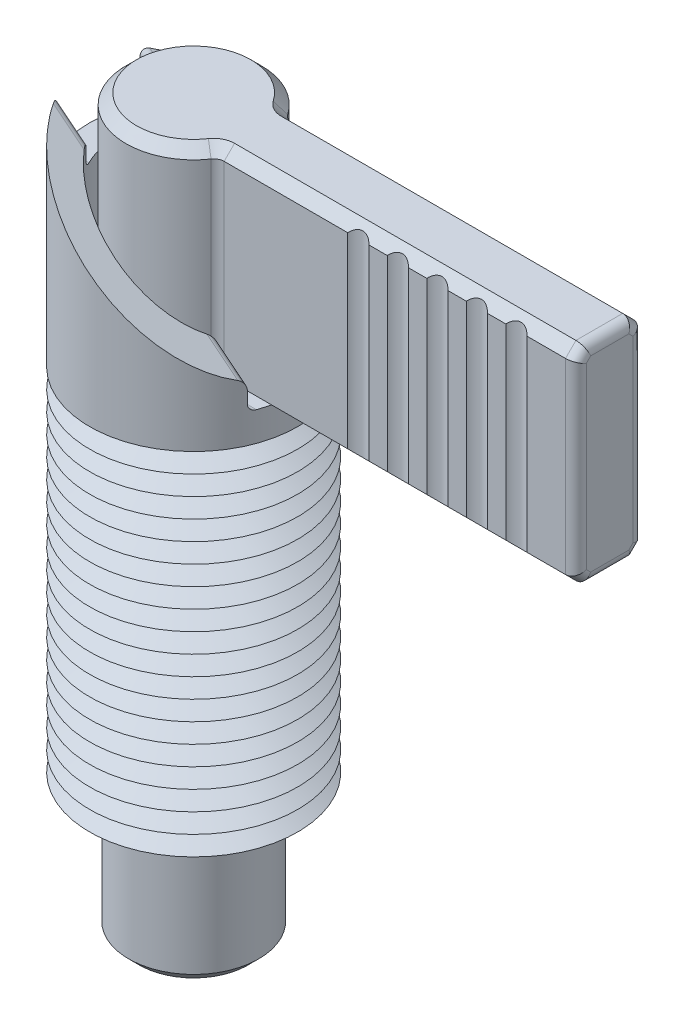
ISO-10303-21;
HEADER;
FILE_DESCRIPTION(('STEP AP214'),'2;1');
FILE_NAME('part.step','',(''),(''),'','','');
FILE_SCHEMA(('AUTOMOTIVE_DESIGN { 1 0 10303 214 1 1 1 1 }'));
ENDSEC;
DATA;
#1=APPLICATION_CONTEXT('core data for automotive mechanical design processes');
#2=APPLICATION_PROTOCOL_DEFINITION('international standard','automotive_design',2000,#1);
#3=PRODUCT_CONTEXT('',#1,'mechanical');
#4=PRODUCT('Part','Part','',(#3));
#5=PRODUCT_RELATED_PRODUCT_CATEGORY('part','',(#4));
#6=PRODUCT_DEFINITION_FORMATION('','',#4);
#7=PRODUCT_DEFINITION_CONTEXT('part definition',#1,'design');
#8=PRODUCT_DEFINITION('design','',#6,#7);
#9=PRODUCT_DEFINITION_SHAPE('','',#8);
#10=(LENGTH_UNIT() NAMED_UNIT(*) SI_UNIT(.MILLI.,.METRE.));
#11=(NAMED_UNIT(*) PLANE_ANGLE_UNIT() SI_UNIT($,.RADIAN.));
#12=(NAMED_UNIT(*) SI_UNIT($,.STERADIAN.) SOLID_ANGLE_UNIT());
#13=UNCERTAINTY_MEASURE_WITH_UNIT(LENGTH_MEASURE(1.E-05),#10,'distance_accuracy_value','');
#14=(GEOMETRIC_REPRESENTATION_CONTEXT(3) GLOBAL_UNCERTAINTY_ASSIGNED_CONTEXT((#13)) GLOBAL_UNIT_ASSIGNED_CONTEXT((#10,
#11,#12)) REPRESENTATION_CONTEXT('',''));
#15=CARTESIAN_POINT('',(0.,0.,0.));
#16=DIRECTION('',(0.,0.,1.));
#17=DIRECTION('',(1.,0.,0.));
#18=AXIS2_PLACEMENT_3D('',#15,#16,#17);
#19=CARTESIAN_POINT('',(4.50333209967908,2.01595551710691,2.6));
#20=DIRECTION('',(0.,0.,1.));
#21=DIRECTION('',(1.,0.,0.));
#22=AXIS2_PLACEMENT_3D('',#19,#20,#21);
#23=PLANE('',#22);
#24=DIRECTION('',(0.,1.,0.));
#25=VECTOR('',#24,1.);
#26=CARTESIAN_POINT('',(16.0792153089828,-9.99999999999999,2.6));
#27=LINE('',#26,#25);
#28=CARTESIAN_POINT('',(16.0792153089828,30.8008,2.6));
#29=VERTEX_POINT('',#28);
#30=CARTESIAN_POINT('',(16.0792153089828,45.1992,2.6));
#31=VERTEX_POINT('',#30);
#32=EDGE_CURVE('P0_E200',#29,#31,#27,.T.);
#33=ORIENTED_EDGE('',*,*,#32,.F.);
#34=DIRECTION('',(1.,0.,0.));
#35=VECTOR('',#34,1.);
#36=CARTESIAN_POINT('',(32.,30.8008,2.6));
#37=LINE('',#36,#35);
#38=CARTESIAN_POINT('',(17.4887846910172,30.8008,2.6));
#39=VERTEX_POINT('',#38);
#40=EDGE_CURVE('P0_E209',#29,#39,#37,.T.);
#41=ORIENTED_EDGE('',*,*,#40,.T.);
#42=DIRECTION('',(0.,1.,0.));
#43=VECTOR('',#42,1.);
#44=CARTESIAN_POINT('',(17.4887846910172,-9.99999999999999,2.6));
#45=LINE('',#44,#43);
#46=CARTESIAN_POINT('',(17.4887846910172,45.1992,2.6));
#47=VERTEX_POINT('',#46);
#48=EDGE_CURVE('P0_E210',#39,#47,#45,.T.);
#49=ORIENTED_EDGE('',*,*,#48,.T.);
#50=DIRECTION('',(-1.,0.,0.));
#51=VECTOR('',#50,1.);
#52=CARTESIAN_POINT('',(4.94410355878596,45.1992,2.6));
#53=LINE('',#52,#51);
#54=EDGE_CURVE('P0_E236',#47,#31,#53,.T.);
#55=ORIENTED_EDGE('',*,*,#54,.T.);
#56=EDGE_LOOP('',(#33,#41,#49,#55));
#57=FACE_BOUND('',#56,.T.);
#58=ADVANCED_FACE('P0_F16',(#57),#23,.T.);
#59=DIRECTION('',(0.,1.,0.));
#60=VECTOR('',#59,1.);
#61=CARTESIAN_POINT('',(19.1192153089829,-9.99999999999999,2.6));
#62=LINE('',#61,#60);
#63=CARTESIAN_POINT('',(19.1192153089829,30.8008,2.6));
#64=VERTEX_POINT('',#63);
#65=CARTESIAN_POINT('',(19.1192153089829,45.1992,2.6));
#66=VERTEX_POINT('',#65);
#67=EDGE_CURVE('P0_E299',#64,#66,#62,.T.);
#68=ORIENTED_EDGE('',*,*,#67,.F.);
#69=CARTESIAN_POINT('',(20.5287846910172,30.8008,2.6));
#70=VERTEX_POINT('',#69);
#71=EDGE_CURVE('P0_E221',#64,#70,#37,.T.);
#72=ORIENTED_EDGE('',*,*,#71,.T.);
#73=DIRECTION('',(0.,1.,0.));
#74=VECTOR('',#73,1.);
#75=CARTESIAN_POINT('',(20.5287846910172,-9.99999999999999,2.6));
#76=LINE('',#75,#74);
#77=CARTESIAN_POINT('',(20.5287846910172,45.1992,2.6));
#78=VERTEX_POINT('',#77);
#79=EDGE_CURVE('P0_E293',#70,#78,#76,.T.);
#80=ORIENTED_EDGE('',*,*,#79,.T.);
#81=EDGE_CURVE('P0_E239',#78,#66,#53,.T.);
#82=ORIENTED_EDGE('',*,*,#81,.T.);
#83=EDGE_LOOP('',(#68,#72,#80,#82));
#84=FACE_BOUND('',#83,.T.);
#85=ADVANCED_FACE('P0_F496',(#84),#23,.T.);
#86=DIRECTION('',(0.,1.,0.));
#87=VECTOR('',#86,1.);
#88=CARTESIAN_POINT('',(22.1592153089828,-9.99999999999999,2.6));
#89=LINE('',#88,#87);
#90=CARTESIAN_POINT('',(22.1592153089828,30.8008,2.6));
#91=VERTEX_POINT('',#90);
#92=CARTESIAN_POINT('',(22.1592153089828,45.1992,2.6));
#93=VERTEX_POINT('',#92);
#94=EDGE_CURVE('P0_E292',#91,#93,#89,.T.);
#95=ORIENTED_EDGE('',*,*,#94,.F.);
#96=CARTESIAN_POINT('',(23.5687846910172,30.8008,2.6));
#97=VERTEX_POINT('',#96);
#98=EDGE_CURVE('P0_E228',#91,#97,#37,.T.);
#99=ORIENTED_EDGE('',*,*,#98,.T.);
#100=DIRECTION('',(0.,1.,0.));
#101=VECTOR('',#100,1.);
#102=CARTESIAN_POINT('',(23.5687846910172,-9.99999999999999,2.6));
#103=LINE('',#102,#101);
#104=CARTESIAN_POINT('',(23.5687846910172,45.1992,2.6));
#105=VERTEX_POINT('',#104);
#106=EDGE_CURVE('P0_E286',#97,#105,#103,.T.);
#107=ORIENTED_EDGE('',*,*,#106,.T.);
#108=EDGE_CURVE('P0_E234',#105,#93,#53,.T.);
#109=ORIENTED_EDGE('',*,*,#108,.T.);
#110=EDGE_LOOP('',(#95,#99,#107,#109));
#111=FACE_BOUND('',#110,.T.);
#112=ADVANCED_FACE('P0_F324',(#111),#23,.T.);
#113=DIRECTION('',(0.,1.,0.));
#114=VECTOR('',#113,1.);
#115=CARTESIAN_POINT('',(25.1992153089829,-9.99999999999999,2.6));
#116=LINE('',#115,#114);
#117=CARTESIAN_POINT('',(25.1992153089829,30.8008,2.6));
#118=VERTEX_POINT('',#117);
#119=CARTESIAN_POINT('',(25.1992153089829,45.1992,2.6));
#120=VERTEX_POINT('',#119);
#121=EDGE_CURVE('P0_E285',#118,#120,#116,.T.);
#122=ORIENTED_EDGE('',*,*,#121,.F.);
#123=CARTESIAN_POINT('',(26.6087846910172,30.8008,2.6));
#124=VERTEX_POINT('',#123);
#125=EDGE_CURVE('P0_E223',#118,#124,#37,.T.);
#126=ORIENTED_EDGE('',*,*,#125,.T.);
#127=DIRECTION('',(0.,1.,0.));
#128=VECTOR('',#127,1.);
#129=CARTESIAN_POINT('',(26.6087846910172,-9.99999999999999,2.6));
#130=LINE('',#129,#128);
#131=CARTESIAN_POINT('',(26.6087846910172,45.1992,2.6));
#132=VERTEX_POINT('',#131);
#133=EDGE_CURVE('P0_E279',#124,#132,#130,.T.);
#134=ORIENTED_EDGE('',*,*,#133,.T.);
#135=EDGE_CURVE('P0_E229',#132,#120,#53,.T.);
#136=ORIENTED_EDGE('',*,*,#135,.T.);
#137=EDGE_LOOP('',(#122,#126,#134,#136));
#138=FACE_BOUND('',#137,.T.);
#139=ADVANCED_FACE('P0_F337',(#138),#23,.T.);
#140=CARTESIAN_POINT('',(28.2392153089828,30.8008,2.6));
#141=VERTEX_POINT('',#140);
#142=CARTESIAN_POINT('',(31.1992,30.8008,2.6));
#143=VERTEX_POINT('',#142);
#144=EDGE_CURVE('P0_E218',#141,#143,#37,.T.);
#145=ORIENTED_EDGE('',*,*,#144,.T.);
#146=DIRECTION('',(0.,1.,0.));
#147=VECTOR('',#146,1.);
#148=CARTESIAN_POINT('',(31.1992,2.01595551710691,2.6));
#149=LINE('',#148,#147);
#150=CARTESIAN_POINT('',(31.1992,45.1992,2.6));
#151=VERTEX_POINT('',#150);
#152=EDGE_CURVE('P0_E11',#143,#151,#149,.T.);
#153=ORIENTED_EDGE('',*,*,#152,.T.);
#154=CARTESIAN_POINT('',(28.2392153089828,45.1992,2.6));
#155=VERTEX_POINT('',#154);
#156=EDGE_CURVE('P0_E224',#151,#155,#53,.T.);
#157=ORIENTED_EDGE('',*,*,#156,.T.);
#158=DIRECTION('',(0.,1.,0.));
#159=VECTOR('',#158,1.);
#160=CARTESIAN_POINT('',(28.2392153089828,-9.99999999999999,2.6));
#161=LINE('',#160,#159);
#162=EDGE_CURVE('P0_E278',#141,#155,#161,.T.);
#163=ORIENTED_EDGE('',*,*,#162,.F.);
#164=EDGE_LOOP('',(#145,#153,#157,#163));
#165=FACE_BOUND('',#164,.T.);
#166=ADVANCED_FACE('P0_F506',(#165),#23,.T.);
#167=CARTESIAN_POINT('',(0.,-9.99999999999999,0.));
#168=DIRECTION('',(0.,1.,0.));
#169=DIRECTION('',(0.,0.,1.));
#170=AXIS2_PLACEMENT_3D('',#167,#168,#169);
#171=PLANE('',#170);
#172=CARTESIAN_POINT('',(0.,-9.99999999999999,0.));
#173=DIRECTION('',(0.,-1.,0.));
#174=DIRECTION('',(0.,0.,-1.));
#175=AXIS2_PLACEMENT_3D('',#172,#173,#174);
#176=CIRCLE('',#175,4.2);
#177=CARTESIAN_POINT('',(0.,-9.99999999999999,-4.2));
#178=VERTEX_POINT('',#177);
#179=EDGE_CURVE('P0_E259',#178,#178,#176,.T.);
#180=ORIENTED_EDGE('',*,*,#179,.T.);
#181=EDGE_LOOP('',(#180));
#182=FACE_BOUND('',#181,.T.);
#183=ADVANCED_FACE('P0_F516',(#182),#171,.F.);
#184=CARTESIAN_POINT('',(0.,-9.2,0.));
#185=DIRECTION('',(0.,1.,0.));
#186=DIRECTION('',(0.,0.,1.));
#187=AXIS2_PLACEMENT_3D('',#184,#185,#186);
#188=CONICAL_SURFACE('',#187,5.,0.785398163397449);
#189=ORIENTED_EDGE('',*,*,#179,.F.);
#190=EDGE_LOOP('',(#189));
#191=FACE_BOUND('',#190,.T.);
#192=CARTESIAN_POINT('',(0.,-9.2,0.));
#193=DIRECTION('',(0.,-1.,0.));
#194=DIRECTION('',(0.,0.,-1.));
#195=AXIS2_PLACEMENT_3D('',#192,#193,#194);
#196=CIRCLE('',#195,5.);
#197=CARTESIAN_POINT('',(0.,-9.2,-5.));
#198=VERTEX_POINT('',#197);
#199=EDGE_CURVE('P0_E262',#198,#198,#196,.T.);
#200=ORIENTED_EDGE('',*,*,#199,.T.);
#201=EDGE_LOOP('',(#200));
#202=FACE_BOUND('',#201,.T.);
#203=ADVANCED_FACE('P0_F521',(#191,#202),#188,.T.);
#204=CARTESIAN_POINT('',(0.,-9.99999999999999,0.));
#205=DIRECTION('',(0.,-1.,0.));
#206=DIRECTION('',(0.,0.,-1.));
#207=AXIS2_PLACEMENT_3D('',#204,#205,#206);
#208=CYLINDRICAL_SURFACE('',#207,5.);
#209=ORIENTED_EDGE('',*,*,#199,.F.);
#210=EDGE_LOOP('',(#209));
#211=FACE_BOUND('',#210,.T.);
#212=CARTESIAN_POINT('',(0.,7.50000000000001,0.));
#213=DIRECTION('',(0.,-1.,0.));
#214=DIRECTION('',(0.,0.,-1.));
#215=AXIS2_PLACEMENT_3D('',#212,#213,#214);
#216=CIRCLE('',#215,5.);
#217=CARTESIAN_POINT('',(0.,7.50000000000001,-5.));
#218=VERTEX_POINT('',#217);
#219=EDGE_CURVE('P0_E265',#218,#218,#216,.T.);
#220=ORIENTED_EDGE('',*,*,#219,.T.);
#221=EDGE_LOOP('',(#220));
#222=FACE_BOUND('',#221,.T.);
#223=ADVANCED_FACE('P0_F555',(#211,#222),#208,.T.);
#224=CARTESIAN_POINT('',(-5.,7.50000000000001,0.));
#225=DIRECTION('',(0.,-1.,0.));
#226=DIRECTION('',(0.,0.,-1.));
#227=AXIS2_PLACEMENT_3D('',#224,#225,#226);
#228=PLANE('',#227);
#229=ORIENTED_EDGE('',*,*,#219,.F.);
#230=EDGE_LOOP('',(#229));
#231=FACE_BOUND('',#230,.T.);
#232=CARTESIAN_POINT('',(0.,7.50000000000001,0.));
#233=DIRECTION('',(0.,-1.,0.));
#234=DIRECTION('',(0.,0.,-1.));
#235=AXIS2_PLACEMENT_3D('',#232,#233,#234);
#236=CIRCLE('',#235,3.75);
#237=CARTESIAN_POINT('',(0.,7.50000000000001,-3.75));
#238=VERTEX_POINT('',#237);
#239=EDGE_CURVE('P0_E268',#238,#238,#236,.T.);
#240=ORIENTED_EDGE('',*,*,#239,.T.);
#241=EDGE_LOOP('',(#240));
#242=FACE_BOUND('',#241,.T.);
#243=ADVANCED_FACE('P0_F563',(#231,#242),#228,.F.);
#244=CARTESIAN_POINT('',(0.,-9.99999999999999,0.));
#245=DIRECTION('',(0.,-1.,0.));
#246=DIRECTION('',(0.,0.,-1.));
#247=AXIS2_PLACEMENT_3D('',#244,#245,#246);
#248=CYLINDRICAL_SURFACE('',#247,3.75);
#249=ORIENTED_EDGE('',*,*,#239,.F.);
#250=EDGE_LOOP('',(#249));
#251=FACE_BOUND('',#250,.T.);
#252=CARTESIAN_POINT('',(0.,30.,0.));
#253=DIRECTION('',(0.,-1.,0.));
#254=DIRECTION('',(0.,0.,-1.));
#255=AXIS2_PLACEMENT_3D('',#252,#253,#254);
#256=CIRCLE('',#255,3.75);
#257=CARTESIAN_POINT('',(0.,30.,-3.75));
#258=VERTEX_POINT('',#257);
#259=EDGE_CURVE('P0_E271',#258,#258,#256,.T.);
#260=ORIENTED_EDGE('',*,*,#259,.T.);
#261=EDGE_LOOP('',(#260));
#262=FACE_BOUND('',#261,.T.);
#263=ADVANCED_FACE('P0_F571',(#251,#262),#248,.T.);
#264=CARTESIAN_POINT('',(-3.75,30.,0.));
#265=DIRECTION('',(0.,1.,0.));
#266=DIRECTION('',(0.,0.,1.));
#267=AXIS2_PLACEMENT_3D('',#264,#265,#266);
#268=PLANE('',#267);
#269=ORIENTED_EDGE('',*,*,#259,.F.);
#270=EDGE_LOOP('',(#269));
#271=FACE_BOUND('',#270,.T.);
#272=DIRECTION('',(1.,0.,0.));
#273=VECTOR('',#272,1.);
#274=CARTESIAN_POINT('',(32.,30.,-1.7992));
#275=LINE('',#274,#273);
#276=CARTESIAN_POINT('',(4.94410355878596,30.,-1.7992));
#277=VERTEX_POINT('',#276);
#278=CARTESIAN_POINT('',(31.1992,30.,-1.7992));
#279=VERTEX_POINT('',#278);
#280=EDGE_CURVE('P0_E247',#277,#279,#275,.T.);
#281=ORIENTED_EDGE('',*,*,#280,.T.);
#282=DIRECTION('',(0.,0.,1.));
#283=VECTOR('',#282,1.);
#284=CARTESIAN_POINT('',(31.1992,30.,1.79920000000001));
#285=LINE('',#284,#283);
#286=CARTESIAN_POINT('',(31.1992,30.,1.7992));
#287=VERTEX_POINT('',#286);
#288=EDGE_CURVE('P0_E40',#279,#287,#285,.T.);
#289=ORIENTED_EDGE('',*,*,#288,.T.);
#290=DIRECTION('',(-1.,0.,0.));
#291=VECTOR('',#290,1.);
#292=CARTESIAN_POINT('',(4.94410355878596,30.,1.7992));
#293=LINE('',#292,#291);
#294=CARTESIAN_POINT('',(4.94410355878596,30.,1.7992));
#295=VERTEX_POINT('',#294);
#296=EDGE_CURVE('P0_E237',#287,#295,#293,.T.);
#297=ORIENTED_EDGE('',*,*,#296,.T.);
#298=CARTESIAN_POINT('',(4.94410355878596,30.,3.4008));
#299=DIRECTION('',(0.,1.,0.));
#300=DIRECTION('',(0.,0.,1.));
#301=AXIS2_PLACEMENT_3D('',#298,#299,#300);
#302=CIRCLE('',#301,1.6016);
#303=CARTESIAN_POINT('',(3.62453345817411,30.,2.49313414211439));
#304=VERTEX_POINT('',#303);
#305=EDGE_CURVE('P0_E240',#295,#304,#302,.T.);
#306=ORIENTED_EDGE('',*,*,#305,.T.);
#307=CARTESIAN_POINT('',(0.,30.,0.));
#308=DIRECTION('',(0.,1.,0.));
#309=DIRECTION('',(0.,0.,1.));
#310=AXIS2_PLACEMENT_3D('',#307,#308,#309);
#311=CIRCLE('',#310,4.3992);
#312=CARTESIAN_POINT('',(3.62453345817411,30.,-2.49313414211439));
#313=VERTEX_POINT('',#312);
#314=EDGE_CURVE('P0_E241',#304,#313,#311,.F.);
#315=ORIENTED_EDGE('',*,*,#314,.T.);
#316=CARTESIAN_POINT('',(4.94410355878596,30.,-3.4008));
#317=DIRECTION('',(0.,1.,0.));
#318=DIRECTION('',(0.,0.,1.));
#319=AXIS2_PLACEMENT_3D('',#316,#317,#318);
#320=CIRCLE('',#319,1.6016);
#321=EDGE_CURVE('P0_E245',#313,#277,#320,.T.);
#322=ORIENTED_EDGE('',*,*,#321,.T.);
#323=EDGE_LOOP('',(#281,#289,#297,#306,#315,#322));
#324=FACE_BOUND('',#323,.T.);
#325=ADVANCED_FACE('P0_F422',(#271,#324),#268,.F.);
#326=CARTESIAN_POINT('',(0.,-9.99999999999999,0.));
#327=DIRECTION('',(0.,-1.,0.));
#328=DIRECTION('',(0.,0.,-1.));
#329=AXIS2_PLACEMENT_3D('',#326,#327,#328);
#330=CYLINDRICAL_SURFACE('',#329,5.2);
#331=DIRECTION('',(0.,-1.,0.));
#332=VECTOR('',#331,1.);
#333=CARTESIAN_POINT('',(4.28431850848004,-9.99999999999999,-2.94696707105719));
#334=LINE('',#333,#332);
#335=CARTESIAN_POINT('',(4.28431850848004,45.1992,-2.94696707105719));
#336=VERTEX_POINT('',#335);
#337=CARTESIAN_POINT('',(4.28431850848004,30.8008,-2.94696707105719));
#338=VERTEX_POINT('',#337);
#339=EDGE_CURVE('P0_E250',#336,#338,#334,.T.);
#340=ORIENTED_EDGE('',*,*,#339,.T.);
#341=CARTESIAN_POINT('',(0.,30.8008,0.));
#342=DIRECTION('',(0.,1.,0.));
#343=DIRECTION('',(0.,0.,1.));
#344=AXIS2_PLACEMENT_3D('',#341,#342,#343);
#345=CIRCLE('',#344,5.2);
#346=CARTESIAN_POINT('',(4.28431850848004,30.8008,2.94696707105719));
#347=VERTEX_POINT('',#346);
#348=EDGE_CURVE('P0_E436',#338,#347,#345,.T.);
#349=ORIENTED_EDGE('',*,*,#348,.T.);
#350=DIRECTION('',(0.,-1.,0.));
#351=VECTOR('',#350,1.);
#352=CARTESIAN_POINT('',(4.28431850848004,-9.99999999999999,2.94696707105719));
#353=LINE('',#352,#351);
#354=CARTESIAN_POINT('',(4.28431850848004,45.1992,2.94696707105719));
#355=VERTEX_POINT('',#354);
#356=EDGE_CURVE('P0_E253',#347,#355,#353,.F.);
#357=ORIENTED_EDGE('',*,*,#356,.T.);
#358=CARTESIAN_POINT('',(0.,45.1992,0.));
#359=DIRECTION('',(0.,-1.,0.));
#360=DIRECTION('',(0.,0.,-1.));
#361=AXIS2_PLACEMENT_3D('',#358,#359,#360);
#362=CIRCLE('',#361,5.2);
#363=EDGE_CURVE('P0_E476',#355,#336,#362,.T.);
#364=ORIENTED_EDGE('',*,*,#363,.T.);
#365=EDGE_LOOP('',(#340,#349,#357,#364));
#366=FACE_BOUND('',#365,.T.);
#367=ADVANCED_FACE('P0_F586',(#366),#330,.T.);
#368=CARTESIAN_POINT('',(-5.2,46.,0.));
#369=DIRECTION('',(0.,-1.,0.));
#370=DIRECTION('',(0.,0.,-1.));
#371=AXIS2_PLACEMENT_3D('',#368,#369,#370);
#372=PLANE('',#371);
#373=DIRECTION('',(1.,0.,0.));
#374=VECTOR('',#373,1.);
#375=CARTESIAN_POINT('',(32.,46.,1.7992));
#376=LINE('',#375,#374);
#377=CARTESIAN_POINT('',(4.94410355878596,46.,1.7992));
#378=VERTEX_POINT('',#377);
#379=CARTESIAN_POINT('',(31.1992,46.,1.7992));
#380=VERTEX_POINT('',#379);
#381=EDGE_CURVE('P0_E343',#378,#380,#376,.T.);
#382=ORIENTED_EDGE('',*,*,#381,.T.);
#383=DIRECTION('',(0.,0.,-1.));
#384=VECTOR('',#383,1.);
#385=CARTESIAN_POINT('',(31.1992,46.,-1.79919999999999));
#386=LINE('',#385,#384);
#387=CARTESIAN_POINT('',(31.1992,46.,-1.7992));
#388=VERTEX_POINT('',#387);
#389=EDGE_CURVE('P0_E375',#380,#388,#386,.T.);
#390=ORIENTED_EDGE('',*,*,#389,.T.);
#391=DIRECTION('',(-1.,0.,0.));
#392=VECTOR('',#391,1.);
#393=CARTESIAN_POINT('',(4.94410355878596,46.,-1.7992));
#394=LINE('',#393,#392);
#395=CARTESIAN_POINT('',(4.94410355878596,46.,-1.7992));
#396=VERTEX_POINT('',#395);
#397=EDGE_CURVE('P0_E465',#388,#396,#394,.T.);
#398=ORIENTED_EDGE('',*,*,#397,.T.);
#399=CARTESIAN_POINT('',(4.94410355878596,46.,-3.4008));
#400=DIRECTION('',(0.,-1.,0.));
#401=DIRECTION('',(0.,0.,-1.));
#402=AXIS2_PLACEMENT_3D('',#399,#400,#401);
#403=CIRCLE('',#402,1.6016);
#404=CARTESIAN_POINT('',(3.62453345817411,46.,-2.49313414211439));
#405=VERTEX_POINT('',#404);
#406=EDGE_CURVE('P0_E463',#396,#405,#403,.T.);
#407=ORIENTED_EDGE('',*,*,#406,.T.);
#408=CARTESIAN_POINT('',(0.,46.,0.));
#409=DIRECTION('',(0.,-1.,0.));
#410=DIRECTION('',(0.,0.,-1.));
#411=AXIS2_PLACEMENT_3D('',#408,#409,#410);
#412=CIRCLE('',#411,4.3992);
#413=CARTESIAN_POINT('',(3.62453345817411,46.,2.49313414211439));
#414=VERTEX_POINT('',#413);
#415=EDGE_CURVE('P0_E461',#405,#414,#412,.F.);
#416=ORIENTED_EDGE('',*,*,#415,.T.);
#417=CARTESIAN_POINT('',(4.94410355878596,46.,3.4008));
#418=DIRECTION('',(0.,-1.,0.));
#419=DIRECTION('',(0.,0.,-1.));
#420=AXIS2_PLACEMENT_3D('',#417,#418,#419);
#421=CIRCLE('',#420,1.6016);
#422=EDGE_CURVE('P0_E348',#414,#378,#421,.T.);
#423=ORIENTED_EDGE('',*,*,#422,.T.);
#424=EDGE_LOOP('',(#382,#390,#398,#407,#416,#423));
#425=FACE_BOUND('',#424,.T.);
#426=ADVANCED_FACE('P0_F594',(#425),#372,.F.);
#427=CARTESIAN_POINT('',(4.50333209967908,2.01595551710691,-2.6));
#428=DIRECTION('',(0.,0.,-1.));
#429=DIRECTION('',(-1.,0.,0.));
#430=AXIS2_PLACEMENT_3D('',#427,#428,#429);
#431=PLANE('',#430);
#432=DIRECTION('',(1.,0.,0.));
#433=VECTOR('',#432,1.);
#434=CARTESIAN_POINT('',(32.,45.1992,-2.6));
#435=LINE('',#434,#433);
#436=CARTESIAN_POINT('',(4.94410355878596,45.1992,-2.6));
#437=VERTEX_POINT('',#436);
#438=CARTESIAN_POINT('',(31.1992,45.1992,-2.6));
#439=VERTEX_POINT('',#438);
#440=EDGE_CURVE('P0_E468',#437,#439,#435,.T.);
#441=ORIENTED_EDGE('',*,*,#440,.T.);
#442=DIRECTION('',(0.,1.,0.));
#443=VECTOR('',#442,1.);
#444=CARTESIAN_POINT('',(31.1992,2.01595551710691,-2.6));
#445=LINE('',#444,#443);
#446=CARTESIAN_POINT('',(31.1992,30.8008,-2.6));
#447=VERTEX_POINT('',#446);
#448=EDGE_CURVE('P0_E379',#439,#447,#445,.F.);
#449=ORIENTED_EDGE('',*,*,#448,.T.);
#450=DIRECTION('',(-1.,0.,0.));
#451=VECTOR('',#450,1.);
#452=CARTESIAN_POINT('',(4.94410355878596,30.8008,-2.6));
#453=LINE('',#452,#451);
#454=CARTESIAN_POINT('',(4.94410355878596,30.8008,-2.6));
#455=VERTEX_POINT('',#454);
#456=EDGE_CURVE('P0_E421',#447,#455,#453,.T.);
#457=ORIENTED_EDGE('',*,*,#456,.T.);
#458=DIRECTION('',(0.,-1.,0.));
#459=VECTOR('',#458,1.);
#460=CARTESIAN_POINT('',(4.94410355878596,2.01595551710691,-2.6));
#461=LINE('',#460,#459);
#462=EDGE_CURVE('P0_E256',#455,#437,#461,.F.);
#463=ORIENTED_EDGE('',*,*,#462,.T.);
#464=EDGE_LOOP('',(#441,#449,#457,#463));
#465=FACE_BOUND('',#464,.T.);
#466=ADVANCED_FACE('P0_F513',(#465),#431,.T.);
#467=CARTESIAN_POINT('',(32.,2.01595551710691,2.6));
#468=DIRECTION('',(1.,0.,0.));
#469=DIRECTION('',(0.,0.,-1.));
#470=AXIS2_PLACEMENT_3D('',#467,#468,#469);
#471=PLANE('',#470);
#472=DIRECTION('',(0.,0.,-1.));
#473=VECTOR('',#472,1.);
#474=CARTESIAN_POINT('',(32.,45.1992,1.7992));
#475=LINE('',#474,#473);
#476=CARTESIAN_POINT('',(32.,45.1992,-1.46749777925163));
#477=VERTEX_POINT('',#476);
#478=CARTESIAN_POINT('',(32.,45.1992,1.46749777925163));
#479=VERTEX_POINT('',#478);
#480=EDGE_CURVE('P0_E367',#477,#479,#475,.F.);
#481=ORIENTED_EDGE('',*,*,#480,.T.);
#482=DIRECTION('',(0.,-0.707106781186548,0.707106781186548));
#483=VECTOR('',#482,1.);
#484=CARTESIAN_POINT('',(32.,23.0413266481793,23.6253711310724));
#485=LINE('',#484,#483);
#486=CARTESIAN_POINT('',(32.,44.8674977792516,1.7992));
#487=VERTEX_POINT('',#486);
#488=EDGE_CURVE('P0_E369',#479,#487,#485,.T.);
#489=ORIENTED_EDGE('',*,*,#488,.T.);
#490=DIRECTION('',(0.,1.,0.));
#491=VECTOR('',#490,1.);
#492=CARTESIAN_POINT('',(32.,2.01595551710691,1.7992));
#493=LINE('',#492,#491);
#494=CARTESIAN_POINT('',(32.,31.1325022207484,1.7992));
#495=VERTEX_POINT('',#494);
#496=EDGE_CURVE('P0_E309',#487,#495,#493,.F.);
#497=ORIENTED_EDGE('',*,*,#496,.T.);
#498=DIRECTION('',(0.,-0.707106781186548,-0.707106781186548));
#499=VECTOR('',#498,1.);
#500=CARTESIAN_POINT('',(32.,16.9746288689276,-12.3586733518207));
#501=LINE('',#500,#499);
#502=CARTESIAN_POINT('',(32.,30.8008,1.46749777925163));
#503=VERTEX_POINT('',#502);
#504=EDGE_CURVE('P0_E357',#495,#503,#501,.T.);
#505=ORIENTED_EDGE('',*,*,#504,.T.);
#506=DIRECTION('',(0.,0.,1.));
#507=VECTOR('',#506,1.);
#508=CARTESIAN_POINT('',(32.,30.8008,-1.7992));
#509=LINE('',#508,#507);
#510=CARTESIAN_POINT('',(32.,30.8008,-1.46749777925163));
#511=VERTEX_POINT('',#510);
#512=EDGE_CURVE('P0_E359',#503,#511,#509,.F.);
#513=ORIENTED_EDGE('',*,*,#512,.T.);
#514=DIRECTION('',(0.,0.707106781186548,-0.707106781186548));
#515=VECTOR('',#514,1.);
#516=CARTESIAN_POINT('',(32.,14.3746288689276,14.9586733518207));
#517=LINE('',#516,#515);
#518=CARTESIAN_POINT('',(32.,31.1325022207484,-1.7992));
#519=VERTEX_POINT('',#518);
#520=EDGE_CURVE('P0_E361',#511,#519,#517,.T.);
#521=ORIENTED_EDGE('',*,*,#520,.T.);
#522=DIRECTION('',(0.,1.,0.));
#523=VECTOR('',#522,1.);
#524=CARTESIAN_POINT('',(32.,2.01595551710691,-1.7992));
#525=LINE('',#524,#523);
#526=CARTESIAN_POINT('',(32.,44.8674977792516,-1.7992));
#527=VERTEX_POINT('',#526);
#528=EDGE_CURVE('P0_E363',#519,#527,#525,.T.);
#529=ORIENTED_EDGE('',*,*,#528,.T.);
#530=DIRECTION('',(0.,0.707106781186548,0.707106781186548));
#531=VECTOR('',#530,1.);
#532=CARTESIAN_POINT('',(32.,25.6413266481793,-21.0253711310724));
#533=LINE('',#532,#531);
#534=EDGE_CURVE('P0_E365',#527,#477,#533,.T.);
#535=ORIENTED_EDGE('',*,*,#534,.T.);
#536=EDGE_LOOP('',(#481,#489,#497,#505,#513,#521,#529,#535));
#537=FACE_BOUND('',#536,.T.);
#538=ADVANCED_FACE('P0_F505',(#537),#471,.T.);
#539=DIRECTION('',(0.,1.,0.));
#540=VECTOR('',#539,1.);
#541=CARTESIAN_POINT('',(14.4487846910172,-9.99999999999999,2.6));
#542=LINE('',#541,#540);
#543=CARTESIAN_POINT('',(14.4487846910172,30.8008,2.6));
#544=VERTEX_POINT('',#543);
#545=CARTESIAN_POINT('',(14.4487846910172,45.1992,2.6));
#546=VERTEX_POINT('',#545);
#547=EDGE_CURVE('P0_E190',#544,#546,#542,.T.);
#548=ORIENTED_EDGE('',*,*,#547,.T.);
#549=CARTESIAN_POINT('',(4.94410355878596,45.1992,2.6));
#550=VERTEX_POINT('',#549);
#551=EDGE_CURVE('P0_E230',#546,#550,#53,.T.);
#552=ORIENTED_EDGE('',*,*,#551,.T.);
#553=DIRECTION('',(0.,-1.,0.));
#554=VECTOR('',#553,1.);
#555=CARTESIAN_POINT('',(4.94410355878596,2.01595551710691,2.6));
#556=LINE('',#555,#554);
#557=CARTESIAN_POINT('',(4.94410355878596,30.8008,2.6));
#558=VERTEX_POINT('',#557);
#559=EDGE_CURVE('P0_E215',#550,#558,#556,.T.);
#560=ORIENTED_EDGE('',*,*,#559,.T.);
#561=EDGE_CURVE('P0_E206',#558,#544,#37,.T.);
#562=ORIENTED_EDGE('',*,*,#561,.T.);
#563=EDGE_LOOP('',(#548,#552,#560,#562));
#564=FACE_BOUND('',#563,.T.);
#565=ADVANCED_FACE('P0_F213',(#564),#23,.T.);
#566=CARTESIAN_POINT('',(4.94410355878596,-9.99999999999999,-3.4008));
#567=DIRECTION('',(0.,-1.,0.));
#568=DIRECTION('',(0.,0.,-1.));
#569=AXIS2_PLACEMENT_3D('',#566,#567,#568);
#570=CYLINDRICAL_SURFACE('',#569,0.8008);
#571=ORIENTED_EDGE('',*,*,#462,.F.);
#572=CARTESIAN_POINT('',(4.94410355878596,30.8008,-3.4008));
#573=DIRECTION('',(0.,1.,0.));
#574=DIRECTION('',(0.,0.,1.));
#575=AXIS2_PLACEMENT_3D('',#572,#573,#574);
#576=CIRCLE('',#575,0.8008);
#577=EDGE_CURVE('P0_E471',#455,#338,#576,.F.);
#578=ORIENTED_EDGE('',*,*,#577,.T.);
#579=ORIENTED_EDGE('',*,*,#339,.F.);
#580=CARTESIAN_POINT('',(4.94410355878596,45.1992,-3.4008));
#581=DIRECTION('',(0.,-1.,0.));
#582=DIRECTION('',(0.,0.,-1.));
#583=AXIS2_PLACEMENT_3D('',#580,#581,#582);
#584=CIRCLE('',#583,0.8008);
#585=EDGE_CURVE('P0_E473',#336,#437,#584,.F.);
#586=ORIENTED_EDGE('',*,*,#585,.T.);
#587=EDGE_LOOP('',(#571,#578,#579,#586));
#588=FACE_BOUND('',#587,.T.);
#589=ADVANCED_FACE('P0_F504',(#588),#570,.F.);
#590=CARTESIAN_POINT('',(4.94410355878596,-9.99999999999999,3.4008));
#591=DIRECTION('',(0.,-1.,0.));
#592=DIRECTION('',(0.,0.,-1.));
#593=AXIS2_PLACEMENT_3D('',#590,#591,#592);
#594=CYLINDRICAL_SURFACE('',#593,0.8008);
#595=ORIENTED_EDGE('',*,*,#356,.F.);
#596=CARTESIAN_POINT('',(4.94410355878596,30.8008,3.4008));
#597=DIRECTION('',(0.,1.,0.));
#598=DIRECTION('',(0.,0.,1.));
#599=AXIS2_PLACEMENT_3D('',#596,#597,#598);
#600=CIRCLE('',#599,0.8008);
#601=EDGE_CURVE('P0_E219',#347,#558,#600,.F.);
#602=ORIENTED_EDGE('',*,*,#601,.T.);
#603=ORIENTED_EDGE('',*,*,#559,.F.);
#604=CARTESIAN_POINT('',(4.94410355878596,45.1992,3.4008));
#605=DIRECTION('',(0.,-1.,0.));
#606=DIRECTION('',(0.,0.,-1.));
#607=AXIS2_PLACEMENT_3D('',#604,#605,#606);
#608=CIRCLE('',#607,0.8008);
#609=EDGE_CURVE('P0_E216',#550,#355,#608,.F.);
#610=ORIENTED_EDGE('',*,*,#609,.T.);
#611=EDGE_LOOP('',(#595,#602,#603,#610));
#612=FACE_BOUND('',#611,.T.);
#613=ADVANCED_FACE('P0_F481',(#612),#594,.F.);
#614=CARTESIAN_POINT('',(-3.75,30.,-1.7992));
#615=DIRECTION('',(0.,-0.707106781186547,-0.707106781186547));
#616=DIRECTION('',(0.,0.707106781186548,-0.707106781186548));
#617=AXIS2_PLACEMENT_3D('',#614,#615,#616);
#618=PLANE('',#617);
#619=ORIENTED_EDGE('',*,*,#456,.F.);
#620=DIRECTION('',(0.,0.707106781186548,-0.707106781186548));
#621=VECTOR('',#620,1.);
#622=CARTESIAN_POINT('',(31.1992,30.,-1.7992));
#623=LINE('',#622,#621);
#624=EDGE_CURVE('P0_E381',#447,#279,#623,.F.);
#625=ORIENTED_EDGE('',*,*,#624,.T.);
#626=ORIENTED_EDGE('',*,*,#280,.F.);
#627=DIRECTION('',(0.,-0.707106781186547,0.707106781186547));
#628=VECTOR('',#627,1.);
#629=CARTESIAN_POINT('',(4.94410355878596,30.8008,-2.6));
#630=LINE('',#629,#628);
#631=EDGE_CURVE('P0_E274',#455,#277,#630,.T.);
#632=ORIENTED_EDGE('',*,*,#631,.F.);
#633=EDGE_LOOP('',(#619,#625,#626,#632));
#634=FACE_BOUND('',#633,.T.);
#635=ADVANCED_FACE('P0_F418',(#634),#618,.T.);
#636=CARTESIAN_POINT('',(4.94410355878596,30.,-3.4008));
#637=DIRECTION('',(0.,-1.,0.));
#638=DIRECTION('',(0.,0.,-1.));
#639=AXIS2_PLACEMENT_3D('',#636,#637,#638);
#640=CONICAL_SURFACE('',#639,1.6016,0.785398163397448);
#641=ORIENTED_EDGE('',*,*,#631,.T.);
#642=ORIENTED_EDGE('',*,*,#321,.F.);
#643=DIRECTION('',(-0.582590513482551,-0.707106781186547,0.400734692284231));
#644=VECTOR('',#643,1.);
#645=CARTESIAN_POINT('',(4.28431850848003,30.8008,-2.94696707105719));
#646=LINE('',#645,#644);
#647=EDGE_CURVE('P0_E430',#338,#313,#646,.T.);
#648=ORIENTED_EDGE('',*,*,#647,.F.);
#649=ORIENTED_EDGE('',*,*,#577,.F.);
#650=EDGE_LOOP('',(#641,#642,#648,#649));
#651=FACE_BOUND('',#650,.T.);
#652=ADVANCED_FACE('P0_F428',(#651),#640,.F.);
#653=CARTESIAN_POINT('',(0.,30.,0.));
#654=DIRECTION('',(0.,1.,0.));
#655=DIRECTION('',(0.,0.,1.));
#656=AXIS2_PLACEMENT_3D('',#653,#654,#655);
#657=CONICAL_SURFACE('',#656,4.3992,0.785398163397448);
#658=ORIENTED_EDGE('',*,*,#647,.T.);
#659=ORIENTED_EDGE('',*,*,#314,.F.);
#660=DIRECTION('',(-0.582590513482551,-0.707106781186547,-0.400734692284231));
#661=VECTOR('',#660,1.);
#662=CARTESIAN_POINT('',(4.28431850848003,30.8008,2.94696707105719));
#663=LINE('',#662,#661);
#664=EDGE_CURVE('P0_E437',#347,#304,#663,.T.);
#665=ORIENTED_EDGE('',*,*,#664,.F.);
#666=ORIENTED_EDGE('',*,*,#348,.F.);
#667=EDGE_LOOP('',(#658,#659,#665,#666));
#668=FACE_BOUND('',#667,.T.);
#669=ADVANCED_FACE('P0_F433',(#668),#657,.T.);
#670=CARTESIAN_POINT('',(4.94410355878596,30.,3.4008));
#671=DIRECTION('',(0.,-1.,0.));
#672=DIRECTION('',(0.,0.,-1.));
#673=AXIS2_PLACEMENT_3D('',#670,#671,#672);
#674=CONICAL_SURFACE('',#673,1.6016,0.785398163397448);
#675=ORIENTED_EDGE('',*,*,#664,.T.);
#676=ORIENTED_EDGE('',*,*,#305,.F.);
#677=DIRECTION('',(0.,-0.707106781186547,-0.707106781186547));
#678=VECTOR('',#677,1.);
#679=CARTESIAN_POINT('',(4.94410355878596,30.8008,2.6));
#680=LINE('',#679,#678);
#681=EDGE_CURVE('P0_E440',#558,#295,#680,.T.);
#682=ORIENTED_EDGE('',*,*,#681,.F.);
#683=ORIENTED_EDGE('',*,*,#601,.F.);
#684=EDGE_LOOP('',(#675,#676,#682,#683));
#685=FACE_BOUND('',#684,.T.);
#686=ADVANCED_FACE('P0_F484',(#685),#674,.F.);
#687=CARTESIAN_POINT('',(-3.75,30.,1.7992));
#688=DIRECTION('',(0.,-0.707106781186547,0.707106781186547));
#689=DIRECTION('',(0.,-0.707106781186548,-0.707106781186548));
#690=AXIS2_PLACEMENT_3D('',#687,#688,#689);
#691=PLANE('',#690);
#692=ORIENTED_EDGE('',*,*,#296,.F.);
#693=DIRECTION('',(0.,-0.707106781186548,-0.707106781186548));
#694=VECTOR('',#693,1.);
#695=CARTESIAN_POINT('',(31.1992,30.,1.7992));
#696=LINE('',#695,#694);
#697=EDGE_CURVE('P0_E25',#287,#143,#696,.F.);
#698=ORIENTED_EDGE('',*,*,#697,.T.);
#699=ORIENTED_EDGE('',*,*,#144,.F.);
#700=CARTESIAN_POINT('',(27.424,31.5688,3.368));
#701=DIRECTION('',(0.,-0.707106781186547,0.707106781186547));
#702=DIRECTION('',(0.,0.707106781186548,0.707106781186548));
#703=AXIS2_PLACEMENT_3D('',#700,#701,#702);
#704=ELLIPSE('',#703,1.58391918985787,1.12);
#705=EDGE_CURVE('P0_E275',#124,#141,#704,.T.);
#706=ORIENTED_EDGE('',*,*,#705,.F.);
#707=ORIENTED_EDGE('',*,*,#125,.F.);
#708=CARTESIAN_POINT('',(24.384,31.5688,3.368));
#709=DIRECTION('',(0.,-0.707106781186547,0.707106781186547));
#710=DIRECTION('',(0.,0.707106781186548,0.707106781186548));
#711=AXIS2_PLACEMENT_3D('',#708,#709,#710);
#712=ELLIPSE('',#711,1.58391918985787,1.12);
#713=EDGE_CURVE('P0_E282',#97,#118,#712,.T.);
#714=ORIENTED_EDGE('',*,*,#713,.F.);
#715=ORIENTED_EDGE('',*,*,#98,.F.);
#716=CARTESIAN_POINT('',(21.344,31.5688,3.368));
#717=DIRECTION('',(0.,-0.707106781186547,0.707106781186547));
#718=DIRECTION('',(0.,0.707106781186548,0.707106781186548));
#719=AXIS2_PLACEMENT_3D('',#716,#717,#718);
#720=ELLIPSE('',#719,1.58391918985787,1.12);
#721=EDGE_CURVE('P0_E289',#70,#91,#720,.T.);
#722=ORIENTED_EDGE('',*,*,#721,.F.);
#723=ORIENTED_EDGE('',*,*,#71,.F.);
#724=CARTESIAN_POINT('',(18.304,31.5688,3.368));
#725=DIRECTION('',(0.,-0.707106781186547,0.707106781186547));
#726=DIRECTION('',(0.,0.707106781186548,0.707106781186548));
#727=AXIS2_PLACEMENT_3D('',#724,#725,#726);
#728=ELLIPSE('',#727,1.58391918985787,1.12);
#729=EDGE_CURVE('P0_E296',#39,#64,#728,.T.);
#730=ORIENTED_EDGE('',*,*,#729,.F.);
#731=ORIENTED_EDGE('',*,*,#40,.F.);
#732=CARTESIAN_POINT('',(15.264,31.5688,3.368));
#733=DIRECTION('',(0.,-0.707106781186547,0.707106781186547));
#734=DIRECTION('',(0.,0.707106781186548,0.707106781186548));
#735=AXIS2_PLACEMENT_3D('',#732,#733,#734);
#736=ELLIPSE('',#735,1.58391918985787,1.12);
#737=EDGE_CURVE('P0_E193',#544,#29,#736,.T.);
#738=ORIENTED_EDGE('',*,*,#737,.F.);
#739=ORIENTED_EDGE('',*,*,#561,.F.);
#740=ORIENTED_EDGE('',*,*,#681,.T.);
#741=EDGE_LOOP('',(#692,#698,#699,#706,#707,#714,#715,#722,#723,#730,#731,#738,#739,#740));
#742=FACE_BOUND('',#741,.T.);
#743=ADVANCED_FACE('P0_F204',(#742),#691,.T.);
#744=CARTESIAN_POINT('',(-5.2,46.,-1.7992));
#745=DIRECTION('',(0.,0.707106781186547,-0.707106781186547));
#746=DIRECTION('',(0.,0.707106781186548,0.707106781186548));
#747=AXIS2_PLACEMENT_3D('',#744,#745,#746);
#748=PLANE('',#747);
#749=ORIENTED_EDGE('',*,*,#397,.F.);
#750=DIRECTION('',(0.,0.707106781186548,0.707106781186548));
#751=VECTOR('',#750,1.);
#752=CARTESIAN_POINT('',(31.1992,46.,-1.7992));
#753=LINE('',#752,#751);
#754=EDGE_CURVE('P0_E377',#388,#439,#753,.F.);
#755=ORIENTED_EDGE('',*,*,#754,.T.);
#756=ORIENTED_EDGE('',*,*,#440,.F.);
#757=DIRECTION('',(0.,-0.707106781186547,-0.707106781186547));
#758=VECTOR('',#757,1.);
#759=CARTESIAN_POINT('',(4.94410355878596,46.,-1.7992));
#760=LINE('',#759,#758);
#761=EDGE_CURVE('P0_E351',#396,#437,#760,.T.);
#762=ORIENTED_EDGE('',*,*,#761,.F.);
#763=EDGE_LOOP('',(#749,#755,#756,#762));
#764=FACE_BOUND('',#763,.T.);
#765=ADVANCED_FACE('P0_F492',(#764),#748,.T.);
#766=CARTESIAN_POINT('',(4.94410355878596,46.,-3.4008));
#767=DIRECTION('',(0.,1.,0.));
#768=DIRECTION('',(0.,0.,1.));
#769=AXIS2_PLACEMENT_3D('',#766,#767,#768);
#770=CONICAL_SURFACE('',#769,1.6016,0.785398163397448);
#771=ORIENTED_EDGE('',*,*,#761,.T.);
#772=ORIENTED_EDGE('',*,*,#585,.F.);
#773=DIRECTION('',(0.582590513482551,-0.707106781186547,-0.400734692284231));
#774=VECTOR('',#773,1.);
#775=CARTESIAN_POINT('',(3.62453345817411,46.,-2.49313414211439));
#776=LINE('',#775,#774);
#777=EDGE_CURVE('P0_E447',#405,#336,#776,.T.);
#778=ORIENTED_EDGE('',*,*,#777,.F.);
#779=ORIENTED_EDGE('',*,*,#406,.F.);
#780=EDGE_LOOP('',(#771,#772,#778,#779));
#781=FACE_BOUND('',#780,.T.);
#782=ADVANCED_FACE('P0_F653',(#781),#770,.F.);
#783=CARTESIAN_POINT('',(0.,45.1992,0.));
#784=DIRECTION('',(0.,-1.,0.));
#785=DIRECTION('',(0.,0.,-1.));
#786=AXIS2_PLACEMENT_3D('',#783,#784,#785);
#787=CONICAL_SURFACE('',#786,5.2,0.785398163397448);
#788=ORIENTED_EDGE('',*,*,#777,.T.);
#789=ORIENTED_EDGE('',*,*,#363,.F.);
#790=DIRECTION('',(0.582590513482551,-0.707106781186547,0.400734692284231));
#791=VECTOR('',#790,1.);
#792=CARTESIAN_POINT('',(3.62453345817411,46.,2.49313414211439));
#793=LINE('',#792,#791);
#794=EDGE_CURVE('P0_E445',#414,#355,#793,.T.);
#795=ORIENTED_EDGE('',*,*,#794,.F.);
#796=ORIENTED_EDGE('',*,*,#415,.F.);
#797=EDGE_LOOP('',(#788,#789,#795,#796));
#798=FACE_BOUND('',#797,.T.);
#799=ADVANCED_FACE('P0_F661',(#798),#787,.T.);
#800=CARTESIAN_POINT('',(4.94410355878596,46.,3.4008));
#801=DIRECTION('',(0.,1.,0.));
#802=DIRECTION('',(0.,0.,1.));
#803=AXIS2_PLACEMENT_3D('',#800,#801,#802);
#804=CONICAL_SURFACE('',#803,1.6016,0.785398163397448);
#805=ORIENTED_EDGE('',*,*,#794,.T.);
#806=ORIENTED_EDGE('',*,*,#609,.F.);
#807=DIRECTION('',(0.,-0.707106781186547,0.707106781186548));
#808=VECTOR('',#807,1.);
#809=CARTESIAN_POINT('',(4.94410355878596,46.,1.7992));
#810=LINE('',#809,#808);
#811=EDGE_CURVE('P0_E277',#378,#550,#810,.T.);
#812=ORIENTED_EDGE('',*,*,#811,.F.);
#813=ORIENTED_EDGE('',*,*,#422,.F.);
#814=EDGE_LOOP('',(#805,#806,#812,#813));
#815=FACE_BOUND('',#814,.T.);
#816=ADVANCED_FACE('P0_F668',(#815),#804,.F.);
#817=CARTESIAN_POINT('',(-5.2,46.,1.7992));
#818=DIRECTION('',(0.,0.707106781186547,0.707106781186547));
#819=DIRECTION('',(0.,-0.707106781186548,0.707106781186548));
#820=AXIS2_PLACEMENT_3D('',#817,#818,#819);
#821=PLANE('',#820);
#822=ORIENTED_EDGE('',*,*,#156,.F.);
#823=DIRECTION('',(0.,-0.707106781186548,0.707106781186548));
#824=VECTOR('',#823,1.);
#825=CARTESIAN_POINT('',(31.1992,46.,1.7992));
#826=LINE('',#825,#824);
#827=EDGE_CURVE('P0_E372',#151,#380,#826,.F.);
#828=ORIENTED_EDGE('',*,*,#827,.T.);
#829=ORIENTED_EDGE('',*,*,#381,.F.);
#830=ORIENTED_EDGE('',*,*,#811,.T.);
#831=ORIENTED_EDGE('',*,*,#551,.F.);
#832=CARTESIAN_POINT('',(15.264,44.4312,3.368));
#833=DIRECTION('',(0.,0.707106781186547,0.707106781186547));
#834=DIRECTION('',(0.,0.707106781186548,-0.707106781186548));
#835=AXIS2_PLACEMENT_3D('',#832,#833,#834);
#836=ELLIPSE('',#835,1.58391918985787,1.12);
#837=EDGE_CURVE('P0_E196',#31,#546,#836,.T.);
#838=ORIENTED_EDGE('',*,*,#837,.F.);
#839=ORIENTED_EDGE('',*,*,#54,.F.);
#840=CARTESIAN_POINT('',(18.304,44.4312,3.368));
#841=DIRECTION('',(0.,0.707106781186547,0.707106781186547));
#842=DIRECTION('',(0.,0.707106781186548,-0.707106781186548));
#843=AXIS2_PLACEMENT_3D('',#840,#841,#842);
#844=ELLIPSE('',#843,1.58391918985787,1.12);
#845=EDGE_CURVE('P0_E310',#66,#47,#844,.T.);
#846=ORIENTED_EDGE('',*,*,#845,.F.);
#847=ORIENTED_EDGE('',*,*,#81,.F.);
#848=CARTESIAN_POINT('',(21.344,44.4312,3.368));
#849=DIRECTION('',(0.,0.707106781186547,0.707106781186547));
#850=DIRECTION('',(0.,0.707106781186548,-0.707106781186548));
#851=AXIS2_PLACEMENT_3D('',#848,#849,#850);
#852=ELLIPSE('',#851,1.58391918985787,1.12);
#853=EDGE_CURVE('P0_E345',#93,#78,#852,.T.);
#854=ORIENTED_EDGE('',*,*,#853,.F.);
#855=ORIENTED_EDGE('',*,*,#108,.F.);
#856=CARTESIAN_POINT('',(24.384,44.4312,3.368));
#857=DIRECTION('',(0.,0.707106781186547,0.707106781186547));
#858=DIRECTION('',(0.,0.707106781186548,-0.707106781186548));
#859=AXIS2_PLACEMENT_3D('',#856,#857,#858);
#860=ELLIPSE('',#859,1.58391918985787,1.12);
#861=EDGE_CURVE('P0_E332',#120,#105,#860,.T.);
#862=ORIENTED_EDGE('',*,*,#861,.F.);
#863=ORIENTED_EDGE('',*,*,#135,.F.);
#864=CARTESIAN_POINT('',(27.424,44.4312,3.368));
#865=DIRECTION('',(0.,0.707106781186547,0.707106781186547));
#866=DIRECTION('',(0.,0.707106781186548,-0.707106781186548));
#867=AXIS2_PLACEMENT_3D('',#864,#865,#866);
#868=ELLIPSE('',#867,1.58391918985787,1.12);
#869=EDGE_CURVE('P0_E342',#155,#132,#868,.T.);
#870=ORIENTED_EDGE('',*,*,#869,.F.);
#871=EDGE_LOOP('',(#822,#828,#829,#830,#831,#838,#839,#846,#847,#854,#855,#862,#863,#870));
#872=FACE_BOUND('',#871,.T.);
#873=ADVANCED_FACE('P0_F306',(#872),#821,.T.);
#874=CARTESIAN_POINT('',(27.424,-9.99999999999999,3.368));
#875=DIRECTION('',(0.,1.,0.));
#876=DIRECTION('',(0.,0.,1.));
#877=AXIS2_PLACEMENT_3D('',#874,#875,#876);
#878=CYLINDRICAL_SURFACE('',#877,1.12);
#879=ORIENTED_EDGE('',*,*,#705,.T.);
#880=ORIENTED_EDGE('',*,*,#162,.T.);
#881=ORIENTED_EDGE('',*,*,#869,.T.);
#882=ORIENTED_EDGE('',*,*,#133,.F.);
#883=EDGE_LOOP('',(#879,#880,#881,#882));
#884=FACE_BOUND('',#883,.T.);
#885=ADVANCED_FACE('P0_F340',(#884),#878,.F.);
#886=CARTESIAN_POINT('',(24.384,-9.99999999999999,3.368));
#887=DIRECTION('',(0.,1.,0.));
#888=DIRECTION('',(0.,0.,1.));
#889=AXIS2_PLACEMENT_3D('',#886,#887,#888);
#890=CYLINDRICAL_SURFACE('',#889,1.12);
#891=ORIENTED_EDGE('',*,*,#713,.T.);
#892=ORIENTED_EDGE('',*,*,#121,.T.);
#893=ORIENTED_EDGE('',*,*,#861,.T.);
#894=ORIENTED_EDGE('',*,*,#106,.F.);
#895=EDGE_LOOP('',(#891,#892,#893,#894));
#896=FACE_BOUND('',#895,.T.);
#897=ADVANCED_FACE('P0_F329',(#896),#890,.F.);
#898=CARTESIAN_POINT('',(21.344,-9.99999999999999,3.368));
#899=DIRECTION('',(0.,1.,0.));
#900=DIRECTION('',(0.,0.,1.));
#901=AXIS2_PLACEMENT_3D('',#898,#899,#900);
#902=CYLINDRICAL_SURFACE('',#901,1.12);
#903=ORIENTED_EDGE('',*,*,#721,.T.);
#904=ORIENTED_EDGE('',*,*,#94,.T.);
#905=ORIENTED_EDGE('',*,*,#853,.T.);
#906=ORIENTED_EDGE('',*,*,#79,.F.);
#907=EDGE_LOOP('',(#903,#904,#905,#906));
#908=FACE_BOUND('',#907,.T.);
#909=ADVANCED_FACE('P0_F694',(#908),#902,.F.);
#910=CARTESIAN_POINT('',(18.304,-9.99999999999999,3.368));
#911=DIRECTION('',(0.,1.,0.));
#912=DIRECTION('',(0.,0.,1.));
#913=AXIS2_PLACEMENT_3D('',#910,#911,#912);
#914=CYLINDRICAL_SURFACE('',#913,1.12);
#915=ORIENTED_EDGE('',*,*,#729,.T.);
#916=ORIENTED_EDGE('',*,*,#67,.T.);
#917=ORIENTED_EDGE('',*,*,#845,.T.);
#918=ORIENTED_EDGE('',*,*,#48,.F.);
#919=EDGE_LOOP('',(#915,#916,#917,#918));
#920=FACE_BOUND('',#919,.T.);
#921=ADVANCED_FACE('P0_F314',(#920),#914,.F.);
#922=CARTESIAN_POINT('',(15.264,-9.99999999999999,3.368));
#923=DIRECTION('',(0.,1.,0.));
#924=DIRECTION('',(0.,0.,1.));
#925=AXIS2_PLACEMENT_3D('',#922,#923,#924);
#926=CYLINDRICAL_SURFACE('',#925,1.12);
#927=ORIENTED_EDGE('',*,*,#737,.T.);
#928=ORIENTED_EDGE('',*,*,#32,.T.);
#929=ORIENTED_EDGE('',*,*,#837,.T.);
#930=ORIENTED_EDGE('',*,*,#547,.F.);
#931=EDGE_LOOP('',(#927,#928,#929,#930));
#932=FACE_BOUND('',#931,.T.);
#933=ADVANCED_FACE('P0_F192',(#932),#926,.F.);
#934=CARTESIAN_POINT('',(31.1992,14.3746288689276,14.9586733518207));
#935=DIRECTION('',(0.,0.707106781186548,-0.707106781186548));
#936=DIRECTION('',(0.,0.707106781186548,0.707106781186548));
#937=AXIS2_PLACEMENT_3D('',#934,#935,#936);
#938=CYLINDRICAL_SURFACE('',#937,0.8008);
#939=CARTESIAN_POINT('',(31.1992,30.8008,-1.46749777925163));
#940=DIRECTION('',(0.,0.38268343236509,-0.923879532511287));
#941=DIRECTION('',(0.,-0.923879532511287,-0.38268343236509));
#942=AXIS2_PLACEMENT_3D('',#939,#940,#941);
#943=ELLIPSE('',#942,0.866779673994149,0.8008);
#944=EDGE_CURVE('P0_E400',#279,#511,#943,.F.);
#945=ORIENTED_EDGE('',*,*,#944,.F.);
#946=ORIENTED_EDGE('',*,*,#624,.F.);
#947=CARTESIAN_POINT('',(31.1992,31.1325022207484,-1.7992));
#948=DIRECTION('',(0.,0.923879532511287,-0.38268343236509));
#949=DIRECTION('',(0.,-0.38268343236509,-0.923879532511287));
#950=AXIS2_PLACEMENT_3D('',#947,#948,#949);
#951=ELLIPSE('',#950,0.866779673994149,0.8008);
#952=EDGE_CURVE('P0_E20',#519,#447,#951,.T.);
#953=ORIENTED_EDGE('',*,*,#952,.F.);
#954=ORIENTED_EDGE('',*,*,#520,.F.);
#955=EDGE_LOOP('',(#945,#946,#953,#954));
#956=FACE_BOUND('',#955,.T.);
#957=ADVANCED_FACE('P0_F18',(#956),#938,.T.);
#958=CARTESIAN_POINT('',(31.1992,2.01595551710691,-1.7992));
#959=DIRECTION('',(0.,1.,0.));
#960=DIRECTION('',(0.,0.,1.));
#961=AXIS2_PLACEMENT_3D('',#958,#959,#960);
#962=CYLINDRICAL_SURFACE('',#961,0.8008);
#963=ORIENTED_EDGE('',*,*,#952,.T.);
#964=ORIENTED_EDGE('',*,*,#448,.F.);
#965=CARTESIAN_POINT('',(31.1992,44.8674977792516,-1.7992));
#966=DIRECTION('',(0.,0.923879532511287,0.38268343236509));
#967=DIRECTION('',(0.,0.38268343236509,-0.923879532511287));
#968=AXIS2_PLACEMENT_3D('',#965,#966,#967);
#969=ELLIPSE('',#968,0.866779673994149,0.8008);
#970=EDGE_CURVE('P0_E398',#527,#439,#969,.T.);
#971=ORIENTED_EDGE('',*,*,#970,.F.);
#972=ORIENTED_EDGE('',*,*,#528,.F.);
#973=EDGE_LOOP('',(#963,#964,#971,#972));
#974=FACE_BOUND('',#973,.T.);
#975=ADVANCED_FACE('P0_F410',(#974),#962,.T.);
#976=CARTESIAN_POINT('',(31.1992,30.8008,0.));
#977=DIRECTION('',(0.,0.,-1.));
#978=DIRECTION('',(-1.,0.,0.));
#979=AXIS2_PLACEMENT_3D('',#976,#977,#978);
#980=CYLINDRICAL_SURFACE('',#979,0.8008);
#981=ORIENTED_EDGE('',*,*,#944,.T.);
#982=ORIENTED_EDGE('',*,*,#512,.F.);
#983=CARTESIAN_POINT('',(31.1992,30.8008,1.46749777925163));
#984=DIRECTION('',(0.,-0.38268343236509,-0.923879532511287));
#985=DIRECTION('',(0.,-0.923879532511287,0.38268343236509));
#986=AXIS2_PLACEMENT_3D('',#983,#984,#985);
#987=ELLIPSE('',#986,0.866779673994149,0.8008);
#988=EDGE_CURVE('P0_E395',#287,#503,#987,.F.);
#989=ORIENTED_EDGE('',*,*,#988,.F.);
#990=ORIENTED_EDGE('',*,*,#288,.F.);
#991=EDGE_LOOP('',(#981,#982,#989,#990));
#992=FACE_BOUND('',#991,.T.);
#993=ADVANCED_FACE('P0_F725',(#992),#980,.T.);
#994=CARTESIAN_POINT('',(31.1992,25.6413266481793,-21.0253711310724));
#995=DIRECTION('',(0.,0.707106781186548,0.707106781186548));
#996=DIRECTION('',(0.,-0.707106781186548,0.707106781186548));
#997=AXIS2_PLACEMENT_3D('',#994,#995,#996);
#998=CYLINDRICAL_SURFACE('',#997,0.8008);
#999=ORIENTED_EDGE('',*,*,#970,.T.);
#1000=ORIENTED_EDGE('',*,*,#754,.F.);
#1001=CARTESIAN_POINT('',(31.1992,45.1992,-1.46749777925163));
#1002=DIRECTION('',(0.,0.38268343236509,0.923879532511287));
#1003=DIRECTION('',(0.,0.923879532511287,-0.38268343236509));
#1004=AXIS2_PLACEMENT_3D('',#1001,#1002,#1003);
#1005=ELLIPSE('',#1004,0.866779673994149,0.8008);
#1006=EDGE_CURVE('P0_E392',#477,#388,#1005,.T.);
#1007=ORIENTED_EDGE('',*,*,#1006,.F.);
#1008=ORIENTED_EDGE('',*,*,#534,.F.);
#1009=EDGE_LOOP('',(#999,#1000,#1007,#1008));
#1010=FACE_BOUND('',#1009,.T.);
#1011=ADVANCED_FACE('P0_F731',(#1010),#998,.T.);
#1012=CARTESIAN_POINT('',(31.1992,16.9746288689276,-12.3586733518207));
#1013=DIRECTION('',(0.,-0.707106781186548,-0.707106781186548));
#1014=DIRECTION('',(0.,0.707106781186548,-0.707106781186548));
#1015=AXIS2_PLACEMENT_3D('',#1012,#1013,#1014);
#1016=CYLINDRICAL_SURFACE('',#1015,0.8008);
#1017=ORIENTED_EDGE('',*,*,#988,.T.);
#1018=ORIENTED_EDGE('',*,*,#504,.F.);
#1019=CARTESIAN_POINT('',(31.1992,31.1325022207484,1.7992));
#1020=DIRECTION('',(0.,0.923879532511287,0.38268343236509));
#1021=DIRECTION('',(0.,0.38268343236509,-0.923879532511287));
#1022=AXIS2_PLACEMENT_3D('',#1019,#1020,#1021);
#1023=ELLIPSE('',#1022,0.866779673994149,0.8008);
#1024=EDGE_CURVE('P0_E389',#143,#495,#1023,.T.);
#1025=ORIENTED_EDGE('',*,*,#1024,.F.);
#1026=ORIENTED_EDGE('',*,*,#697,.F.);
#1027=EDGE_LOOP('',(#1017,#1018,#1025,#1026));
#1028=FACE_BOUND('',#1027,.T.);
#1029=ADVANCED_FACE('P0_F738',(#1028),#1016,.T.);
#1030=CARTESIAN_POINT('',(31.1992,45.1992,0.));
#1031=DIRECTION('',(0.,0.,1.));
#1032=DIRECTION('',(1.,0.,0.));
#1033=AXIS2_PLACEMENT_3D('',#1030,#1031,#1032);
#1034=CYLINDRICAL_SURFACE('',#1033,0.8008);
#1035=ORIENTED_EDGE('',*,*,#1006,.T.);
#1036=ORIENTED_EDGE('',*,*,#389,.F.);
#1037=CARTESIAN_POINT('',(31.1992,45.1992,1.46749777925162));
#1038=DIRECTION('',(0.,-0.38268343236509,0.923879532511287));
#1039=DIRECTION('',(0.,0.923879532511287,0.38268343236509));
#1040=AXIS2_PLACEMENT_3D('',#1037,#1038,#1039);
#1041=ELLIPSE('',#1040,0.866779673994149,0.8008);
#1042=EDGE_CURVE('P0_E387',#479,#380,#1041,.T.);
#1043=ORIENTED_EDGE('',*,*,#1042,.F.);
#1044=ORIENTED_EDGE('',*,*,#480,.F.);
#1045=EDGE_LOOP('',(#1035,#1036,#1043,#1044));
#1046=FACE_BOUND('',#1045,.T.);
#1047=ADVANCED_FACE('P0_F746',(#1046),#1034,.T.);
#1048=CARTESIAN_POINT('',(31.1992,2.01595551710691,1.7992));
#1049=DIRECTION('',(0.,1.,0.));
#1050=DIRECTION('',(0.,0.,1.));
#1051=AXIS2_PLACEMENT_3D('',#1048,#1049,#1050);
#1052=CYLINDRICAL_SURFACE('',#1051,0.8008);
#1053=ORIENTED_EDGE('',*,*,#1024,.T.);
#1054=ORIENTED_EDGE('',*,*,#496,.F.);
#1055=CARTESIAN_POINT('',(31.1992,44.8674977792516,1.7992));
#1056=DIRECTION('',(0.,0.923879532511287,-0.38268343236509));
#1057=DIRECTION('',(0.,0.38268343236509,0.923879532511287));
#1058=AXIS2_PLACEMENT_3D('',#1055,#1056,#1057);
#1059=ELLIPSE('',#1058,0.866779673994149,0.8008);
#1060=EDGE_CURVE('P0_E385',#151,#487,#1059,.T.);
#1061=ORIENTED_EDGE('',*,*,#1060,.F.);
#1062=ORIENTED_EDGE('',*,*,#152,.F.);
#1063=EDGE_LOOP('',(#1053,#1054,#1061,#1062));
#1064=FACE_BOUND('',#1063,.T.);
#1065=ADVANCED_FACE('P0_F754',(#1064),#1052,.T.);
#1066=CARTESIAN_POINT('',(31.1992,23.0413266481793,23.6253711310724));
#1067=DIRECTION('',(0.,-0.707106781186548,0.707106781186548));
#1068=DIRECTION('',(0.,-0.707106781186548,-0.707106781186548));
#1069=AXIS2_PLACEMENT_3D('',#1066,#1067,#1068);
#1070=CYLINDRICAL_SURFACE('',#1069,0.8008);
#1071=ORIENTED_EDGE('',*,*,#1042,.T.);
#1072=ORIENTED_EDGE('',*,*,#827,.F.);
#1073=ORIENTED_EDGE('',*,*,#1060,.T.);
#1074=ORIENTED_EDGE('',*,*,#488,.F.);
#1075=EDGE_LOOP('',(#1071,#1072,#1073,#1074));
#1076=FACE_BOUND('',#1075,.T.);
#1077=ADVANCED_FACE('P0_F762',(#1076),#1070,.T.);
#1078=CLOSED_SHELL('',(#58,#85,#112,#139,#166,#183,#203,#223,#243,#263,#325,#367,#426,#466,#538,
#565,#589,#613,#635,#652,#669,#686,#743,#765,#782,#799,#816,#873,#885,#897,#909,#921,#933,#957,
#975,#993,#1011,#1029,#1047,#1065,#1077));
#1079=MANIFOLD_SOLID_BREP('P0_B1',#1078);
#1080=CARTESIAN_POINT('',(8.,31.5,-29.5));
#1081=DIRECTION('',(-0.624999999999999,-0.780624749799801,0.));
#1082=DIRECTION('',(0.780624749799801,-0.624999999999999,0.));
#1083=AXIS2_PLACEMENT_3D('',#1080,#1081,#1082);
#1084=PLANE('',#1083);
#1085=CARTESIAN_POINT('',(0.,37.9051261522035,0.));
#1086=DIRECTION('',(-0.624999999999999,-0.780624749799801,0.));
#1087=DIRECTION('',(0.780624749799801,-0.624999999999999,0.));
#1088=AXIS2_PLACEMENT_3D('',#1085,#1086,#1087);
#1089=ELLIPSE('',#1088,7.68615138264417,6.);
#1090=CARTESIAN_POINT('',(-4.72334627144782,41.6868297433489,3.7));
#1091=VERTEX_POINT('',#1090);
#1092=CARTESIAN_POINT('',(4.72334627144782,34.1234225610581,3.7));
#1093=VERTEX_POINT('',#1092);
#1094=EDGE_CURVE('P1_E327',#1091,#1093,#1089,.F.);
#1095=ORIENTED_EDGE('',*,*,#1094,.F.);
#1096=DIRECTION('',(-0.780624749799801,0.624999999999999,0.));
#1097=VECTOR('',#1096,1.);
#1098=CARTESIAN_POINT('',(8.,31.5,3.7));
#1099=LINE('',#1098,#1097);
#1100=CARTESIAN_POINT('',(-7.09295425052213,43.5840344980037,3.7));
#1101=VERTEX_POINT('',#1100);
#1102=EDGE_CURVE('P1_E307',#1091,#1101,#1099,.T.);
#1103=ORIENTED_EDGE('',*,*,#1102,.T.);
#1104=CARTESIAN_POINT('',(0.,37.9051261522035,0.));
#1105=DIRECTION('',(-0.624999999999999,-0.780624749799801,0.));
#1106=DIRECTION('',(0.780624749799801,-0.624999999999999,0.));
#1107=AXIS2_PLACEMENT_3D('',#1104,#1105,#1106);
#1108=ELLIPSE('',#1107,10.2482018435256,8.);
#1109=CARTESIAN_POINT('',(7.09295425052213,32.2262178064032,3.7));
#1110=VERTEX_POINT('',#1109);
#1111=EDGE_CURVE('P1_E152',#1110,#1101,#1108,.T.);
#1112=ORIENTED_EDGE('',*,*,#1111,.F.);
#1113=DIRECTION('',(0.780624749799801,-0.624999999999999,0.));
#1114=VECTOR('',#1113,1.);
#1115=CARTESIAN_POINT('',(5.07543101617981,33.8415291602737,3.7));
#1116=LINE('',#1115,#1114);
#1117=EDGE_CURVE('P1_E310',#1110,#1093,#1116,.F.);
#1118=ORIENTED_EDGE('',*,*,#1117,.T.);
#1119=EDGE_LOOP('',(#1095,#1103,#1112,#1118));
#1120=FACE_BOUND('',#1119,.T.);
#1121=ADVANCED_FACE('P1_F15',(#1120),#1084,.F.);
#1122=CARTESIAN_POINT('',(0.,0.,0.));
#1123=DIRECTION('',(0.,-1.,0.));
#1124=DIRECTION('',(0.,0.,-1.));
#1125=AXIS2_PLACEMENT_3D('',#1122,#1123,#1124);
#1126=CYLINDRICAL_SURFACE('',#1125,8.);
#1127=CARTESIAN_POINT('',(0.,27.75,0.));
#1128=DIRECTION('',(0.,-1.,0.));
#1129=DIRECTION('',(0.,0.,-1.));
#1130=AXIS2_PLACEMENT_3D('',#1127,#1128,#1129);
#1131=CIRCLE('',#1130,8.);
#1132=CARTESIAN_POINT('',(0.,27.75,-8.));
#1133=VERTEX_POINT('',#1132);
#1134=EDGE_CURVE('P1_E475',#1133,#1133,#1131,.T.);
#1135=ORIENTED_EDGE('',*,*,#1134,.F.);
#1136=EDGE_LOOP('',(#1135));
#1137=FACE_BOUND('',#1136,.T.);
#1138=DIRECTION('',(0.,-1.,0.));
#1139=VECTOR('',#1138,1.);
#1140=CARTESIAN_POINT('',(-7.33212111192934,0.,-3.2));
#1141=LINE('',#1140,#1139);
#1142=CARTESIAN_POINT('',(-7.33212111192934,40.5,-3.2));
#1143=VERTEX_POINT('',#1142);
#1144=CARTESIAN_POINT('',(-7.33212111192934,43.1350086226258,-3.2));
#1145=VERTEX_POINT('',#1144);
#1146=EDGE_CURVE('P1_E137',#1143,#1145,#1141,.F.);
#1147=ORIENTED_EDGE('',*,*,#1146,.T.);
#1148=CARTESIAN_POINT('',(-7.33212111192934,43.1350086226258,-3.2));
#1149=CARTESIAN_POINT('',(-7.33210845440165,43.1690903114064,-3.20001123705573));
#1150=CARTESIAN_POINT('',(-7.33118996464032,43.203357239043,-3.20213135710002));
#1151=CARTESIAN_POINT('',(-7.3271681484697,43.2714647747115,-3.21133402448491));
#1152=CARTESIAN_POINT('',(-7.32403986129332,43.3052959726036,-3.21847326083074));
#1153=CARTESIAN_POINT('',(-7.3164585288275,43.3616157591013,-3.23565892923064));
#1154=CARTESIAN_POINT('',(-7.31263086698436,43.384604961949,-3.24431099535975));
#1155=CARTESIAN_POINT('',(-7.30351283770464,43.4287360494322,-3.26478596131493));
#1156=CARTESIAN_POINT('',(-7.29822864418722,43.4498852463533,-3.27659547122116));
#1157=CARTESIAN_POINT('',(-7.28710928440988,43.4861994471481,-3.30124035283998));
#1158=CARTESIAN_POINT('',(-7.28151286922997,43.5017742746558,-3.31357640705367));
#1159=CARTESIAN_POINT('',(-7.26923883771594,43.5304615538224,-3.34041673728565));
#1160=CARTESIAN_POINT('',(-7.26256116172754,43.5435738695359,-3.35492113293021));
#1161=CARTESIAN_POINT('',(-7.24819881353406,43.5668038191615,-3.38583883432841));
#1162=CARTESIAN_POINT('',(-7.24051004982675,43.5769087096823,-3.40225986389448));
#1163=CARTESIAN_POINT('',(-7.22436147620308,43.593655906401,-3.43641630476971));
#1164=CARTESIAN_POINT('',(-7.21590220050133,43.6003005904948,-3.45415080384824));
#1165=CARTESIAN_POINT('',(-7.19905909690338,43.6097353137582,-3.4891115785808));
#1166=CARTESIAN_POINT('',(-7.19070741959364,43.6127516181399,-3.50629364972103));
#1167=CARTESIAN_POINT('',(-7.17375902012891,43.6158749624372,-3.54084079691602));
#1168=CARTESIAN_POINT('',(-7.16516173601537,43.615974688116,-3.55820622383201));
#1169=CARTESIAN_POINT('',(-7.14582705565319,43.6132455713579,-3.59690528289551));
#1170=CARTESIAN_POINT('',(-7.13507730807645,43.6096991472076,-3.61817770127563));
#1171=CARTESIAN_POINT('',(-7.11380653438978,43.5992216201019,-3.65982402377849));
#1172=CARTESIAN_POINT('',(-7.10328448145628,43.5923124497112,-3.68020282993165));
#1173=CARTESIAN_POINT('',(-7.09295425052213,43.5840344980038,-3.70000000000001));
#1174=B_SPLINE_CURVE_WITH_KNOTS('',3,(#1148,#1149,#1150,#1151,#1152,#1153,#1154,#1155,#1156,
#1157,#1158,#1159,#1160,#1161,#1162,#1163,#1164,#1165,#1166,#1167,#1168,#1169,#1170,#1171,#1172,
#1173),.UNSPECIFIED.,.F.,.F.,(4,2,2,2,2,2,2,2,2,2,2,2,4),(0.,0.102469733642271,
0.206115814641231,0.280432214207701,0.354438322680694,0.416105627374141,0.47777633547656,
0.539704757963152,0.601590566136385,0.659375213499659,0.71730476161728,0.789312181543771,
0.860856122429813),.UNSPECIFIED.);
#1175=CARTESIAN_POINT('',(-7.09295425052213,43.5840344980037,-3.7));
#1176=VERTEX_POINT('',#1175);
#1177=EDGE_CURVE('P1_E131',#1145,#1176,#1174,.T.);
#1178=ORIENTED_EDGE('',*,*,#1177,.T.);
#1179=CARTESIAN_POINT('',(7.09295425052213,32.2262178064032,-3.7));
#1180=VERTEX_POINT('',#1179);
#1181=EDGE_CURVE('P1_E134',#1176,#1180,#1108,.T.);
#1182=ORIENTED_EDGE('',*,*,#1181,.T.);
#1183=CARTESIAN_POINT('',(7.09295425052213,32.2262178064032,-3.7));
#1184=CARTESIAN_POINT('',(7.10223041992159,32.2187853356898,-3.6822178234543));
#1185=CARTESIAN_POINT('',(7.11125544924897,32.2103505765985,-3.66475323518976));
#1186=CARTESIAN_POINT('',(7.12877511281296,32.1917131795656,-3.63055550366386));
#1187=CARTESIAN_POINT('',(7.13727057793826,32.181513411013,-3.6138212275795));
#1188=CARTESIAN_POINT('',(7.16185253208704,32.1487281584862,-3.56499511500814));
#1189=CARTESIAN_POINT('',(7.17716049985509,32.1238499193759,-3.53403744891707));
#1190=CARTESIAN_POINT('',(7.20884312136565,32.0631782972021,-3.46903006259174));
#1191=CARTESIAN_POINT('',(7.22468429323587,32.0261883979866,-3.43584910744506));
#1192=CARTESIAN_POINT('',(7.25326416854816,31.9465928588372,-3.37509858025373));
#1193=CARTESIAN_POINT('',(7.2659904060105,31.903965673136,-3.34755162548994));
#1194=CARTESIAN_POINT('',(7.28837626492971,31.8140360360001,-3.29853074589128));
#1195=CARTESIAN_POINT('',(7.29800372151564,31.7666908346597,-3.27712075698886));
#1196=CARTESIAN_POINT('',(7.31387324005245,31.6689566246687,-3.24154871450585));
#1197=CARTESIAN_POINT('',(7.3201269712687,31.618578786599,-3.22736168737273));
#1198=CARTESIAN_POINT('',(7.32699983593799,31.5388519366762,-3.21171445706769));
#1199=CARTESIAN_POINT('',(7.3288880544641,31.5101546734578,-3.20740009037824));
#1200=CARTESIAN_POINT('',(7.33144593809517,31.4523924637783,-3.20154734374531));
#1201=CARTESIAN_POINT('',(7.33211406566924,31.4233270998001,-3.20001246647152));
#1202=CARTESIAN_POINT('',(7.33212111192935,31.3942184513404,-3.2));
#1203=B_SPLINE_CURVE_WITH_KNOTS('',3,(#1183,#1184,#1185,#1186,#1187,#1188,#1189,#1190,#1191,
#1192,#1193,#1194,#1195,#1196,#1197,#1198,#1199,#1200,#1201,#1202),.UNSPECIFIED.,.F.,.F.,(4,2,2,
2,2,2,2,2,2,4),(0.,0.0641006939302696,0.128098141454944,0.255225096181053,0.410923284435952,
0.567234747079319,0.725119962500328,0.882455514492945,0.969555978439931,1.05676612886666),.UNSPECIFIED.);
#1204=CARTESIAN_POINT('',(7.33212111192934,31.3942184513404,-3.2));
#1205=VERTEX_POINT('',#1204);
#1206=EDGE_CURVE('P1_E251',#1180,#1205,#1203,.T.);
#1207=ORIENTED_EDGE('',*,*,#1206,.T.);
#1208=DIRECTION('',(0.,-1.,0.));
#1209=VECTOR('',#1208,1.);
#1210=CARTESIAN_POINT('',(7.33212111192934,0.,-3.2));
#1211=LINE('',#1210,#1209);
#1212=CARTESIAN_POINT('',(7.33212111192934,30.5,-3.2));
#1213=VERTEX_POINT('',#1212);
#1214=EDGE_CURVE('P1_E357',#1213,#1205,#1211,.F.);
#1215=ORIENTED_EDGE('',*,*,#1214,.F.);
#1216=CARTESIAN_POINT('',(7.33212111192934,30.5,-3.2));
#1217=CARTESIAN_POINT('',(7.33210380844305,30.4734747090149,-3.20003018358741));
#1218=CARTESIAN_POINT('',(7.33304137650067,30.4469723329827,-3.19789137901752));
#1219=CARTESIAN_POINT('',(7.33668997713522,30.394833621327,-3.18951669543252));
#1220=CARTESIAN_POINT('',(7.33939523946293,30.3691947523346,-3.18329414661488));
#1221=CARTESIAN_POINT('',(7.34644292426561,30.3194328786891,-3.1669938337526));
#1222=CARTESIAN_POINT('',(7.35078459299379,30.2953091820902,-3.15691784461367));
#1223=CARTESIAN_POINT('',(7.3608855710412,30.2491434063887,-3.13329367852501));
#1224=CARTESIAN_POINT('',(7.3666456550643,30.2271024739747,-3.1197436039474));
#1225=CARTESIAN_POINT('',(7.3795712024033,30.1848008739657,-3.08904763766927));
#1226=CARTESIAN_POINT('',(7.38678136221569,30.164638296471,-3.07178570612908));
#1227=CARTESIAN_POINT('',(7.40216649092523,30.1274590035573,-3.03452425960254));
#1228=CARTESIAN_POINT('',(7.41034176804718,30.1104432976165,-3.01452386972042));
#1229=CARTESIAN_POINT('',(7.42803698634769,30.0786591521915,-2.9706677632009));
#1230=CARTESIAN_POINT('',(7.43761205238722,30.0641681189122,-2.9466332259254));
#1231=CARTESIAN_POINT('',(7.45722516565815,30.0394445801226,-2.89663848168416));
#1232=CARTESIAN_POINT('',(7.46726329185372,30.029212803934,-2.87067794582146));
#1233=CARTESIAN_POINT('',(7.48625620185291,30.0141860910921,-2.82074258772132));
#1234=CARTESIAN_POINT('',(7.49519325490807,30.0088790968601,-2.796913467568));
#1235=CARTESIAN_POINT('',(7.51299547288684,30.0017852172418,-2.74873988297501));
#1236=CARTESIAN_POINT('',(7.52186070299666,29.99999467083,-2.72439598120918));
#1237=CARTESIAN_POINT('',(7.53060422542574,30.,-2.7));
#1238=B_SPLINE_CURVE_WITH_KNOTS('',3,(#1216,#1217,#1218,#1219,#1220,#1221,#1222,#1223,#1224,
#1225,#1226,#1227,#1228,#1229,#1230,#1231,#1232,#1233,#1234,#1235,#1236,#1237),.UNSPECIFIED.,
.F.,.F.,(4,2,2,2,2,2,2,2,2,2,4),(0.,0.0794375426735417,0.158617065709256,0.237760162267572,
0.316946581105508,0.399110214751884,0.481300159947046,0.56987735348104,0.658469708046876,
0.736222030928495,0.813893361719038),.UNSPECIFIED.);
#1239=CARTESIAN_POINT('',(7.53060422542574,30.,-2.7));
#1240=VERTEX_POINT('',#1239);
#1241=EDGE_CURVE('P1_E10',#1213,#1240,#1238,.T.);
#1242=ORIENTED_EDGE('',*,*,#1241,.T.);
#1243=CARTESIAN_POINT('',(0.,30.,0.));
#1244=DIRECTION('',(0.,1.,0.));
#1245=DIRECTION('',(0.,0.,1.));
#1246=AXIS2_PLACEMENT_3D('',#1243,#1244,#1245);
#1247=CIRCLE('',#1246,8.);
#1248=CARTESIAN_POINT('',(7.53060422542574,30.,2.7));
#1249=VERTEX_POINT('',#1248);
#1250=EDGE_CURVE('P1_E329',#1249,#1240,#1247,.T.);
#1251=ORIENTED_EDGE('',*,*,#1250,.F.);
#1252=CARTESIAN_POINT('',(7.53060422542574,30.,2.7));
#1253=CARTESIAN_POINT('',(7.51990138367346,29.9999858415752,2.7298727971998));
#1254=CARTESIAN_POINT('',(7.50900988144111,30.0026760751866,2.75967023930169));
#1255=CARTESIAN_POINT('',(7.48718853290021,30.0132926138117,2.81832519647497));
#1256=CARTESIAN_POINT('',(7.47625866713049,30.0212221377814,2.84718212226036));
#1257=CARTESIAN_POINT('',(7.45470756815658,30.0421499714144,2.90314371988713));
#1258=CARTESIAN_POINT('',(7.44408651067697,30.0551511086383,2.93024740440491));
#1259=CARTESIAN_POINT('',(7.42355469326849,30.0859391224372,2.98187954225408));
#1260=CARTESIAN_POINT('',(7.41364365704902,30.1037241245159,3.00640899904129));
#1261=CARTESIAN_POINT('',(7.39514287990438,30.1432921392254,3.05163041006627));
#1262=CARTESIAN_POINT('',(7.38653048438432,30.164987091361,3.07238989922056));
#1263=CARTESIAN_POINT('',(7.37081727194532,30.212096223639,3.109898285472));
#1264=CARTESIAN_POINT('',(7.36371624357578,30.2375098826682,3.12664774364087));
#1265=CARTESIAN_POINT('',(7.35186807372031,30.2894609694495,3.15440146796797));
#1266=CARTESIAN_POINT('',(7.34699240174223,30.3158001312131,3.16572220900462));
#1267=CARTESIAN_POINT('',(7.33920958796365,30.370271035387,3.18372431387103));
#1268=CARTESIAN_POINT('',(7.33629874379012,30.3983992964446,3.19041440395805));
#1269=CARTESIAN_POINT('',(7.3336835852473,30.4390120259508,3.1964179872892));
#1270=CARTESIAN_POINT('',(7.33309808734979,30.4511716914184,3.19776072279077));
#1271=CARTESIAN_POINT('',(7.33231712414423,30.475551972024,3.1995509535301));
#1272=CARTESIAN_POINT('',(7.33212111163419,30.4877724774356,3.19999970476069));
#1273=CARTESIAN_POINT('',(7.33212111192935,30.5,3.2));
#1274=B_SPLINE_CURVE_WITH_KNOTS('',3,(#1252,#1253,#1254,#1255,#1256,#1257,#1258,#1259,#1260,
#1261,#1262,#1263,#1264,#1265,#1266,#1267,#1268,#1269,#1270,#1271,#1272,#1273),.UNSPECIFIED.,
.F.,.F.,(4,2,2,2,2,2,2,2,2,2,4),(0.,0.0950740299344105,0.190206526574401,0.285392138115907,
0.380540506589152,0.473765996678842,0.566978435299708,0.653764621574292,0.740386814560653,
0.777097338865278,0.813756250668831),.UNSPECIFIED.);
#1275=CARTESIAN_POINT('',(7.33212111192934,30.5,3.2));
#1276=VERTEX_POINT('',#1275);
#1277=EDGE_CURVE('P1_E224',#1249,#1276,#1274,.T.);
#1278=ORIENTED_EDGE('',*,*,#1277,.T.);
#1279=DIRECTION('',(0.,-1.,0.));
#1280=VECTOR('',#1279,1.);
#1281=CARTESIAN_POINT('',(7.33212111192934,0.,3.2));
#1282=LINE('',#1281,#1280);
#1283=CARTESIAN_POINT('',(7.33212111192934,31.3942184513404,3.2));
#1284=VERTEX_POINT('',#1283);
#1285=EDGE_CURVE('P1_E351',#1284,#1276,#1282,.T.);
#1286=ORIENTED_EDGE('',*,*,#1285,.F.);
#1287=CARTESIAN_POINT('',(7.33212111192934,31.3942184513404,3.2));
#1288=CARTESIAN_POINT('',(7.33209330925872,31.4366938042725,3.200047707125));
#1289=CARTESIAN_POINT('',(7.33068579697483,31.4790489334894,3.20328970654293));
#1290=CARTESIAN_POINT('',(7.32537396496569,31.5626194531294,3.21542605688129));
#1291=CARTESIAN_POINT('',(7.32147989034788,31.6038387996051,3.22429721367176));
#1292=CARTESIAN_POINT('',(7.31081416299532,31.6897448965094,3.24841253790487));
#1293=CARTESIAN_POINT('',(7.30373899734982,31.7342039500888,3.26432488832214));
#1294=CARTESIAN_POINT('',(7.28686772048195,31.8202839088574,3.30181519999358));
#1295=CARTESIAN_POINT('',(7.27706265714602,31.8618949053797,3.32341178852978));
#1296=CARTESIAN_POINT('',(7.25308383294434,31.9473431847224,3.375458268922));
#1297=CARTESIAN_POINT('',(7.23847093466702,31.9905450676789,3.40675757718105));
#1298=CARTESIAN_POINT('',(7.20572785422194,32.0700119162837,3.47547472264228));
#1299=CARTESIAN_POINT('',(7.1876127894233,32.1063054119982,3.51286615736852));
#1300=CARTESIAN_POINT('',(7.15641794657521,32.1560841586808,3.57579777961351));
#1301=CARTESIAN_POINT('',(7.14453289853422,32.1726579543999,3.59950024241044));
#1302=CARTESIAN_POINT('',(7.11960276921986,32.2022735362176,3.64856389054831));
#1303=CARTESIAN_POINT('',(7.10655404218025,32.2153036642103,3.67393021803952));
#1304=CARTESIAN_POINT('',(7.09295425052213,32.2262178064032,3.7));
#1305=B_SPLINE_CURVE_WITH_KNOTS('',3,(#1287,#1288,#1289,#1290,#1291,#1292,#1293,#1294,#1295,
#1296,#1297,#1298,#1299,#1300,#1301,#1302,#1303,#1304),.UNSPECIFIED.,.F.,.F.,(4,2,2,2,2,2,2,2,
4),(0.,0.12711350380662,0.25370662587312,0.396435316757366,0.539637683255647,0.70477656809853,
0.869217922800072,0.962787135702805,1.05666055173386),.UNSPECIFIED.);
#1306=EDGE_CURVE('P1_E245',#1284,#1110,#1305,.T.);
#1307=ORIENTED_EDGE('',*,*,#1306,.T.);
#1308=ORIENTED_EDGE('',*,*,#1111,.T.);
#1309=CARTESIAN_POINT('',(-7.09295425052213,43.5840344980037,3.7));
#1310=CARTESIAN_POINT('',(-7.10350946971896,43.5924904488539,3.67977163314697));
#1311=CARTESIAN_POINT('',(-7.11426203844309,43.599519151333,3.65894181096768));
#1312=CARTESIAN_POINT('',(-7.13605470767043,43.6101018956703,3.61625388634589));
#1313=CARTESIAN_POINT('',(-7.14709670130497,43.6136142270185,3.59438659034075));
#1314=CARTESIAN_POINT('',(-7.16918601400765,43.616323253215,3.55012523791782));
#1315=CARTESIAN_POINT('',(-7.18023273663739,43.6154869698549,3.5277284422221));
#1316=CARTESIAN_POINT('',(-7.20177995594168,43.6088330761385,3.48352757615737));
#1317=CARTESIAN_POINT('',(-7.21228311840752,43.6030428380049,3.46172092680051));
#1318=CARTESIAN_POINT('',(-7.2308560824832,43.5876233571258,3.42273553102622));
#1319=CARTESIAN_POINT('',(-7.23905702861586,43.5786801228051,3.40534660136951));
#1320=CARTESIAN_POINT('',(-7.25451380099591,43.5573890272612,3.37229344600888));
#1321=CARTESIAN_POINT('',(-7.26176866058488,43.5450377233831,3.35663098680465));
#1322=CARTESIAN_POINT('',(-7.27460429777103,43.5186550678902,3.3287158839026));
#1323=CARTESIAN_POINT('',(-7.28027426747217,43.5048500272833,3.31628774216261));
#1324=CARTESIAN_POINT('',(-7.29064535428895,43.4753801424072,3.29342491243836));
#1325=CARTESIAN_POINT('',(-7.29534676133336,43.4597158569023,3.28298962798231));
#1326=CARTESIAN_POINT('',(-7.30556334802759,43.4202200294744,3.26020865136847));
#1327=CARTESIAN_POINT('',(-7.31060974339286,43.3956918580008,3.24886036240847));
#1328=CARTESIAN_POINT('',(-7.3190094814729,43.3448958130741,3.2298927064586));
#1329=CARTESIAN_POINT('',(-7.32235578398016,43.3186212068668,3.2222888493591));
#1330=CARTESIAN_POINT('',(-7.32744644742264,43.2661377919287,3.21069603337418));
#1331=CARTESIAN_POINT('',(-7.32924272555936,43.2399587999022,3.20658998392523));
#1332=CARTESIAN_POINT('',(-7.33157125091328,43.1875045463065,3.20125940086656));
#1333=CARTESIAN_POINT('',(-7.3321156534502,43.1612327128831,3.20000715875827));
#1334=CARTESIAN_POINT('',(-7.33212111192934,43.1350086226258,3.2));
#1335=B_SPLINE_CURVE_WITH_KNOTS('',3,(#1309,#1310,#1311,#1312,#1313,#1314,#1315,#1316,#1317,
#1318,#1319,#1320,#1321,#1322,#1323,#1324,#1325,#1326,#1327,#1328,#1329,#1330,#1331,#1332,#1333,
#1334),.UNSPECIFIED.,.F.,.F.,(4,2,2,2,2,2,2,2,2,2,2,2,4),(0.,0.0730882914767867,
0.147033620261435,0.221540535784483,0.295638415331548,0.35889002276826,0.422205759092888,
0.480236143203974,0.538249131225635,0.620277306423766,0.702642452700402,0.782127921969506,
0.860838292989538),.UNSPECIFIED.);
#1336=CARTESIAN_POINT('',(-7.33212111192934,43.1350086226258,3.2));
#1337=VERTEX_POINT('',#1336);
#1338=EDGE_CURVE('P1_E142',#1101,#1337,#1335,.T.);
#1339=ORIENTED_EDGE('',*,*,#1338,.T.);
#1340=DIRECTION('',(0.,-1.,0.));
#1341=VECTOR('',#1340,1.);
#1342=CARTESIAN_POINT('',(-7.33212111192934,0.,3.2));
#1343=LINE('',#1342,#1341);
#1344=CARTESIAN_POINT('',(-7.33212111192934,40.5,3.2));
#1345=VERTEX_POINT('',#1344);
#1346=EDGE_CURVE('P1_E362',#1337,#1345,#1343,.T.);
#1347=ORIENTED_EDGE('',*,*,#1346,.T.);
#1348=CARTESIAN_POINT('',(-7.33212111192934,40.5,3.2));
#1349=CARTESIAN_POINT('',(-7.33210380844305,40.4734747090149,3.20003018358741));
#1350=CARTESIAN_POINT('',(-7.33304137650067,40.4469723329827,3.19789137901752));
#1351=CARTESIAN_POINT('',(-7.33668997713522,40.394833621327,3.18951669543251));
#1352=CARTESIAN_POINT('',(-7.33939523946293,40.3691947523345,3.18329414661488));
#1353=CARTESIAN_POINT('',(-7.34644292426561,40.3194328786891,3.1669938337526));
#1354=CARTESIAN_POINT('',(-7.35078459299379,40.2953091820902,3.15691784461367));
#1355=CARTESIAN_POINT('',(-7.3608855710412,40.2491434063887,3.13329367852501));
#1356=CARTESIAN_POINT('',(-7.3666456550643,40.2271024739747,3.1197436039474));
#1357=CARTESIAN_POINT('',(-7.3795712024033,40.1848008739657,3.08904763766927));
#1358=CARTESIAN_POINT('',(-7.38678136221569,40.164638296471,3.07178570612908));
#1359=CARTESIAN_POINT('',(-7.40216649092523,40.1274590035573,3.03452425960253));
#1360=CARTESIAN_POINT('',(-7.41034176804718,40.1104432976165,3.01452386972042));
#1361=CARTESIAN_POINT('',(-7.42803698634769,40.0786591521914,2.9706677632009));
#1362=CARTESIAN_POINT('',(-7.43761205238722,40.0641681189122,2.9466332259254));
#1363=CARTESIAN_POINT('',(-7.45722516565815,40.0394445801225,2.89663848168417));
#1364=CARTESIAN_POINT('',(-7.46726329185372,40.029212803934,2.87067794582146));
#1365=CARTESIAN_POINT('',(-7.48625620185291,40.0141860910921,2.82074258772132));
#1366=CARTESIAN_POINT('',(-7.49519325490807,40.0088790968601,2.796913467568));
#1367=CARTESIAN_POINT('',(-7.51299547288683,40.0017852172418,2.74873988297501));
#1368=CARTESIAN_POINT('',(-7.52186070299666,39.99999467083,2.72439598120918));
#1369=CARTESIAN_POINT('',(-7.53060422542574,40.,2.7));
#1370=B_SPLINE_CURVE_WITH_KNOTS('',3,(#1348,#1349,#1350,#1351,#1352,#1353,#1354,#1355,#1356,
#1357,#1358,#1359,#1360,#1361,#1362,#1363,#1364,#1365,#1366,#1367,#1368,#1369),.UNSPECIFIED.,
.F.,.F.,(4,2,2,2,2,2,2,2,2,2,4),(0.,0.0794375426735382,0.158617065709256,0.237760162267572,
0.316946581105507,0.399110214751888,0.481300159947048,0.56987735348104,0.658469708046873,
0.736222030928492,0.813893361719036),.UNSPECIFIED.);
#1371=CARTESIAN_POINT('',(-7.53060422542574,40.,2.7));
#1372=VERTEX_POINT('',#1371);
#1373=EDGE_CURVE('P1_E225',#1345,#1372,#1370,.T.);
#1374=ORIENTED_EDGE('',*,*,#1373,.T.);
#1375=CARTESIAN_POINT('',(0.,40.,0.));
#1376=DIRECTION('',(0.,-1.,0.));
#1377=DIRECTION('',(0.,0.,-1.));
#1378=AXIS2_PLACEMENT_3D('',#1375,#1376,#1377);
#1379=CIRCLE('',#1378,8.);
#1380=CARTESIAN_POINT('',(-7.53060422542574,40.,-2.7));
#1381=VERTEX_POINT('',#1380);
#1382=EDGE_CURVE('P1_E319',#1372,#1381,#1379,.T.);
#1383=ORIENTED_EDGE('',*,*,#1382,.T.);
#1384=CARTESIAN_POINT('',(-7.53060422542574,40.,-2.7));
#1385=CARTESIAN_POINT('',(-7.51990138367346,39.9999858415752,-2.7298727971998));
#1386=CARTESIAN_POINT('',(-7.50900988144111,40.0026760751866,-2.75967023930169));
#1387=CARTESIAN_POINT('',(-7.48718853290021,40.0132926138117,-2.81832519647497));
#1388=CARTESIAN_POINT('',(-7.47625866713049,40.0212221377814,-2.84718212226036));
#1389=CARTESIAN_POINT('',(-7.45470756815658,40.0421499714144,-2.90314371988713));
#1390=CARTESIAN_POINT('',(-7.44408651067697,40.0551511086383,-2.93024740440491));
#1391=CARTESIAN_POINT('',(-7.42355469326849,40.0859391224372,-2.98187954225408));
#1392=CARTESIAN_POINT('',(-7.41364365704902,40.1037241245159,-3.00640899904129));
#1393=CARTESIAN_POINT('',(-7.39514287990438,40.1432921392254,-3.05163041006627));
#1394=CARTESIAN_POINT('',(-7.38653048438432,40.164987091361,-3.07238989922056));
#1395=CARTESIAN_POINT('',(-7.37081727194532,40.212096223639,-3.109898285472));
#1396=CARTESIAN_POINT('',(-7.36371624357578,40.2375098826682,-3.12664774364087));
#1397=CARTESIAN_POINT('',(-7.35186807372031,40.2894609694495,-3.15440146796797));
#1398=CARTESIAN_POINT('',(-7.34699240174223,40.3158001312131,-3.16572220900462));
#1399=CARTESIAN_POINT('',(-7.33920958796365,40.370271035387,-3.18372431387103));
#1400=CARTESIAN_POINT('',(-7.33629874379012,40.3983992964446,-3.19041440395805));
#1401=CARTESIAN_POINT('',(-7.3336835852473,40.4390120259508,-3.1964179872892));
#1402=CARTESIAN_POINT('',(-7.33309808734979,40.4511716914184,-3.19776072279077));
#1403=CARTESIAN_POINT('',(-7.33231712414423,40.475551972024,-3.1995509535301));
#1404=CARTESIAN_POINT('',(-7.33212111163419,40.4877724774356,-3.19999970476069));
#1405=CARTESIAN_POINT('',(-7.33212111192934,40.5,-3.2));
#1406=B_SPLINE_CURVE_WITH_KNOTS('',3,(#1384,#1385,#1386,#1387,#1388,#1389,#1390,#1391,#1392,
#1393,#1394,#1395,#1396,#1397,#1398,#1399,#1400,#1401,#1402,#1403,#1404,#1405),.UNSPECIFIED.,
.F.,.F.,(4,2,2,2,2,2,2,2,2,2,4),(0.,0.0950740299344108,0.190206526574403,0.285392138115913,
0.380540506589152,0.473765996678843,0.56697843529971,0.65376462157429,0.740386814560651,
0.777097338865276,0.813756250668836),.UNSPECIFIED.);
#1407=EDGE_CURVE('P1_E274',#1381,#1143,#1406,.T.);
#1408=ORIENTED_EDGE('',*,*,#1407,.T.);
#1409=EDGE_LOOP('',(#1147,#1178,#1182,#1207,#1215,#1242,#1251,#1278,#1286,#1307,#1308,#1339,
#1347,#1374,#1383,#1408));
#1410=FACE_BOUND('',#1409,.T.);
#1411=ADVANCED_FACE('P1_F133',(#1137,#1410),#1126,.T.);
#1412=CARTESIAN_POINT('',(0.,0.,0.));
#1413=DIRECTION('',(0.,-1.,0.));
#1414=DIRECTION('',(0.,0.,-1.));
#1415=AXIS2_PLACEMENT_3D('',#1412,#1413,#1414);
#1416=CYLINDRICAL_SURFACE('',#1415,6.);
#1417=CARTESIAN_POINT('',(4.72334627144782,34.1234225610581,-3.7));
#1418=VERTEX_POINT('',#1417);
#1419=CARTESIAN_POINT('',(-4.72334627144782,41.6868297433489,-3.7));
#1420=VERTEX_POINT('',#1419);
#1421=EDGE_CURVE('P1_E153',#1418,#1420,#1089,.F.);
#1422=ORIENTED_EDGE('',*,*,#1421,.T.);
#1423=CARTESIAN_POINT('',(-4.72334627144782,41.6868297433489,-3.7));
#1424=CARTESIAN_POINT('',(-4.74138295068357,41.7012251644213,-3.6769836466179));
#1425=CARTESIAN_POINT('',(-4.7598905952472,41.7140414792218,-3.65300219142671));
#1426=CARTESIAN_POINT('',(-4.79774206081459,41.735117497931,-3.60314400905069));
#1427=CARTESIAN_POINT('',(-4.81709422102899,41.7433066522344,-3.57724441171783));
#1428=CARTESIAN_POINT('',(-4.84927596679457,41.751502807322,-3.53341042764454));
#1429=CARTESIAN_POINT('',(-4.86205672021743,41.7533563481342,-3.51580454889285));
#1430=CARTESIAN_POINT('',(-4.88739728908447,41.7536773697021,-3.48049065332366));
#1431=CARTESIAN_POINT('',(-4.89995787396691,41.7521611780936,-3.46278354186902));
#1432=CARTESIAN_POINT('',(-4.92264809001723,41.7457891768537,-3.43043215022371));
#1433=CARTESIAN_POINT('',(-4.93285443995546,41.7414829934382,-3.41573573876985));
#1434=CARTESIAN_POINT('',(-4.9525964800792,41.7299236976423,-3.38704752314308));
#1435=CARTESIAN_POINT('',(-4.96213212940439,41.7226704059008,-3.37305576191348));
#1436=CARTESIAN_POINT('',(-4.98025292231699,41.7052651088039,-3.34624327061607));
#1437=CARTESIAN_POINT('',(-4.98883562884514,41.6951058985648,-3.33342555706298));
#1438=CARTESIAN_POINT('',(-5.00479257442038,41.6722388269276,-3.30941986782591));
#1439=CARTESIAN_POINT('',(-5.01216659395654,41.6595305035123,-3.29823218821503));
#1440=CARTESIAN_POINT('',(-5.02535022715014,41.6325922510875,-3.27810845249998));
#1441=CARTESIAN_POINT('',(-5.03120731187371,41.6184352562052,-3.2691048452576));
#1442=CARTESIAN_POINT('',(-5.04171058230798,41.5887282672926,-3.25288297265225));
#1443=CARTESIAN_POINT('',(-5.04635620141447,41.5731776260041,-3.24566554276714));
#1444=CARTESIAN_POINT('',(-5.05657612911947,41.5329694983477,-3.22973207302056));
#1445=CARTESIAN_POINT('',(-5.06142674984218,41.5076927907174,-3.22211205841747));
#1446=CARTESIAN_POINT('',(-5.06889633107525,41.4560268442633,-3.21034892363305));
#1447=CARTESIAN_POINT('',(-5.07150971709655,41.4296349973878,-3.20621448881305));
#1448=CARTESIAN_POINT('',(-5.07470995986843,41.3781910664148,-3.20114284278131));
#1449=CARTESIAN_POINT('',(-5.07541987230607,41.3531664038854,-3.20001153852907));
#1450=CARTESIAN_POINT('',(-5.07543101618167,41.3282105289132,-3.19999999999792));
#1451=B_SPLINE_CURVE_WITH_KNOTS('',3,(#1423,#1424,#1425,#1426,#1427,#1428,#1429,#1430,#1431,
#1432,#1433,#1434,#1435,#1436,#1437,#1438,#1439,#1440,#1441,#1442,#1443,#1444,#1445,#1446,#1447,
#1448,#1449,#1450),.UNSPECIFIED.,.F.,.F.,(4,2,2,2,2,2,2,2,2,2,2,2,2,4),(0.,0.0981208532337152,
0.197699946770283,0.26298662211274,0.327957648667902,0.382933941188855,0.437913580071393,
0.49303073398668,0.548157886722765,0.601262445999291,0.654391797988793,0.734463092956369,
0.814733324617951,0.889672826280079),.UNSPECIFIED.);
#1452=CARTESIAN_POINT('',(-5.07543101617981,41.3282105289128,-3.2));
#1453=VERTEX_POINT('',#1452);
#1454=EDGE_CURVE('P1_E156',#1420,#1453,#1451,.T.);
#1455=ORIENTED_EDGE('',*,*,#1454,.T.);
#1456=DIRECTION('',(0.,-1.,0.));
#1457=VECTOR('',#1456,1.);
#1458=CARTESIAN_POINT('',(-5.07543101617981,0.,-3.2));
#1459=LINE('',#1458,#1457);
#1460=CARTESIAN_POINT('',(-5.07543101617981,40.5,-3.2));
#1461=VERTEX_POINT('',#1460);
#1462=EDGE_CURVE('P1_E368',#1453,#1461,#1459,.T.);
#1463=ORIENTED_EDGE('',*,*,#1462,.T.);
#1464=CARTESIAN_POINT('',(-5.07543101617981,40.5,-3.2));
#1465=CARTESIAN_POINT('',(-5.07540420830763,40.474795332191,-3.20003386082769));
#1466=CARTESIAN_POINT('',(-5.07663107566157,40.449627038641,-3.19809670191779));
#1467=CARTESIAN_POINT('',(-5.08137245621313,40.4001948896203,-3.19056231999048));
#1468=CARTESIAN_POINT('',(-5.08487505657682,40.3759270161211,-3.18498415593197));
#1469=CARTESIAN_POINT('',(-5.09394635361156,40.3288817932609,-3.17045404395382));
#1470=CARTESIAN_POINT('',(-5.09951234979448,40.3061025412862,-3.16150650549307));
#1471=CARTESIAN_POINT('',(-5.11239048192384,40.2624659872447,-3.14063920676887));
#1472=CARTESIAN_POINT('',(-5.11970457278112,40.2416108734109,-3.12871611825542));
#1473=CARTESIAN_POINT('',(-5.13625830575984,40.2009014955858,-3.10147058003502));
#1474=CARTESIAN_POINT('',(-5.14559219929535,40.1812003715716,-3.08597756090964));
#1475=CARTESIAN_POINT('',(-5.16545895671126,40.1446391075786,-3.05260729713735));
#1476=CARTESIAN_POINT('',(-5.17599218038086,40.1277798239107,-3.03472933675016));
#1477=CARTESIAN_POINT('',(-5.19951442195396,40.0948089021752,-2.99427326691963));
#1478=CARTESIAN_POINT('',(-5.21263735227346,40.07916677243,-2.97139011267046));
#1479=CARTESIAN_POINT('',(-5.23955615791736,40.051970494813,-2.9236629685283));
#1480=CARTESIAN_POINT('',(-5.25335254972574,40.0404195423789,-2.89881746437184));
#1481=CARTESIAN_POINT('',(-5.28239662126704,40.0207503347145,-2.84557057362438));
#1482=CARTESIAN_POINT('',(-5.29766896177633,40.0130013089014,-2.81704573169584));
#1483=CARTESIAN_POINT('',(-5.32810458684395,40.0026271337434,-2.75905832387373));
#1484=CARTESIAN_POINT('',(-5.34326795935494,39.9999972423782,-2.72959665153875));
#1485=CARTESIAN_POINT('',(-5.35817132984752,40.,-2.7));
#1486=B_SPLINE_CURVE_WITH_KNOTS('',3,(#1464,#1465,#1466,#1467,#1468,#1469,#1470,#1471,#1472,
#1473,#1474,#1475,#1476,#1477,#1478,#1479,#1480,#1481,#1482,#1483,#1484,#1485),.UNSPECIFIED.,
.F.,.F.,(4,2,2,2,2,2,2,2,2,2,4),(0.,0.0754525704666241,0.150513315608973,0.225476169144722,
0.300523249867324,0.380447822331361,0.460396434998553,0.552031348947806,0.643737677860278,
0.743136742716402,0.842443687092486),.UNSPECIFIED.);
#1487=CARTESIAN_POINT('',(-5.35817132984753,40.,-2.7));
#1488=VERTEX_POINT('',#1487);
#1489=EDGE_CURVE('P1_E204',#1461,#1488,#1486,.T.);
#1490=ORIENTED_EDGE('',*,*,#1489,.T.);
#1491=CARTESIAN_POINT('',(0.,40.,0.));
#1492=DIRECTION('',(0.,-1.,0.));
#1493=DIRECTION('',(0.,0.,-1.));
#1494=AXIS2_PLACEMENT_3D('',#1491,#1492,#1493);
#1495=CIRCLE('',#1494,6.);
#1496=CARTESIAN_POINT('',(-5.35817132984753,40.,2.7));
#1497=VERTEX_POINT('',#1496);
#1498=EDGE_CURVE('P1_E161',#1488,#1497,#1495,.F.);
#1499=ORIENTED_EDGE('',*,*,#1498,.T.);
#1500=CARTESIAN_POINT('',(-5.35817132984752,40.,2.7));
#1501=CARTESIAN_POINT('',(-5.34226456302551,39.9999982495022,2.73159346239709));
#1502=CARTESIAN_POINT('',(-5.3260615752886,40.0029937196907,2.76302768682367));
#1503=CARTESIAN_POINT('',(-5.29354781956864,40.0148056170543,2.82480697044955));
#1504=CARTESIAN_POINT('',(-5.27723690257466,40.0236334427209,2.85514977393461));
#1505=CARTESIAN_POINT('',(-5.24504964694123,40.0469414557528,2.91386104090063));
#1506=CARTESIAN_POINT('',(-5.22917354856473,40.0614247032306,2.94222842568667));
#1507=CARTESIAN_POINT('',(-5.19849342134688,40.0958410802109,2.99610143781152));
#1508=CARTESIAN_POINT('',(-5.18368892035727,40.1157717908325,3.0216083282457));
#1509=CARTESIAN_POINT('',(-5.15646543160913,40.1598786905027,3.06782588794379));
#1510=CARTESIAN_POINT('',(-5.14397353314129,40.1838473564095,3.08869030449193));
#1511=CARTESIAN_POINT('',(-5.12145251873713,40.2361040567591,3.1258915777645));
#1512=CARTESIAN_POINT('',(-5.11142133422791,40.2643884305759,3.14223223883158));
#1513=CARTESIAN_POINT('',(-5.09582937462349,40.3202732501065,3.16744582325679));
#1514=CARTESIAN_POINT('',(-5.08984300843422,40.3474306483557,3.17703759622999));
#1515=CARTESIAN_POINT('',(-5.0808336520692,40.4034165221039,3.1914266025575));
#1516=CARTESIAN_POINT('',(-5.07780083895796,40.4322391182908,3.1962397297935));
#1517=CARTESIAN_POINT('',(-5.07606184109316,40.4677174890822,3.19899921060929));
#1518=CARTESIAN_POINT('',(-5.07582530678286,40.4741700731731,3.19937451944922));
#1519=CARTESIAN_POINT('',(-5.07551020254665,40.48708077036,3.19987445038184));
#1520=CARTESIAN_POINT('',(-5.07543143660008,40.4935388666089,3.19999938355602));
#1521=CARTESIAN_POINT('',(-5.07543101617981,40.5,3.2));
#1522=B_SPLINE_CURVE_WITH_KNOTS('',3,(#1500,#1501,#1502,#1503,#1504,#1505,#1506,#1507,#1508,
#1509,#1510,#1511,#1512,#1513,#1514,#1515,#1516,#1517,#1518,#1519,#1520,#1521),.UNSPECIFIED.,
.F.,.F.,(4,2,2,2,2,2,2,2,2,2,4),(0.,0.105979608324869,0.212166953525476,0.318411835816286,
0.424609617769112,0.526454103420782,0.628212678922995,0.715945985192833,0.803386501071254,
0.82278626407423,0.842161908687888),.UNSPECIFIED.);
#1523=CARTESIAN_POINT('',(-5.07543101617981,40.5,3.2));
#1524=VERTEX_POINT('',#1523);
#1525=EDGE_CURVE('P1_E212',#1497,#1524,#1522,.T.);
#1526=ORIENTED_EDGE('',*,*,#1525,.T.);
#1527=DIRECTION('',(0.,-1.,0.));
#1528=VECTOR('',#1527,1.);
#1529=CARTESIAN_POINT('',(-5.07543101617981,0.,3.2));
#1530=LINE('',#1529,#1528);
#1531=CARTESIAN_POINT('',(-5.07543101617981,41.3282105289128,3.2));
#1532=VERTEX_POINT('',#1531);
#1533=EDGE_CURVE('P1_E365',#1524,#1532,#1530,.F.);
#1534=ORIENTED_EDGE('',*,*,#1533,.T.);
#1535=CARTESIAN_POINT('',(-5.07543101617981,41.3282105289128,3.2));
#1536=CARTESIAN_POINT('',(-5.07541766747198,41.3571774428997,3.20000934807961));
#1537=CARTESIAN_POINT('',(-5.07445949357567,41.3863010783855,3.2015393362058));
#1538=CARTESIAN_POINT('',(-5.07020124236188,41.4442881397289,3.20828586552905));
#1539=CARTESIAN_POINT('',(-5.06687248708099,41.4731439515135,3.21354754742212));
#1540=CARTESIAN_POINT('',(-5.05862419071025,41.5220079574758,3.22650879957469));
#1541=CARTESIAN_POINT('',(-5.05433844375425,41.5423747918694,3.2332263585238));
#1542=CARTESIAN_POINT('',(-5.0440415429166,41.5815173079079,3.24926711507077));
#1543=CARTESIAN_POINT('',(-5.03803810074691,41.6002996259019,3.25857866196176));
#1544=CARTESIAN_POINT('',(-5.02530594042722,41.6326988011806,3.27817216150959));
#1545=CARTESIAN_POINT('',(-5.0188490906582,41.646660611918,3.28805728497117));
#1546=CARTESIAN_POINT('',(-5.00466316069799,41.6724120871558,3.30960913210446));
#1547=CARTESIAN_POINT('',(-4.99693411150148,41.6842018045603,3.32127581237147));
#1548=CARTESIAN_POINT('',(-4.98033440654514,41.7051637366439,3.34611595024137));
#1549=CARTESIAN_POINT('',(-4.97146137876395,41.7143303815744,3.35929253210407));
#1550=CARTESIAN_POINT('',(-4.95284285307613,41.7297607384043,3.38668297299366));
#1551=CARTESIAN_POINT('',(-4.94309718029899,41.7360238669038,3.40089703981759));
#1552=CARTESIAN_POINT('',(-4.92331343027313,41.7455293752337,3.42947204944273));
#1553=CARTESIAN_POINT('',(-4.91329084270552,41.7488503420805,3.44381811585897));
#1554=CARTESIAN_POINT('',(-4.89295420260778,41.752973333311,3.47265194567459));
#1555=CARTESIAN_POINT('',(-4.88264003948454,41.753774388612,3.48713976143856));
#1556=CARTESIAN_POINT('',(-4.85592636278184,41.7529751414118,3.5243099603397));
#1557=CARTESIAN_POINT('',(-4.83944825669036,41.749723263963,3.54689899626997));
#1558=CARTESIAN_POINT('',(-4.80667559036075,41.7388905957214,3.59118861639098));
#1559=CARTESIAN_POINT('',(-4.79038183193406,41.7312953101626,3.61288596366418));
#1560=CARTESIAN_POINT('',(-4.76565161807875,41.7170368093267,3.64537646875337));
#1561=CARTESIAN_POINT('',(-4.75705329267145,41.7115560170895,3.65658838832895));
#1562=CARTESIAN_POINT('',(-4.74006047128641,41.6997785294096,3.67858919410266));
#1563=CARTESIAN_POINT('',(-4.73166497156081,41.6934877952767,3.68938048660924));
#1564=CARTESIAN_POINT('',(-4.72334627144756,41.6868297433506,3.70000000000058));
#1565=B_SPLINE_CURVE_WITH_KNOTS('',3,(#1535,#1536,#1537,#1538,#1539,#1540,#1541,#1542,#1543,
#1544,#1545,#1546,#1547,#1548,#1549,#1550,#1551,#1552,#1553,#1554,#1555,#1556,#1557,#1558,#1559,
#1560,#1561,#1562,#1563,#1564),.UNSPECIFIED.,.F.,.F.,(4,2,2,2,2,2,2,2,2,2,2,2,2,2,4),(0.,
0.0870990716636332,0.175270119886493,0.240645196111,0.305731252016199,0.36035109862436,
0.414969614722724,0.46970325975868,0.52444789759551,0.577681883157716,0.630936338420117,
0.714907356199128,0.799160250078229,0.844601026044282,0.88972466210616),.UNSPECIFIED.);
#1566=EDGE_CURVE('P1_E190',#1532,#1091,#1565,.T.);
#1567=ORIENTED_EDGE('',*,*,#1566,.T.);
#1568=ORIENTED_EDGE('',*,*,#1094,.T.);
#1569=CARTESIAN_POINT('',(4.72334627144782,34.1234225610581,3.7));
#1570=CARTESIAN_POINT('',(4.73959808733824,34.1103972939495,3.67925321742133));
#1571=CARTESIAN_POINT('',(4.75532517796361,34.0961658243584,3.65889471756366));
#1572=CARTESIAN_POINT('',(4.78571791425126,34.06556075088,3.6190511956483));
#1573=CARTESIAN_POINT('',(4.8003845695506,34.0491892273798,3.59956534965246));
#1574=CARTESIAN_POINT('',(4.84273397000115,33.9973347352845,3.54262046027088));
#1575=CARTESIAN_POINT('',(4.86886645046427,33.9590282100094,3.50654501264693));
#1576=CARTESIAN_POINT('',(4.91752538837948,33.8752513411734,3.43798780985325));
#1577=CARTESIAN_POINT('',(4.93993804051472,33.8296181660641,3.40562650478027));
#1578=CARTESIAN_POINT('',(4.98021720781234,33.7328906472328,3.34644872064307));
#1579=CARTESIAN_POINT('',(4.99807522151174,33.6817863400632,3.31964262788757));
#1580=CARTESIAN_POINT('',(5.0267569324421,33.5823307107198,3.27601916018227));
#1581=CARTESIAN_POINT('',(5.03820387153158,33.5345345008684,3.25834300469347));
#1582=CARTESIAN_POINT('',(5.05690623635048,33.4364147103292,3.22924144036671));
#1583=CARTESIAN_POINT('',(5.06417924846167,33.3861027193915,3.21778981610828));
#1584=CARTESIAN_POINT('',(5.07104867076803,33.3129127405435,3.20694236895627));
#1585=CARTESIAN_POINT('',(5.07265922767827,33.2906695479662,3.20439295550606));
#1586=CARTESIAN_POINT('',(5.07484895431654,33.245966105,3.20092340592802));
#1587=CARTESIAN_POINT('',(5.07542615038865,33.2235055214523,3.20000638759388));
#1588=CARTESIAN_POINT('',(5.07543101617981,33.2010165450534,3.2));
#1589=B_SPLINE_CURVE_WITH_KNOTS('',3,(#1569,#1570,#1571,#1572,#1573,#1574,#1575,#1576,#1577,
#1578,#1579,#1580,#1581,#1582,#1583,#1584,#1585,#1586,#1587,#1588),.UNSPECIFIED.,.F.,.F.,(4,2,2,
2,2,2,2,2,2,4),(0.,0.0881112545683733,0.176137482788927,0.351645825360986,0.531801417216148,
0.712290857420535,0.868489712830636,1.02402551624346,1.09129317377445,1.15868917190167),.UNSPECIFIED.);
#1590=CARTESIAN_POINT('',(5.07543101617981,33.2010165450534,3.2));
#1591=VERTEX_POINT('',#1590);
#1592=EDGE_CURVE('P1_E159',#1093,#1591,#1589,.T.);
#1593=ORIENTED_EDGE('',*,*,#1592,.T.);
#1594=DIRECTION('',(0.,-1.,0.));
#1595=VECTOR('',#1594,1.);
#1596=CARTESIAN_POINT('',(5.07543101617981,0.,3.2));
#1597=LINE('',#1596,#1595);
#1598=CARTESIAN_POINT('',(5.07543101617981,30.5,3.2));
#1599=VERTEX_POINT('',#1598);
#1600=EDGE_CURVE('P1_E354',#1599,#1591,#1597,.F.);
#1601=ORIENTED_EDGE('',*,*,#1600,.F.);
#1602=CARTESIAN_POINT('',(5.07543101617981,30.5,3.2));
#1603=CARTESIAN_POINT('',(5.07540420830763,30.474795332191,3.20003386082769));
#1604=CARTESIAN_POINT('',(5.07663107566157,30.4496270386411,3.19809670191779));
#1605=CARTESIAN_POINT('',(5.08137245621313,30.4001948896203,3.19056231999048));
#1606=CARTESIAN_POINT('',(5.08487505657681,30.3759270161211,3.18498415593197));
#1607=CARTESIAN_POINT('',(5.09394635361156,30.3288817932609,3.17045404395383));
#1608=CARTESIAN_POINT('',(5.09951234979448,30.3061025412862,3.16150650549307));
#1609=CARTESIAN_POINT('',(5.11239048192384,30.2624659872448,3.14063920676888));
#1610=CARTESIAN_POINT('',(5.11970457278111,30.2416108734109,3.12871611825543));
#1611=CARTESIAN_POINT('',(5.13625830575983,30.2009014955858,3.10147058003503));
#1612=CARTESIAN_POINT('',(5.14559219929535,30.1812003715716,3.08597756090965));
#1613=CARTESIAN_POINT('',(5.16545895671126,30.1446391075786,3.05260729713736));
#1614=CARTESIAN_POINT('',(5.17599218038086,30.1277798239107,3.03472933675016));
#1615=CARTESIAN_POINT('',(5.19951442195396,30.0948089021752,2.99427326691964));
#1616=CARTESIAN_POINT('',(5.21263735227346,30.07916677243,2.97139011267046));
#1617=CARTESIAN_POINT('',(5.23955615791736,30.051970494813,2.92366296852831));
#1618=CARTESIAN_POINT('',(5.25335254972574,30.040419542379,2.89881746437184));
#1619=CARTESIAN_POINT('',(5.28239662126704,30.0207503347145,2.84557057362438));
#1620=CARTESIAN_POINT('',(5.29766896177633,30.0130013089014,2.81704573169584));
#1621=CARTESIAN_POINT('',(5.32810458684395,30.0026271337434,2.75905832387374));
#1622=CARTESIAN_POINT('',(5.34326795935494,29.9999972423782,2.72959665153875));
#1623=CARTESIAN_POINT('',(5.35817132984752,30.,2.7));
#1624=B_SPLINE_CURVE_WITH_KNOTS('',3,(#1602,#1603,#1604,#1605,#1606,#1607,#1608,#1609,#1610,
#1611,#1612,#1613,#1614,#1615,#1616,#1617,#1618,#1619,#1620,#1621,#1622,#1623),.UNSPECIFIED.,
.F.,.F.,(4,2,2,2,2,2,2,2,2,2,4),(0.,0.0754525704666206,0.15051331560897,0.225476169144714,
0.300523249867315,0.380447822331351,0.460396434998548,0.552031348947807,0.643737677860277,
0.743136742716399,0.842443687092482),.UNSPECIFIED.);
#1625=CARTESIAN_POINT('',(5.35817132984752,30.,2.7));
#1626=VERTEX_POINT('',#1625);
#1627=EDGE_CURVE('P1_E219',#1599,#1626,#1624,.T.);
#1628=ORIENTED_EDGE('',*,*,#1627,.T.);
#1629=CARTESIAN_POINT('',(0.,30.,0.));
#1630=DIRECTION('',(0.,-1.,0.));
#1631=DIRECTION('',(0.,0.,-1.));
#1632=AXIS2_PLACEMENT_3D('',#1629,#1630,#1631);
#1633=CIRCLE('',#1632,6.);
#1634=CARTESIAN_POINT('',(5.35817132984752,30.,-2.7));
#1635=VERTEX_POINT('',#1634);
#1636=EDGE_CURVE('P1_E35',#1626,#1635,#1633,.T.);
#1637=ORIENTED_EDGE('',*,*,#1636,.T.);
#1638=CARTESIAN_POINT('',(5.35817132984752,30.,-2.7));
#1639=CARTESIAN_POINT('',(5.34226456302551,29.9999982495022,-2.73159346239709));
#1640=CARTESIAN_POINT('',(5.3260615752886,30.0029937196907,-2.76302768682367));
#1641=CARTESIAN_POINT('',(5.29354781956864,30.0148056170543,-2.82480697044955));
#1642=CARTESIAN_POINT('',(5.27723690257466,30.0236334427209,-2.85514977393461));
#1643=CARTESIAN_POINT('',(5.24504964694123,30.0469414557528,-2.91386104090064));
#1644=CARTESIAN_POINT('',(5.22917354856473,30.0614247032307,-2.94222842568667));
#1645=CARTESIAN_POINT('',(5.19849342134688,30.0958410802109,-2.99610143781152));
#1646=CARTESIAN_POINT('',(5.18368892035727,30.1157717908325,-3.0216083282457));
#1647=CARTESIAN_POINT('',(5.15646543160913,30.1598786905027,-3.06782588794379));
#1648=CARTESIAN_POINT('',(5.14397353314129,30.1838473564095,-3.08869030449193));
#1649=CARTESIAN_POINT('',(5.12145251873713,30.2361040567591,-3.1258915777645));
#1650=CARTESIAN_POINT('',(5.11142133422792,30.2643884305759,-3.14223223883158));
#1651=CARTESIAN_POINT('',(5.09582937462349,30.3202732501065,-3.16744582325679));
#1652=CARTESIAN_POINT('',(5.08984300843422,30.3474306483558,-3.17703759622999));
#1653=CARTESIAN_POINT('',(5.0808336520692,30.4034165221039,-3.1914266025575));
#1654=CARTESIAN_POINT('',(5.07780083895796,30.4322391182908,-3.19623972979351));
#1655=CARTESIAN_POINT('',(5.07606184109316,30.4677174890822,-3.19899921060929));
#1656=CARTESIAN_POINT('',(5.07582530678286,30.4741700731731,-3.19937451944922));
#1657=CARTESIAN_POINT('',(5.07551020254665,30.48708077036,-3.19987445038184));
#1658=CARTESIAN_POINT('',(5.07543143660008,30.4935388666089,-3.19999938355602));
#1659=CARTESIAN_POINT('',(5.07543101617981,30.5,-3.2));
#1660=B_SPLINE_CURVE_WITH_KNOTS('',3,(#1638,#1639,#1640,#1641,#1642,#1643,#1644,#1645,#1646,
#1647,#1648,#1649,#1650,#1651,#1652,#1653,#1654,#1655,#1656,#1657,#1658,#1659),.UNSPECIFIED.,
.F.,.F.,(4,2,2,2,2,2,2,2,2,2,4),(0.,0.105979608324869,0.212166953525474,0.31841183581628,
0.424609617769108,0.526454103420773,0.628212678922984,0.715945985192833,0.80338650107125,
0.822786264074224,0.842161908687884),.UNSPECIFIED.);
#1661=CARTESIAN_POINT('',(5.07543101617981,30.5,-3.2));
#1662=VERTEX_POINT('',#1661);
#1663=EDGE_CURVE('P1_E28',#1635,#1662,#1660,.T.);
#1664=ORIENTED_EDGE('',*,*,#1663,.T.);
#1665=DIRECTION('',(0.,-1.,0.));
#1666=VECTOR('',#1665,1.);
#1667=CARTESIAN_POINT('',(5.07543101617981,0.,-3.2));
#1668=LINE('',#1667,#1666);
#1669=CARTESIAN_POINT('',(5.07543101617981,33.2010165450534,-3.2));
#1670=VERTEX_POINT('',#1669);
#1671=EDGE_CURVE('P1_E359',#1670,#1662,#1668,.T.);
#1672=ORIENTED_EDGE('',*,*,#1671,.F.);
#1673=CARTESIAN_POINT('',(5.07543101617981,33.2010165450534,-3.2));
#1674=CARTESIAN_POINT('',(5.07542700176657,33.2222915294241,-3.20000516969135));
#1675=CARTESIAN_POINT('',(5.07490986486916,33.2435459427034,-3.20082669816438));
#1676=CARTESIAN_POINT('',(5.07294291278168,33.2858740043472,-3.20394371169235));
#1677=CARTESIAN_POINT('',(5.07149446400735,33.30694787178,-3.20623703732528));
#1678=CARTESIAN_POINT('',(5.06591099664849,33.3695436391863,-3.21505744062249));
#1679=CARTESIAN_POINT('',(5.06053564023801,33.4106852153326,-3.22352868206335));
#1680=CARTESIAN_POINT('',(5.04388330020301,33.5095445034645,-3.24955025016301));
#1681=CARTESIAN_POINT('',(5.03103784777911,33.5663661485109,-3.26947244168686));
#1682=CARTESIAN_POINT('',(5.00012502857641,33.6756566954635,-3.31655605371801));
#1683=CARTESIAN_POINT('',(4.98203344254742,33.7281039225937,-3.34375100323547));
#1684=CARTESIAN_POINT('',(4.94069050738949,33.8282139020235,-3.40454876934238));
#1685=CARTESIAN_POINT('',(4.91735943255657,33.8757841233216,-3.43824932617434));
#1686=CARTESIAN_POINT('',(4.86594361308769,33.9638019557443,-3.5106341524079));
#1687=CARTESIAN_POINT('',(4.83787747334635,34.0042762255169,-3.54929878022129));
#1688=CARTESIAN_POINT('',(4.7943306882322,34.0559840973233,-3.60761368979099));
#1689=CARTESIAN_POINT('',(4.78075458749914,34.0707699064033,-3.62559218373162));
#1690=CARTESIAN_POINT('',(4.75271543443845,34.0985179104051,-3.66227096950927));
#1691=CARTESIAN_POINT('',(4.73825186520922,34.1114790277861,-3.68097167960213));
#1692=CARTESIAN_POINT('',(4.72334627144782,34.1234225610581,-3.7));
#1693=B_SPLINE_CURVE_WITH_KNOTS('',3,(#1673,#1674,#1675,#1676,#1677,#1678,#1679,#1680,#1681,
#1682,#1683,#1684,#1685,#1686,#1687,#1688,#1689,#1690,#1691,#1692),.UNSPECIFIED.,.F.,.F.,(4,2,2,
2,2,2,2,2,2,4),(0.,0.0637713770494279,0.127449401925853,0.254076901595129,0.437836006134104,
0.622457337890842,0.810105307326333,0.997032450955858,1.07780149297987,1.15861803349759),.UNSPECIFIED.);
#1694=EDGE_CURVE('P1_E157',#1670,#1418,#1693,.T.);
#1695=ORIENTED_EDGE('',*,*,#1694,.T.);
#1696=EDGE_LOOP('',(#1422,#1455,#1463,#1490,#1499,#1526,#1534,#1567,#1568,#1593,#1601,#1628,
#1637,#1664,#1672,#1695));
#1697=FACE_BOUND('',#1696,.T.);
#1698=ADVANCED_FACE('P1_F177',(#1697),#1416,.F.);
#1699=ORIENTED_EDGE('',*,*,#1181,.F.);
#1700=DIRECTION('',(0.780624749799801,-0.624999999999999,0.));
#1701=VECTOR('',#1700,1.);
#1702=CARTESIAN_POINT('',(8.,31.5,-3.7));
#1703=LINE('',#1702,#1701);
#1704=EDGE_CURVE('P1_E148',#1176,#1420,#1703,.T.);
#1705=ORIENTED_EDGE('',*,*,#1704,.T.);
#1706=ORIENTED_EDGE('',*,*,#1421,.F.);
#1707=DIRECTION('',(-0.780624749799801,0.624999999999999,0.));
#1708=VECTOR('',#1707,1.);
#1709=CARTESIAN_POINT('',(7.33212111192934,32.0347310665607,-3.7));
#1710=LINE('',#1709,#1708);
#1711=EDGE_CURVE('P1_E151',#1418,#1180,#1710,.F.);
#1712=ORIENTED_EDGE('',*,*,#1711,.T.);
#1713=EDGE_LOOP('',(#1699,#1705,#1706,#1712));
#1714=FACE_BOUND('',#1713,.T.);
#1715=ADVANCED_FACE('P1_F146',(#1714),#1084,.F.);
#1716=CARTESIAN_POINT('',(-5.,0.,0.));
#1717=DIRECTION('',(0.,1.,0.));
#1718=DIRECTION('',(0.,0.,1.));
#1719=AXIS2_PLACEMENT_3D('',#1716,#1717,#1718);
#1720=PLANE('',#1719);
#1721=CARTESIAN_POINT('',(0.,0.,0.));
#1722=DIRECTION('',(0.,-1.,0.));
#1723=DIRECTION('',(0.,0.,-1.));
#1724=AXIS2_PLACEMENT_3D('',#1721,#1722,#1723);
#1725=CIRCLE('',#1724,6.70096189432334);
#1726=CARTESIAN_POINT('',(0.,0.,-6.70096189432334));
#1727=VERTEX_POINT('',#1726);
#1728=EDGE_CURVE('P1_E370',#1727,#1727,#1725,.T.);
#1729=ORIENTED_EDGE('',*,*,#1728,.T.);
#1730=EDGE_LOOP('',(#1729));
#1731=FACE_BOUND('',#1730,.T.);
#1732=CARTESIAN_POINT('',(0.,0.,0.));
#1733=DIRECTION('',(0.,-1.,0.));
#1734=DIRECTION('',(0.,0.,-1.));
#1735=AXIS2_PLACEMENT_3D('',#1732,#1733,#1734);
#1736=CIRCLE('',#1735,5.);
#1737=CARTESIAN_POINT('',(0.,0.,-5.));
#1738=VERTEX_POINT('',#1737);
#1739=EDGE_CURVE('P1_E345',#1738,#1738,#1736,.T.);
#1740=ORIENTED_EDGE('',*,*,#1739,.F.);
#1741=EDGE_LOOP('',(#1740));
#1742=FACE_BOUND('',#1741,.T.);
#1743=ADVANCED_FACE('P1_F509',(#1731,#1742),#1720,.F.);
#1744=CARTESIAN_POINT('',(-6.,30.,0.));
#1745=DIRECTION('',(0.,-1.,0.));
#1746=DIRECTION('',(0.,0.,-1.));
#1747=AXIS2_PLACEMENT_3D('',#1744,#1745,#1746);
#1748=PLANE('',#1747);
#1749=ORIENTED_EDGE('',*,*,#1636,.F.);
#1750=DIRECTION('',(-1.,0.,0.));
#1751=VECTOR('',#1750,1.);
#1752=CARTESIAN_POINT('',(-6.,30.,2.7));
#1753=LINE('',#1752,#1751);
#1754=EDGE_CURVE('P1_E291',#1626,#1249,#1753,.F.);
#1755=ORIENTED_EDGE('',*,*,#1754,.T.);
#1756=ORIENTED_EDGE('',*,*,#1250,.T.);
#1757=DIRECTION('',(-1.,0.,0.));
#1758=VECTOR('',#1757,1.);
#1759=CARTESIAN_POINT('',(-6.,30.,-2.7));
#1760=LINE('',#1759,#1758);
#1761=EDGE_CURVE('P1_E295',#1240,#1635,#1760,.T.);
#1762=ORIENTED_EDGE('',*,*,#1761,.T.);
#1763=EDGE_LOOP('',(#1749,#1755,#1756,#1762));
#1764=FACE_BOUND('',#1763,.T.);
#1765=CARTESIAN_POINT('',(0.,30.,0.));
#1766=DIRECTION('',(0.,-1.,0.));
#1767=DIRECTION('',(0.,0.,-1.));
#1768=AXIS2_PLACEMENT_3D('',#1765,#1766,#1767);
#1769=CIRCLE('',#1768,3.75);
#1770=CARTESIAN_POINT('',(0.,30.,-3.75));
#1771=VERTEX_POINT('',#1770);
#1772=EDGE_CURVE('P1_E324',#1771,#1771,#1769,.T.);
#1773=ORIENTED_EDGE('',*,*,#1772,.T.);
#1774=EDGE_LOOP('',(#1773));
#1775=FACE_BOUND('',#1774,.T.);
#1776=ADVANCED_FACE('P1_F181',(#1764,#1775),#1748,.F.);
#1777=CARTESIAN_POINT('',(0.,0.,0.));
#1778=DIRECTION('',(0.,-1.,0.));
#1779=DIRECTION('',(0.,0.,-1.));
#1780=AXIS2_PLACEMENT_3D('',#1777,#1778,#1779);
#1781=CYLINDRICAL_SURFACE('',#1780,3.75);
#1782=ORIENTED_EDGE('',*,*,#1772,.F.);
#1783=EDGE_LOOP('',(#1782));
#1784=FACE_BOUND('',#1783,.T.);
#1785=CARTESIAN_POINT('',(0.,27.6,0.));
#1786=DIRECTION('',(0.,-1.,0.));
#1787=DIRECTION('',(0.,0.,-1.));
#1788=AXIS2_PLACEMENT_3D('',#1785,#1786,#1787);
#1789=CIRCLE('',#1788,3.75);
#1790=CARTESIAN_POINT('',(0.,27.6,-3.75));
#1791=VERTEX_POINT('',#1790);
#1792=EDGE_CURVE('P1_E333',#1791,#1791,#1789,.T.);
#1793=ORIENTED_EDGE('',*,*,#1792,.T.);
#1794=EDGE_LOOP('',(#1793));
#1795=FACE_BOUND('',#1794,.T.);
#1796=ADVANCED_FACE('P1_F519',(#1784,#1795),#1781,.F.);
#1797=CARTESIAN_POINT('',(-3.75,27.6,0.));
#1798=DIRECTION('',(0.,1.,0.));
#1799=DIRECTION('',(0.,0.,1.));
#1800=AXIS2_PLACEMENT_3D('',#1797,#1798,#1799);
#1801=PLANE('',#1800);
#1802=ORIENTED_EDGE('',*,*,#1792,.F.);
#1803=EDGE_LOOP('',(#1802));
#1804=FACE_BOUND('',#1803,.T.);
#1805=CARTESIAN_POINT('',(0.,27.6,0.));
#1806=DIRECTION('',(0.,-1.,0.));
#1807=DIRECTION('',(0.,0.,-1.));
#1808=AXIS2_PLACEMENT_3D('',#1805,#1806,#1807);
#1809=CIRCLE('',#1808,6.);
#1810=CARTESIAN_POINT('',(0.,27.6,-6.));
#1811=VERTEX_POINT('',#1810);
#1812=EDGE_CURVE('P1_E336',#1811,#1811,#1809,.T.);
#1813=ORIENTED_EDGE('',*,*,#1812,.T.);
#1814=EDGE_LOOP('',(#1813));
#1815=FACE_BOUND('',#1814,.T.);
#1816=ADVANCED_FACE('P1_F543',(#1804,#1815),#1801,.F.);
#1817=CARTESIAN_POINT('',(0.,0.,0.));
#1818=DIRECTION('',(0.,-1.,0.));
#1819=DIRECTION('',(0.,0.,-1.));
#1820=AXIS2_PLACEMENT_3D('',#1817,#1818,#1819);
#1821=CYLINDRICAL_SURFACE('',#1820,6.);
#1822=ORIENTED_EDGE('',*,*,#1812,.F.);
#1823=EDGE_LOOP('',(#1822));
#1824=FACE_BOUND('',#1823,.T.);
#1825=CARTESIAN_POINT('',(0.,8.49999999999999,0.));
#1826=DIRECTION('',(0.,-1.,0.));
#1827=DIRECTION('',(0.,0.,-1.));
#1828=AXIS2_PLACEMENT_3D('',#1825,#1826,#1827);
#1829=CIRCLE('',#1828,6.);
#1830=CARTESIAN_POINT('',(0.,8.49999999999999,-6.));
#1831=VERTEX_POINT('',#1830);
#1832=EDGE_CURVE('P1_E339',#1831,#1831,#1829,.T.);
#1833=ORIENTED_EDGE('',*,*,#1832,.T.);
#1834=EDGE_LOOP('',(#1833));
#1835=FACE_BOUND('',#1834,.T.);
#1836=ADVANCED_FACE('P1_F536',(#1824,#1835),#1821,.F.);
#1837=CARTESIAN_POINT('',(0.,7.5,0.));
#1838=DIRECTION('',(0.,1.,0.));
#1839=DIRECTION('',(0.,0.,1.));
#1840=AXIS2_PLACEMENT_3D('',#1837,#1838,#1839);
#1841=CONICAL_SURFACE('',#1840,5.,0.78539816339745);
#1842=ORIENTED_EDGE('',*,*,#1832,.F.);
#1843=EDGE_LOOP('',(#1842));
#1844=FACE_BOUND('',#1843,.T.);
#1845=CARTESIAN_POINT('',(0.,7.5,0.));
#1846=DIRECTION('',(0.,-1.,0.));
#1847=DIRECTION('',(0.,0.,-1.));
#1848=AXIS2_PLACEMENT_3D('',#1845,#1846,#1847);
#1849=CIRCLE('',#1848,5.);
#1850=CARTESIAN_POINT('',(0.,7.5,-5.));
#1851=VERTEX_POINT('',#1850);
#1852=EDGE_CURVE('P1_E342',#1851,#1851,#1849,.T.);
#1853=ORIENTED_EDGE('',*,*,#1852,.T.);
#1854=EDGE_LOOP('',(#1853));
#1855=FACE_BOUND('',#1854,.T.);
#1856=ADVANCED_FACE('P1_F527',(#1844,#1855),#1841,.F.);
#1857=CARTESIAN_POINT('',(0.,0.,0.));
#1858=DIRECTION('',(0.,-1.,0.));
#1859=DIRECTION('',(0.,0.,-1.));
#1860=AXIS2_PLACEMENT_3D('',#1857,#1858,#1859);
#1861=CYLINDRICAL_SURFACE('',#1860,5.);
#1862=ORIENTED_EDGE('',*,*,#1852,.F.);
#1863=EDGE_LOOP('',(#1862));
#1864=FACE_BOUND('',#1863,.T.);
#1865=ORIENTED_EDGE('',*,*,#1739,.T.);
#1866=EDGE_LOOP('',(#1865));
#1867=FACE_BOUND('',#1866,.T.);
#1868=ADVANCED_FACE('P1_F524',(#1864,#1867),#1861,.F.);
#1869=CARTESIAN_POINT('',(8.,30.,3.2));
#1870=DIRECTION('',(0.,0.,-1.));
#1871=DIRECTION('',(0.,1.,0.));
#1872=AXIS2_PLACEMENT_3D('',#1869,#1870,#1871);
#1873=PLANE('',#1872);
#1874=ORIENTED_EDGE('',*,*,#1600,.T.);
#1875=DIRECTION('',(0.780624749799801,-0.624999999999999,0.));
#1876=VECTOR('',#1875,1.);
#1877=CARTESIAN_POINT('',(7.01962111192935,31.6444186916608,3.2));
#1878=LINE('',#1877,#1876);
#1879=EDGE_CURVE('P1_E297',#1591,#1284,#1878,.T.);
#1880=ORIENTED_EDGE('',*,*,#1879,.T.);
#1881=ORIENTED_EDGE('',*,*,#1285,.T.);
#1882=DIRECTION('',(-1.,0.,0.));
#1883=VECTOR('',#1882,1.);
#1884=CARTESIAN_POINT('',(8.,30.5,3.2));
#1885=LINE('',#1884,#1883);
#1886=EDGE_CURVE('P1_E300',#1276,#1599,#1885,.T.);
#1887=ORIENTED_EDGE('',*,*,#1886,.T.);
#1888=EDGE_LOOP('',(#1874,#1880,#1881,#1887));
#1889=FACE_BOUND('',#1888,.T.);
#1890=ADVANCED_FACE('P1_F526',(#1889),#1873,.T.);
#1891=CARTESIAN_POINT('',(8.,30.,-3.2));
#1892=DIRECTION('',(0.,0.,1.));
#1893=DIRECTION('',(0.,-1.,0.));
#1894=AXIS2_PLACEMENT_3D('',#1891,#1892,#1893);
#1895=PLANE('',#1894);
#1896=ORIENTED_EDGE('',*,*,#1214,.T.);
#1897=DIRECTION('',(-0.780624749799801,0.624999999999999,0.));
#1898=VECTOR('',#1897,1.);
#1899=CARTESIAN_POINT('',(4.76293101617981,33.4512167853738,-3.2));
#1900=LINE('',#1899,#1898);
#1901=EDGE_CURVE('P1_E280',#1205,#1670,#1900,.T.);
#1902=ORIENTED_EDGE('',*,*,#1901,.T.);
#1903=ORIENTED_EDGE('',*,*,#1671,.T.);
#1904=DIRECTION('',(-1.,0.,0.));
#1905=VECTOR('',#1904,1.);
#1906=CARTESIAN_POINT('',(8.,30.5,-3.2));
#1907=LINE('',#1906,#1905);
#1908=EDGE_CURVE('P1_E285',#1662,#1213,#1907,.F.);
#1909=ORIENTED_EDGE('',*,*,#1908,.T.);
#1910=EDGE_LOOP('',(#1896,#1902,#1903,#1909));
#1911=FACE_BOUND('',#1910,.T.);
#1912=ADVANCED_FACE('P1_F534',(#1911),#1895,.T.);
#1913=CARTESIAN_POINT('',(-8.,40.,3.2));
#1914=DIRECTION('',(0.,-1.,0.));
#1915=DIRECTION('',(0.,0.,-1.));
#1916=AXIS2_PLACEMENT_3D('',#1913,#1914,#1915);
#1917=PLANE('',#1916);
#1918=ORIENTED_EDGE('',*,*,#1498,.F.);
#1919=DIRECTION('',(1.,0.,0.));
#1920=VECTOR('',#1919,1.);
#1921=CARTESIAN_POINT('',(-7.33212111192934,40.,-2.7));
#1922=LINE('',#1921,#1920);
#1923=EDGE_CURVE('P1_E312',#1488,#1381,#1922,.F.);
#1924=ORIENTED_EDGE('',*,*,#1923,.T.);
#1925=ORIENTED_EDGE('',*,*,#1382,.F.);
#1926=DIRECTION('',(1.,0.,0.));
#1927=VECTOR('',#1926,1.);
#1928=CARTESIAN_POINT('',(-5.07543101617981,40.,2.7));
#1929=LINE('',#1928,#1927);
#1930=EDGE_CURVE('P1_E141',#1372,#1497,#1929,.T.);
#1931=ORIENTED_EDGE('',*,*,#1930,.T.);
#1932=EDGE_LOOP('',(#1918,#1924,#1925,#1931));
#1933=FACE_BOUND('',#1932,.T.);
#1934=ADVANCED_FACE('P1_F317',(#1933),#1917,.F.);
#1935=CARTESIAN_POINT('',(-8.,40.,3.2));
#1936=DIRECTION('',(0.,0.,1.));
#1937=DIRECTION('',(1.,0.,0.));
#1938=AXIS2_PLACEMENT_3D('',#1935,#1936,#1937);
#1939=PLANE('',#1938);
#1940=ORIENTED_EDGE('',*,*,#1346,.F.);
#1941=DIRECTION('',(-0.780624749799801,0.624999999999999,0.));
#1942=VECTOR('',#1941,1.);
#1943=CARTESIAN_POINT('',(-6.20956898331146,42.2362476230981,3.2));
#1944=LINE('',#1943,#1942);
#1945=EDGE_CURVE('P1_E303',#1337,#1532,#1944,.F.);
#1946=ORIENTED_EDGE('',*,*,#1945,.T.);
#1947=ORIENTED_EDGE('',*,*,#1533,.F.);
#1948=DIRECTION('',(1.,0.,0.));
#1949=VECTOR('',#1948,1.);
#1950=CARTESIAN_POINT('',(-7.33212111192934,40.5,3.2));
#1951=LINE('',#1950,#1949);
#1952=EDGE_CURVE('P1_E305',#1524,#1345,#1951,.F.);
#1953=ORIENTED_EDGE('',*,*,#1952,.T.);
#1954=EDGE_LOOP('',(#1940,#1946,#1947,#1953));
#1955=FACE_BOUND('',#1954,.T.);
#1956=ADVANCED_FACE('P1_F924',(#1955),#1939,.F.);
#1957=CARTESIAN_POINT('',(-8.,40.,-3.2));
#1958=DIRECTION('',(0.,0.,-1.));
#1959=DIRECTION('',(-1.,0.,0.));
#1960=AXIS2_PLACEMENT_3D('',#1957,#1958,#1959);
#1961=PLANE('',#1960);
#1962=ORIENTED_EDGE('',*,*,#1462,.F.);
#1963=DIRECTION('',(0.780624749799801,-0.624999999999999,0.));
#1964=VECTOR('',#1963,1.);
#1965=CARTESIAN_POINT('',(-6.20956898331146,42.2362476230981,-3.2));
#1966=LINE('',#1965,#1964);
#1967=EDGE_CURVE('P1_E959',#1453,#1145,#1966,.F.);
#1968=ORIENTED_EDGE('',*,*,#1967,.T.);
#1969=ORIENTED_EDGE('',*,*,#1146,.F.);
#1970=DIRECTION('',(1.,0.,0.));
#1971=VECTOR('',#1970,1.);
#1972=CARTESIAN_POINT('',(-5.07543101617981,40.5,-3.2));
#1973=LINE('',#1972,#1971);
#1974=EDGE_CURVE('P1_E957',#1143,#1461,#1973,.T.);
#1975=ORIENTED_EDGE('',*,*,#1974,.T.);
#1976=EDGE_LOOP('',(#1962,#1968,#1969,#1975));
#1977=FACE_BOUND('',#1976,.T.);
#1978=ADVANCED_FACE('P1_F921',(#1977),#1961,.F.);
#1979=CARTESIAN_POINT('',(7.6875,31.1096876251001,-3.7));
#1980=DIRECTION('',(0.780624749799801,-0.624999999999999,0.));
#1981=DIRECTION('',(0.624999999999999,0.780624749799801,0.));
#1982=AXIS2_PLACEMENT_3D('',#1979,#1980,#1981);
#1983=CYLINDRICAL_SURFACE('',#1982,0.5);
#1984=ORIENTED_EDGE('',*,*,#1177,.F.);
#1985=ORIENTED_EDGE('',*,*,#1967,.F.);
#1986=ORIENTED_EDGE('',*,*,#1454,.F.);
#1987=ORIENTED_EDGE('',*,*,#1704,.F.);
#1988=EDGE_LOOP('',(#1984,#1985,#1986,#1987));
#1989=FACE_BOUND('',#1988,.T.);
#1990=ADVANCED_FACE('P1_F155',(#1989),#1983,.T.);
#1991=CARTESIAN_POINT('',(-8.,40.5,-2.7));
#1992=DIRECTION('',(-1.,0.,0.));
#1993=DIRECTION('',(0.,0.,1.));
#1994=AXIS2_PLACEMENT_3D('',#1991,#1992,#1993);
#1995=CYLINDRICAL_SURFACE('',#1994,0.5);
#1996=ORIENTED_EDGE('',*,*,#1407,.F.);
#1997=ORIENTED_EDGE('',*,*,#1923,.F.);
#1998=ORIENTED_EDGE('',*,*,#1489,.F.);
#1999=ORIENTED_EDGE('',*,*,#1974,.F.);
#2000=EDGE_LOOP('',(#1996,#1997,#1998,#1999));
#2001=FACE_BOUND('',#2000,.T.);
#2002=ADVANCED_FACE('P1_F266',(#2001),#1995,.F.);
#2003=CARTESIAN_POINT('',(7.6875,31.1096876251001,3.7));
#2004=DIRECTION('',(-0.780624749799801,0.624999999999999,0.));
#2005=DIRECTION('',(-0.624999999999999,-0.780624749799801,0.));
#2006=AXIS2_PLACEMENT_3D('',#2003,#2004,#2005);
#2007=CYLINDRICAL_SURFACE('',#2006,0.5);
#2008=ORIENTED_EDGE('',*,*,#1566,.F.);
#2009=ORIENTED_EDGE('',*,*,#1945,.F.);
#2010=ORIENTED_EDGE('',*,*,#1338,.F.);
#2011=ORIENTED_EDGE('',*,*,#1102,.F.);
#2012=EDGE_LOOP('',(#2008,#2009,#2010,#2011));
#2013=FACE_BOUND('',#2012,.T.);
#2014=ADVANCED_FACE('P1_F263',(#2013),#2007,.T.);
#2015=CARTESIAN_POINT('',(-8.,40.5,2.7));
#2016=DIRECTION('',(-1.,0.,0.));
#2017=DIRECTION('',(0.,0.,1.));
#2018=AXIS2_PLACEMENT_3D('',#2015,#2016,#2017);
#2019=CYLINDRICAL_SURFACE('',#2018,0.5);
#2020=ORIENTED_EDGE('',*,*,#1373,.F.);
#2021=ORIENTED_EDGE('',*,*,#1952,.F.);
#2022=ORIENTED_EDGE('',*,*,#1525,.F.);
#2023=ORIENTED_EDGE('',*,*,#1930,.F.);
#2024=EDGE_LOOP('',(#2020,#2021,#2022,#2023));
#2025=FACE_BOUND('',#2024,.T.);
#2026=ADVANCED_FACE('P1_F240',(#2025),#2019,.F.);
#2027=CARTESIAN_POINT('',(8.41933570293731,30.5237501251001,3.7));
#2028=DIRECTION('',(-0.780624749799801,0.624999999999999,0.));
#2029=DIRECTION('',(-0.624999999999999,-0.780624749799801,0.));
#2030=AXIS2_PLACEMENT_3D('',#2027,#2028,#2029);
#2031=CYLINDRICAL_SURFACE('',#2030,0.5);
#2032=ORIENTED_EDGE('',*,*,#1592,.F.);
#2033=ORIENTED_EDGE('',*,*,#1117,.F.);
#2034=ORIENTED_EDGE('',*,*,#1306,.F.);
#2035=ORIENTED_EDGE('',*,*,#1879,.F.);
#2036=EDGE_LOOP('',(#2032,#2033,#2034,#2035));
#2037=FACE_BOUND('',#2036,.T.);
#2038=ADVANCED_FACE('P1_F235',(#2037),#2031,.T.);
#2039=CARTESIAN_POINT('',(8.,30.5,2.7));
#2040=DIRECTION('',(-1.,0.,0.));
#2041=DIRECTION('',(0.,0.,1.));
#2042=AXIS2_PLACEMENT_3D('',#2039,#2040,#2041);
#2043=CYLINDRICAL_SURFACE('',#2042,0.5);
#2044=ORIENTED_EDGE('',*,*,#1277,.F.);
#2045=ORIENTED_EDGE('',*,*,#1754,.F.);
#2046=ORIENTED_EDGE('',*,*,#1627,.F.);
#2047=ORIENTED_EDGE('',*,*,#1886,.F.);
#2048=EDGE_LOOP('',(#2044,#2045,#2046,#2047));
#2049=FACE_BOUND('',#2048,.T.);
#2050=ADVANCED_FACE('P1_F232',(#2049),#2043,.F.);
#2051=CARTESIAN_POINT('',(8.41933570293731,30.5237501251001,-3.7));
#2052=DIRECTION('',(0.780624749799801,-0.624999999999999,0.));
#2053=DIRECTION('',(0.624999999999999,0.780624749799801,0.));
#2054=AXIS2_PLACEMENT_3D('',#2051,#2052,#2053);
#2055=CYLINDRICAL_SURFACE('',#2054,0.5);
#2056=ORIENTED_EDGE('',*,*,#1206,.F.);
#2057=ORIENTED_EDGE('',*,*,#1711,.F.);
#2058=ORIENTED_EDGE('',*,*,#1694,.F.);
#2059=ORIENTED_EDGE('',*,*,#1901,.F.);
#2060=EDGE_LOOP('',(#2056,#2057,#2058,#2059));
#2061=FACE_BOUND('',#2060,.T.);
#2062=ADVANCED_FACE('P1_F174',(#2061),#2055,.T.);
#2063=CARTESIAN_POINT('',(-6.,30.5,-2.7));
#2064=DIRECTION('',(-1.,0.,0.));
#2065=DIRECTION('',(0.,0.,1.));
#2066=AXIS2_PLACEMENT_3D('',#2063,#2064,#2065);
#2067=CYLINDRICAL_SURFACE('',#2066,0.5);
#2068=ORIENTED_EDGE('',*,*,#1241,.F.);
#2069=ORIENTED_EDGE('',*,*,#1908,.F.);
#2070=ORIENTED_EDGE('',*,*,#1663,.F.);
#2071=ORIENTED_EDGE('',*,*,#1761,.F.);
#2072=EDGE_LOOP('',(#2068,#2069,#2070,#2071));
#2073=FACE_BOUND('',#2072,.T.);
#2074=ADVANCED_FACE('P1_F17',(#2073),#2067,.F.);
#2075=CARTESIAN_POINT('',(0.,0.749999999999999,0.));
#2076=DIRECTION('',(0.,1.,0.));
#2077=DIRECTION('',(0.,0.,1.));
#2078=AXIS2_PLACEMENT_3D('',#2075,#2076,#2077);
#2079=CONICAL_SURFACE('',#2078,8.,1.0471975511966);
#2080=ORIENTED_EDGE('',*,*,#1728,.F.);
#2081=EDGE_LOOP('',(#2080));
#2082=FACE_BOUND('',#2081,.T.);
#2083=CARTESIAN_POINT('',(0.,0.749999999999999,0.));
#2084=DIRECTION('',(0.,-1.,0.));
#2085=DIRECTION('',(0.,0.,-1.));
#2086=AXIS2_PLACEMENT_3D('',#2083,#2084,#2085);
#2087=CIRCLE('',#2086,8.);
#2088=CARTESIAN_POINT('',(0.,0.749999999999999,-8.));
#2089=VERTEX_POINT('',#2088);
#2090=EDGE_CURVE('P1_E373',#2089,#2089,#2087,.T.);
#2091=ORIENTED_EDGE('',*,*,#2090,.T.);
#2092=EDGE_LOOP('',(#2091));
#2093=FACE_BOUND('',#2092,.T.);
#2094=ADVANCED_FACE('P1_F634',(#2082,#2093),#2079,.T.);
#2095=CARTESIAN_POINT('',(0.,2.25,0.));
#2096=DIRECTION('',(0.,1.,0.));
#2097=DIRECTION('',(0.,0.,1.));
#2098=AXIS2_PLACEMENT_3D('',#2095,#2096,#2097);
#2099=CONICAL_SURFACE('',#2098,8.,1.0471975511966);
#2100=CARTESIAN_POINT('',(0.,1.5,0.));
#2101=DIRECTION('',(0.,-1.,0.));
#2102=DIRECTION('',(0.,0.,-1.));
#2103=AXIS2_PLACEMENT_3D('',#2100,#2101,#2102);
#2104=CIRCLE('',#2103,6.70096189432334);
#2105=CARTESIAN_POINT('',(0.,1.5,-6.70096189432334));
#2106=VERTEX_POINT('',#2105);
#2107=EDGE_CURVE('P1_E376',#2106,#2106,#2104,.T.);
#2108=ORIENTED_EDGE('',*,*,#2107,.F.);
#2109=EDGE_LOOP('',(#2108));
#2110=FACE_BOUND('',#2109,.T.);
#2111=CARTESIAN_POINT('',(0.,2.25,0.));
#2112=DIRECTION('',(0.,-1.,0.));
#2113=DIRECTION('',(0.,0.,-1.));
#2114=AXIS2_PLACEMENT_3D('',#2111,#2112,#2113);
#2115=CIRCLE('',#2114,8.);
#2116=CARTESIAN_POINT('',(0.,2.25,-8.));
#2117=VERTEX_POINT('',#2116);
#2118=EDGE_CURVE('P1_E379',#2117,#2117,#2115,.T.);
#2119=ORIENTED_EDGE('',*,*,#2118,.T.);
#2120=EDGE_LOOP('',(#2119));
#2121=FACE_BOUND('',#2120,.T.);
#2122=ADVANCED_FACE('P1_F641',(#2110,#2121),#2099,.T.);
#2123=CARTESIAN_POINT('',(0.,1.5,0.));
#2124=DIRECTION('',(0.,-1.,0.));
#2125=DIRECTION('',(0.,0.,-1.));
#2126=AXIS2_PLACEMENT_3D('',#2123,#2124,#2125);
#2127=CONICAL_SURFACE('',#2126,6.70096189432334,1.0471975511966);
#2128=ORIENTED_EDGE('',*,*,#2090,.F.);
#2129=EDGE_LOOP('',(#2128));
#2130=FACE_BOUND('',#2129,.T.);
#2131=ORIENTED_EDGE('',*,*,#2107,.T.);
#2132=EDGE_LOOP('',(#2131));
#2133=FACE_BOUND('',#2132,.T.);
#2134=ADVANCED_FACE('P1_F649',(#2130,#2133),#2127,.T.);
#2135=CARTESIAN_POINT('',(0.,3.75,0.));
#2136=DIRECTION('',(0.,1.,0.));
#2137=DIRECTION('',(0.,0.,1.));
#2138=AXIS2_PLACEMENT_3D('',#2135,#2136,#2137);
#2139=CONICAL_SURFACE('',#2138,8.,1.0471975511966);
#2140=CARTESIAN_POINT('',(0.,3.,0.));
#2141=DIRECTION('',(0.,-1.,0.));
#2142=DIRECTION('',(0.,0.,-1.));
#2143=AXIS2_PLACEMENT_3D('',#2140,#2141,#2142);
#2144=CIRCLE('',#2143,6.70096189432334);
#2145=CARTESIAN_POINT('',(0.,3.,-6.70096189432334));
#2146=VERTEX_POINT('',#2145);
#2147=EDGE_CURVE('P1_E382',#2146,#2146,#2144,.T.);
#2148=ORIENTED_EDGE('',*,*,#2147,.F.);
#2149=EDGE_LOOP('',(#2148));
#2150=FACE_BOUND('',#2149,.T.);
#2151=CARTESIAN_POINT('',(0.,3.75,0.));
#2152=DIRECTION('',(0.,-1.,0.));
#2153=DIRECTION('',(0.,0.,-1.));
#2154=AXIS2_PLACEMENT_3D('',#2151,#2152,#2153);
#2155=CIRCLE('',#2154,8.);
#2156=CARTESIAN_POINT('',(0.,3.75,-8.));
#2157=VERTEX_POINT('',#2156);
#2158=EDGE_CURVE('P1_E385',#2157,#2157,#2155,.T.);
#2159=ORIENTED_EDGE('',*,*,#2158,.T.);
#2160=EDGE_LOOP('',(#2159));
#2161=FACE_BOUND('',#2160,.T.);
#2162=ADVANCED_FACE('P1_F657',(#2150,#2161),#2139,.T.);
#2163=CARTESIAN_POINT('',(0.,3.,0.));
#2164=DIRECTION('',(0.,-1.,0.));
#2165=DIRECTION('',(0.,0.,-1.));
#2166=AXIS2_PLACEMENT_3D('',#2163,#2164,#2165);
#2167=CONICAL_SURFACE('',#2166,6.70096189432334,1.0471975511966);
#2168=ORIENTED_EDGE('',*,*,#2118,.F.);
#2169=EDGE_LOOP('',(#2168));
#2170=FACE_BOUND('',#2169,.T.);
#2171=ORIENTED_EDGE('',*,*,#2147,.T.);
#2172=EDGE_LOOP('',(#2171));
#2173=FACE_BOUND('',#2172,.T.);
#2174=ADVANCED_FACE('P1_F665',(#2170,#2173),#2167,.T.);
#2175=CARTESIAN_POINT('',(0.,5.25,0.));
#2176=DIRECTION('',(0.,1.,0.));
#2177=DIRECTION('',(0.,0.,1.));
#2178=AXIS2_PLACEMENT_3D('',#2175,#2176,#2177);
#2179=CONICAL_SURFACE('',#2178,8.,1.0471975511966);
#2180=CARTESIAN_POINT('',(0.,4.5,0.));
#2181=DIRECTION('',(0.,-1.,0.));
#2182=DIRECTION('',(0.,0.,-1.));
#2183=AXIS2_PLACEMENT_3D('',#2180,#2181,#2182);
#2184=CIRCLE('',#2183,6.70096189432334);
#2185=CARTESIAN_POINT('',(0.,4.5,-6.70096189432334));
#2186=VERTEX_POINT('',#2185);
#2187=EDGE_CURVE('P1_E388',#2186,#2186,#2184,.T.);
#2188=ORIENTED_EDGE('',*,*,#2187,.F.);
#2189=EDGE_LOOP('',(#2188));
#2190=FACE_BOUND('',#2189,.T.);
#2191=CARTESIAN_POINT('',(0.,5.25,0.));
#2192=DIRECTION('',(0.,-1.,0.));
#2193=DIRECTION('',(0.,0.,-1.));
#2194=AXIS2_PLACEMENT_3D('',#2191,#2192,#2193);
#2195=CIRCLE('',#2194,8.);
#2196=CARTESIAN_POINT('',(0.,5.25,-8.));
#2197=VERTEX_POINT('',#2196);
#2198=EDGE_CURVE('P1_E391',#2197,#2197,#2195,.T.);
#2199=ORIENTED_EDGE('',*,*,#2198,.T.);
#2200=EDGE_LOOP('',(#2199));
#2201=FACE_BOUND('',#2200,.T.);
#2202=ADVANCED_FACE('P1_F673',(#2190,#2201),#2179,.T.);
#2203=CARTESIAN_POINT('',(0.,4.5,0.));
#2204=DIRECTION('',(0.,-1.,0.));
#2205=DIRECTION('',(0.,0.,-1.));
#2206=AXIS2_PLACEMENT_3D('',#2203,#2204,#2205);
#2207=CONICAL_SURFACE('',#2206,6.70096189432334,1.0471975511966);
#2208=ORIENTED_EDGE('',*,*,#2158,.F.);
#2209=EDGE_LOOP('',(#2208));
#2210=FACE_BOUND('',#2209,.T.);
#2211=ORIENTED_EDGE('',*,*,#2187,.T.);
#2212=EDGE_LOOP('',(#2211));
#2213=FACE_BOUND('',#2212,.T.);
#2214=ADVANCED_FACE('P1_F681',(#2210,#2213),#2207,.T.);
#2215=CARTESIAN_POINT('',(0.,6.75,0.));
#2216=DIRECTION('',(0.,1.,0.));
#2217=DIRECTION('',(0.,0.,1.));
#2218=AXIS2_PLACEMENT_3D('',#2215,#2216,#2217);
#2219=CONICAL_SURFACE('',#2218,8.,1.0471975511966);
#2220=CARTESIAN_POINT('',(0.,6.,0.));
#2221=DIRECTION('',(0.,-1.,0.));
#2222=DIRECTION('',(0.,0.,-1.));
#2223=AXIS2_PLACEMENT_3D('',#2220,#2221,#2222);
#2224=CIRCLE('',#2223,6.70096189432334);
#2225=CARTESIAN_POINT('',(0.,6.,-6.70096189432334));
#2226=VERTEX_POINT('',#2225);
#2227=EDGE_CURVE('P1_E394',#2226,#2226,#2224,.T.);
#2228=ORIENTED_EDGE('',*,*,#2227,.F.);
#2229=EDGE_LOOP('',(#2228));
#2230=FACE_BOUND('',#2229,.T.);
#2231=CARTESIAN_POINT('',(0.,6.75,0.));
#2232=DIRECTION('',(0.,-1.,0.));
#2233=DIRECTION('',(0.,0.,-1.));
#2234=AXIS2_PLACEMENT_3D('',#2231,#2232,#2233);
#2235=CIRCLE('',#2234,8.);
#2236=CARTESIAN_POINT('',(0.,6.75,-8.));
#2237=VERTEX_POINT('',#2236);
#2238=EDGE_CURVE('P1_E397',#2237,#2237,#2235,.T.);
#2239=ORIENTED_EDGE('',*,*,#2238,.T.);
#2240=EDGE_LOOP('',(#2239));
#2241=FACE_BOUND('',#2240,.T.);
#2242=ADVANCED_FACE('P1_F689',(#2230,#2241),#2219,.T.);
#2243=CARTESIAN_POINT('',(0.,6.,0.));
#2244=DIRECTION('',(0.,-1.,0.));
#2245=DIRECTION('',(0.,0.,-1.));
#2246=AXIS2_PLACEMENT_3D('',#2243,#2244,#2245);
#2247=CONICAL_SURFACE('',#2246,6.70096189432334,1.0471975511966);
#2248=ORIENTED_EDGE('',*,*,#2198,.F.);
#2249=EDGE_LOOP('',(#2248));
#2250=FACE_BOUND('',#2249,.T.);
#2251=ORIENTED_EDGE('',*,*,#2227,.T.);
#2252=EDGE_LOOP('',(#2251));
#2253=FACE_BOUND('',#2252,.T.);
#2254=ADVANCED_FACE('P1_F697',(#2250,#2253),#2247,.T.);
#2255=CARTESIAN_POINT('',(0.,8.25,0.));
#2256=DIRECTION('',(0.,1.,0.));
#2257=DIRECTION('',(0.,0.,1.));
#2258=AXIS2_PLACEMENT_3D('',#2255,#2256,#2257);
#2259=CONICAL_SURFACE('',#2258,8.,1.0471975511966);
#2260=CARTESIAN_POINT('',(0.,7.5,0.));
#2261=DIRECTION('',(0.,-1.,0.));
#2262=DIRECTION('',(0.,0.,-1.));
#2263=AXIS2_PLACEMENT_3D('',#2260,#2261,#2262);
#2264=CIRCLE('',#2263,6.70096189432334);
#2265=CARTESIAN_POINT('',(0.,7.5,-6.70096189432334));
#2266=VERTEX_POINT('',#2265);
#2267=EDGE_CURVE('P1_E400',#2266,#2266,#2264,.T.);
#2268=ORIENTED_EDGE('',*,*,#2267,.F.);
#2269=EDGE_LOOP('',(#2268));
#2270=FACE_BOUND('',#2269,.T.);
#2271=CARTESIAN_POINT('',(0.,8.25,0.));
#2272=DIRECTION('',(0.,-1.,0.));
#2273=DIRECTION('',(0.,0.,-1.));
#2274=AXIS2_PLACEMENT_3D('',#2271,#2272,#2273);
#2275=CIRCLE('',#2274,8.);
#2276=CARTESIAN_POINT('',(0.,8.25,-8.));
#2277=VERTEX_POINT('',#2276);
#2278=EDGE_CURVE('P1_E403',#2277,#2277,#2275,.T.);
#2279=ORIENTED_EDGE('',*,*,#2278,.T.);
#2280=EDGE_LOOP('',(#2279));
#2281=FACE_BOUND('',#2280,.T.);
#2282=ADVANCED_FACE('P1_F705',(#2270,#2281),#2259,.T.);
#2283=CARTESIAN_POINT('',(0.,7.5,0.));
#2284=DIRECTION('',(0.,-1.,0.));
#2285=DIRECTION('',(0.,0.,-1.));
#2286=AXIS2_PLACEMENT_3D('',#2283,#2284,#2285);
#2287=CONICAL_SURFACE('',#2286,6.70096189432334,1.0471975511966);
#2288=ORIENTED_EDGE('',*,*,#2238,.F.);
#2289=EDGE_LOOP('',(#2288));
#2290=FACE_BOUND('',#2289,.T.);
#2291=ORIENTED_EDGE('',*,*,#2267,.T.);
#2292=EDGE_LOOP('',(#2291));
#2293=FACE_BOUND('',#2292,.T.);
#2294=ADVANCED_FACE('P1_F713',(#2290,#2293),#2287,.T.);
#2295=CARTESIAN_POINT('',(0.,9.75,0.));
#2296=DIRECTION('',(0.,1.,0.));
#2297=DIRECTION('',(0.,0.,1.));
#2298=AXIS2_PLACEMENT_3D('',#2295,#2296,#2297);
#2299=CONICAL_SURFACE('',#2298,8.,1.0471975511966);
#2300=CARTESIAN_POINT('',(0.,9.,0.));
#2301=DIRECTION('',(0.,-1.,0.));
#2302=DIRECTION('',(0.,0.,-1.));
#2303=AXIS2_PLACEMENT_3D('',#2300,#2301,#2302);
#2304=CIRCLE('',#2303,6.70096189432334);
#2305=CARTESIAN_POINT('',(0.,9.,-6.70096189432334));
#2306=VERTEX_POINT('',#2305);
#2307=EDGE_CURVE('P1_E406',#2306,#2306,#2304,.T.);
#2308=ORIENTED_EDGE('',*,*,#2307,.F.);
#2309=EDGE_LOOP('',(#2308));
#2310=FACE_BOUND('',#2309,.T.);
#2311=CARTESIAN_POINT('',(0.,9.75,0.));
#2312=DIRECTION('',(0.,-1.,0.));
#2313=DIRECTION('',(0.,0.,-1.));
#2314=AXIS2_PLACEMENT_3D('',#2311,#2312,#2313);
#2315=CIRCLE('',#2314,8.);
#2316=CARTESIAN_POINT('',(0.,9.75,-8.));
#2317=VERTEX_POINT('',#2316);
#2318=EDGE_CURVE('P1_E409',#2317,#2317,#2315,.T.);
#2319=ORIENTED_EDGE('',*,*,#2318,.T.);
#2320=EDGE_LOOP('',(#2319));
#2321=FACE_BOUND('',#2320,.T.);
#2322=ADVANCED_FACE('P1_F721',(#2310,#2321),#2299,.T.);
#2323=CARTESIAN_POINT('',(0.,9.,0.));
#2324=DIRECTION('',(0.,-1.,0.));
#2325=DIRECTION('',(0.,0.,-1.));
#2326=AXIS2_PLACEMENT_3D('',#2323,#2324,#2325);
#2327=CONICAL_SURFACE('',#2326,6.70096189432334,1.0471975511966);
#2328=ORIENTED_EDGE('',*,*,#2278,.F.);
#2329=EDGE_LOOP('',(#2328));
#2330=FACE_BOUND('',#2329,.T.);
#2331=ORIENTED_EDGE('',*,*,#2307,.T.);
#2332=EDGE_LOOP('',(#2331));
#2333=FACE_BOUND('',#2332,.T.);
#2334=ADVANCED_FACE('P1_F729',(#2330,#2333),#2327,.T.);
#2335=CARTESIAN_POINT('',(0.,11.25,0.));
#2336=DIRECTION('',(0.,1.,0.));
#2337=DIRECTION('',(0.,0.,1.));
#2338=AXIS2_PLACEMENT_3D('',#2335,#2336,#2337);
#2339=CONICAL_SURFACE('',#2338,8.,1.0471975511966);
#2340=CARTESIAN_POINT('',(0.,10.5,0.));
#2341=DIRECTION('',(0.,-1.,0.));
#2342=DIRECTION('',(0.,0.,-1.));
#2343=AXIS2_PLACEMENT_3D('',#2340,#2341,#2342);
#2344=CIRCLE('',#2343,6.70096189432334);
#2345=CARTESIAN_POINT('',(0.,10.5,-6.70096189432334));
#2346=VERTEX_POINT('',#2345);
#2347=EDGE_CURVE('P1_E412',#2346,#2346,#2344,.T.);
#2348=ORIENTED_EDGE('',*,*,#2347,.F.);
#2349=EDGE_LOOP('',(#2348));
#2350=FACE_BOUND('',#2349,.T.);
#2351=CARTESIAN_POINT('',(0.,11.25,0.));
#2352=DIRECTION('',(0.,-1.,0.));
#2353=DIRECTION('',(0.,0.,-1.));
#2354=AXIS2_PLACEMENT_3D('',#2351,#2352,#2353);
#2355=CIRCLE('',#2354,8.);
#2356=CARTESIAN_POINT('',(0.,11.25,-8.));
#2357=VERTEX_POINT('',#2356);
#2358=EDGE_CURVE('P1_E415',#2357,#2357,#2355,.T.);
#2359=ORIENTED_EDGE('',*,*,#2358,.T.);
#2360=EDGE_LOOP('',(#2359));
#2361=FACE_BOUND('',#2360,.T.);
#2362=ADVANCED_FACE('P1_F737',(#2350,#2361),#2339,.T.);
#2363=CARTESIAN_POINT('',(0.,10.5,0.));
#2364=DIRECTION('',(0.,-1.,0.));
#2365=DIRECTION('',(0.,0.,-1.));
#2366=AXIS2_PLACEMENT_3D('',#2363,#2364,#2365);
#2367=CONICAL_SURFACE('',#2366,6.70096189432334,1.0471975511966);
#2368=ORIENTED_EDGE('',*,*,#2318,.F.);
#2369=EDGE_LOOP('',(#2368));
#2370=FACE_BOUND('',#2369,.T.);
#2371=ORIENTED_EDGE('',*,*,#2347,.T.);
#2372=EDGE_LOOP('',(#2371));
#2373=FACE_BOUND('',#2372,.T.);
#2374=ADVANCED_FACE('P1_F745',(#2370,#2373),#2367,.T.);
#2375=CARTESIAN_POINT('',(0.,12.75,0.));
#2376=DIRECTION('',(0.,1.,0.));
#2377=DIRECTION('',(0.,0.,1.));
#2378=AXIS2_PLACEMENT_3D('',#2375,#2376,#2377);
#2379=CONICAL_SURFACE('',#2378,8.,1.0471975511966);
#2380=CARTESIAN_POINT('',(0.,12.,0.));
#2381=DIRECTION('',(0.,-1.,0.));
#2382=DIRECTION('',(0.,0.,-1.));
#2383=AXIS2_PLACEMENT_3D('',#2380,#2381,#2382);
#2384=CIRCLE('',#2383,6.70096189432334);
#2385=CARTESIAN_POINT('',(0.,12.,-6.70096189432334));
#2386=VERTEX_POINT('',#2385);
#2387=EDGE_CURVE('P1_E418',#2386,#2386,#2384,.T.);
#2388=ORIENTED_EDGE('',*,*,#2387,.F.);
#2389=EDGE_LOOP('',(#2388));
#2390=FACE_BOUND('',#2389,.T.);
#2391=CARTESIAN_POINT('',(0.,12.75,0.));
#2392=DIRECTION('',(0.,-1.,0.));
#2393=DIRECTION('',(0.,0.,-1.));
#2394=AXIS2_PLACEMENT_3D('',#2391,#2392,#2393);
#2395=CIRCLE('',#2394,8.);
#2396=CARTESIAN_POINT('',(0.,12.75,-8.));
#2397=VERTEX_POINT('',#2396);
#2398=EDGE_CURVE('P1_E421',#2397,#2397,#2395,.T.);
#2399=ORIENTED_EDGE('',*,*,#2398,.T.);
#2400=EDGE_LOOP('',(#2399));
#2401=FACE_BOUND('',#2400,.T.);
#2402=ADVANCED_FACE('P1_F753',(#2390,#2401),#2379,.T.);
#2403=CARTESIAN_POINT('',(0.,12.,0.));
#2404=DIRECTION('',(0.,-1.,0.));
#2405=DIRECTION('',(0.,0.,-1.));
#2406=AXIS2_PLACEMENT_3D('',#2403,#2404,#2405);
#2407=CONICAL_SURFACE('',#2406,6.70096189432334,1.0471975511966);
#2408=ORIENTED_EDGE('',*,*,#2358,.F.);
#2409=EDGE_LOOP('',(#2408));
#2410=FACE_BOUND('',#2409,.T.);
#2411=ORIENTED_EDGE('',*,*,#2387,.T.);
#2412=EDGE_LOOP('',(#2411));
#2413=FACE_BOUND('',#2412,.T.);
#2414=ADVANCED_FACE('P1_F761',(#2410,#2413),#2407,.T.);
#2415=CARTESIAN_POINT('',(0.,14.25,0.));
#2416=DIRECTION('',(0.,1.,0.));
#2417=DIRECTION('',(0.,0.,1.));
#2418=AXIS2_PLACEMENT_3D('',#2415,#2416,#2417);
#2419=CONICAL_SURFACE('',#2418,8.,1.0471975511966);
#2420=CARTESIAN_POINT('',(0.,13.5,0.));
#2421=DIRECTION('',(0.,-1.,0.));
#2422=DIRECTION('',(0.,0.,-1.));
#2423=AXIS2_PLACEMENT_3D('',#2420,#2421,#2422);
#2424=CIRCLE('',#2423,6.70096189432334);
#2425=CARTESIAN_POINT('',(0.,13.5,-6.70096189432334));
#2426=VERTEX_POINT('',#2425);
#2427=EDGE_CURVE('P1_E424',#2426,#2426,#2424,.T.);
#2428=ORIENTED_EDGE('',*,*,#2427,.F.);
#2429=EDGE_LOOP('',(#2428));
#2430=FACE_BOUND('',#2429,.T.);
#2431=CARTESIAN_POINT('',(0.,14.25,0.));
#2432=DIRECTION('',(0.,-1.,0.));
#2433=DIRECTION('',(0.,0.,-1.));
#2434=AXIS2_PLACEMENT_3D('',#2431,#2432,#2433);
#2435=CIRCLE('',#2434,8.);
#2436=CARTESIAN_POINT('',(0.,14.25,-8.));
#2437=VERTEX_POINT('',#2436);
#2438=EDGE_CURVE('P1_E427',#2437,#2437,#2435,.T.);
#2439=ORIENTED_EDGE('',*,*,#2438,.T.);
#2440=EDGE_LOOP('',(#2439));
#2441=FACE_BOUND('',#2440,.T.);
#2442=ADVANCED_FACE('P1_F769',(#2430,#2441),#2419,.T.);
#2443=CARTESIAN_POINT('',(0.,13.5,0.));
#2444=DIRECTION('',(0.,-1.,0.));
#2445=DIRECTION('',(0.,0.,-1.));
#2446=AXIS2_PLACEMENT_3D('',#2443,#2444,#2445);
#2447=CONICAL_SURFACE('',#2446,6.70096189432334,1.0471975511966);
#2448=ORIENTED_EDGE('',*,*,#2398,.F.);
#2449=EDGE_LOOP('',(#2448));
#2450=FACE_BOUND('',#2449,.T.);
#2451=ORIENTED_EDGE('',*,*,#2427,.T.);
#2452=EDGE_LOOP('',(#2451));
#2453=FACE_BOUND('',#2452,.T.);
#2454=ADVANCED_FACE('P1_F777',(#2450,#2453),#2447,.T.);
#2455=CARTESIAN_POINT('',(0.,15.75,0.));
#2456=DIRECTION('',(0.,1.,0.));
#2457=DIRECTION('',(0.,0.,1.));
#2458=AXIS2_PLACEMENT_3D('',#2455,#2456,#2457);
#2459=CONICAL_SURFACE('',#2458,8.,1.0471975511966);
#2460=CARTESIAN_POINT('',(0.,15.,0.));
#2461=DIRECTION('',(0.,-1.,0.));
#2462=DIRECTION('',(0.,0.,-1.));
#2463=AXIS2_PLACEMENT_3D('',#2460,#2461,#2462);
#2464=CIRCLE('',#2463,6.70096189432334);
#2465=CARTESIAN_POINT('',(0.,15.,-6.70096189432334));
#2466=VERTEX_POINT('',#2465);
#2467=EDGE_CURVE('P1_E430',#2466,#2466,#2464,.T.);
#2468=ORIENTED_EDGE('',*,*,#2467,.F.);
#2469=EDGE_LOOP('',(#2468));
#2470=FACE_BOUND('',#2469,.T.);
#2471=CARTESIAN_POINT('',(0.,15.75,0.));
#2472=DIRECTION('',(0.,-1.,0.));
#2473=DIRECTION('',(0.,0.,-1.));
#2474=AXIS2_PLACEMENT_3D('',#2471,#2472,#2473);
#2475=CIRCLE('',#2474,8.);
#2476=CARTESIAN_POINT('',(0.,15.75,-8.));
#2477=VERTEX_POINT('',#2476);
#2478=EDGE_CURVE('P1_E433',#2477,#2477,#2475,.T.);
#2479=ORIENTED_EDGE('',*,*,#2478,.T.);
#2480=EDGE_LOOP('',(#2479));
#2481=FACE_BOUND('',#2480,.T.);
#2482=ADVANCED_FACE('P1_F785',(#2470,#2481),#2459,.T.);
#2483=CARTESIAN_POINT('',(0.,15.,0.));
#2484=DIRECTION('',(0.,-1.,0.));
#2485=DIRECTION('',(0.,0.,-1.));
#2486=AXIS2_PLACEMENT_3D('',#2483,#2484,#2485);
#2487=CONICAL_SURFACE('',#2486,6.70096189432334,1.0471975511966);
#2488=ORIENTED_EDGE('',*,*,#2438,.F.);
#2489=EDGE_LOOP('',(#2488));
#2490=FACE_BOUND('',#2489,.T.);
#2491=ORIENTED_EDGE('',*,*,#2467,.T.);
#2492=EDGE_LOOP('',(#2491));
#2493=FACE_BOUND('',#2492,.T.);
#2494=ADVANCED_FACE('P1_F793',(#2490,#2493),#2487,.T.);
#2495=CARTESIAN_POINT('',(0.,17.25,0.));
#2496=DIRECTION('',(0.,1.,0.));
#2497=DIRECTION('',(0.,0.,1.));
#2498=AXIS2_PLACEMENT_3D('',#2495,#2496,#2497);
#2499=CONICAL_SURFACE('',#2498,8.,1.0471975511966);
#2500=CARTESIAN_POINT('',(0.,16.5,0.));
#2501=DIRECTION('',(0.,-1.,0.));
#2502=DIRECTION('',(0.,0.,-1.));
#2503=AXIS2_PLACEMENT_3D('',#2500,#2501,#2502);
#2504=CIRCLE('',#2503,6.70096189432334);
#2505=CARTESIAN_POINT('',(0.,16.5,-6.70096189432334));
#2506=VERTEX_POINT('',#2505);
#2507=EDGE_CURVE('P1_E436',#2506,#2506,#2504,.T.);
#2508=ORIENTED_EDGE('',*,*,#2507,.F.);
#2509=EDGE_LOOP('',(#2508));
#2510=FACE_BOUND('',#2509,.T.);
#2511=CARTESIAN_POINT('',(0.,17.25,0.));
#2512=DIRECTION('',(0.,-1.,0.));
#2513=DIRECTION('',(0.,0.,-1.));
#2514=AXIS2_PLACEMENT_3D('',#2511,#2512,#2513);
#2515=CIRCLE('',#2514,8.);
#2516=CARTESIAN_POINT('',(0.,17.25,-8.));
#2517=VERTEX_POINT('',#2516);
#2518=EDGE_CURVE('P1_E439',#2517,#2517,#2515,.T.);
#2519=ORIENTED_EDGE('',*,*,#2518,.T.);
#2520=EDGE_LOOP('',(#2519));
#2521=FACE_BOUND('',#2520,.T.);
#2522=ADVANCED_FACE('P1_F801',(#2510,#2521),#2499,.T.);
#2523=CARTESIAN_POINT('',(0.,16.5,0.));
#2524=DIRECTION('',(0.,-1.,0.));
#2525=DIRECTION('',(0.,0.,-1.));
#2526=AXIS2_PLACEMENT_3D('',#2523,#2524,#2525);
#2527=CONICAL_SURFACE('',#2526,6.70096189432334,1.0471975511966);
#2528=ORIENTED_EDGE('',*,*,#2478,.F.);
#2529=EDGE_LOOP('',(#2528));
#2530=FACE_BOUND('',#2529,.T.);
#2531=ORIENTED_EDGE('',*,*,#2507,.T.);
#2532=EDGE_LOOP('',(#2531));
#2533=FACE_BOUND('',#2532,.T.);
#2534=ADVANCED_FACE('P1_F809',(#2530,#2533),#2527,.T.);
#2535=CARTESIAN_POINT('',(0.,18.75,0.));
#2536=DIRECTION('',(0.,1.,0.));
#2537=DIRECTION('',(0.,0.,1.));
#2538=AXIS2_PLACEMENT_3D('',#2535,#2536,#2537);
#2539=CONICAL_SURFACE('',#2538,8.,1.0471975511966);
#2540=CARTESIAN_POINT('',(0.,18.,0.));
#2541=DIRECTION('',(0.,-1.,0.));
#2542=DIRECTION('',(0.,0.,-1.));
#2543=AXIS2_PLACEMENT_3D('',#2540,#2541,#2542);
#2544=CIRCLE('',#2543,6.70096189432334);
#2545=CARTESIAN_POINT('',(0.,18.,-6.70096189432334));
#2546=VERTEX_POINT('',#2545);
#2547=EDGE_CURVE('P1_E442',#2546,#2546,#2544,.T.);
#2548=ORIENTED_EDGE('',*,*,#2547,.F.);
#2549=EDGE_LOOP('',(#2548));
#2550=FACE_BOUND('',#2549,.T.);
#2551=CARTESIAN_POINT('',(0.,18.75,0.));
#2552=DIRECTION('',(0.,-1.,0.));
#2553=DIRECTION('',(0.,0.,-1.));
#2554=AXIS2_PLACEMENT_3D('',#2551,#2552,#2553);
#2555=CIRCLE('',#2554,8.);
#2556=CARTESIAN_POINT('',(0.,18.75,-8.));
#2557=VERTEX_POINT('',#2556);
#2558=EDGE_CURVE('P1_E445',#2557,#2557,#2555,.T.);
#2559=ORIENTED_EDGE('',*,*,#2558,.T.);
#2560=EDGE_LOOP('',(#2559));
#2561=FACE_BOUND('',#2560,.T.);
#2562=ADVANCED_FACE('P1_F817',(#2550,#2561),#2539,.T.);
#2563=CARTESIAN_POINT('',(0.,18.,0.));
#2564=DIRECTION('',(0.,-1.,0.));
#2565=DIRECTION('',(0.,0.,-1.));
#2566=AXIS2_PLACEMENT_3D('',#2563,#2564,#2565);
#2567=CONICAL_SURFACE('',#2566,6.70096189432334,1.0471975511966);
#2568=ORIENTED_EDGE('',*,*,#2518,.F.);
#2569=EDGE_LOOP('',(#2568));
#2570=FACE_BOUND('',#2569,.T.);
#2571=ORIENTED_EDGE('',*,*,#2547,.T.);
#2572=EDGE_LOOP('',(#2571));
#2573=FACE_BOUND('',#2572,.T.);
#2574=ADVANCED_FACE('P1_F825',(#2570,#2573),#2567,.T.);
#2575=CARTESIAN_POINT('',(0.,20.25,0.));
#2576=DIRECTION('',(0.,1.,0.));
#2577=DIRECTION('',(0.,0.,1.));
#2578=AXIS2_PLACEMENT_3D('',#2575,#2576,#2577);
#2579=CONICAL_SURFACE('',#2578,8.,1.0471975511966);
#2580=CARTESIAN_POINT('',(0.,19.5,0.));
#2581=DIRECTION('',(0.,-1.,0.));
#2582=DIRECTION('',(0.,0.,-1.));
#2583=AXIS2_PLACEMENT_3D('',#2580,#2581,#2582);
#2584=CIRCLE('',#2583,6.70096189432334);
#2585=CARTESIAN_POINT('',(0.,19.5,-6.70096189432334));
#2586=VERTEX_POINT('',#2585);
#2587=EDGE_CURVE('P1_E448',#2586,#2586,#2584,.T.);
#2588=ORIENTED_EDGE('',*,*,#2587,.F.);
#2589=EDGE_LOOP('',(#2588));
#2590=FACE_BOUND('',#2589,.T.);
#2591=CARTESIAN_POINT('',(0.,20.25,0.));
#2592=DIRECTION('',(0.,-1.,0.));
#2593=DIRECTION('',(0.,0.,-1.));
#2594=AXIS2_PLACEMENT_3D('',#2591,#2592,#2593);
#2595=CIRCLE('',#2594,8.);
#2596=CARTESIAN_POINT('',(0.,20.25,-8.));
#2597=VERTEX_POINT('',#2596);
#2598=EDGE_CURVE('P1_E451',#2597,#2597,#2595,.T.);
#2599=ORIENTED_EDGE('',*,*,#2598,.T.);
#2600=EDGE_LOOP('',(#2599));
#2601=FACE_BOUND('',#2600,.T.);
#2602=ADVANCED_FACE('P1_F833',(#2590,#2601),#2579,.T.);
#2603=CARTESIAN_POINT('',(0.,19.5,0.));
#2604=DIRECTION('',(0.,-1.,0.));
#2605=DIRECTION('',(0.,0.,-1.));
#2606=AXIS2_PLACEMENT_3D('',#2603,#2604,#2605);
#2607=CONICAL_SURFACE('',#2606,6.70096189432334,1.0471975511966);
#2608=ORIENTED_EDGE('',*,*,#2558,.F.);
#2609=EDGE_LOOP('',(#2608));
#2610=FACE_BOUND('',#2609,.T.);
#2611=ORIENTED_EDGE('',*,*,#2587,.T.);
#2612=EDGE_LOOP('',(#2611));
#2613=FACE_BOUND('',#2612,.T.);
#2614=ADVANCED_FACE('P1_F841',(#2610,#2613),#2607,.T.);
#2615=CARTESIAN_POINT('',(0.,21.75,0.));
#2616=DIRECTION('',(0.,1.,0.));
#2617=DIRECTION('',(0.,0.,1.));
#2618=AXIS2_PLACEMENT_3D('',#2615,#2616,#2617);
#2619=CONICAL_SURFACE('',#2618,8.,1.0471975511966);
#2620=CARTESIAN_POINT('',(0.,21.,0.));
#2621=DIRECTION('',(0.,-1.,0.));
#2622=DIRECTION('',(0.,0.,-1.));
#2623=AXIS2_PLACEMENT_3D('',#2620,#2621,#2622);
#2624=CIRCLE('',#2623,6.70096189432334);
#2625=CARTESIAN_POINT('',(0.,21.,-6.70096189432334));
#2626=VERTEX_POINT('',#2625);
#2627=EDGE_CURVE('P1_E454',#2626,#2626,#2624,.T.);
#2628=ORIENTED_EDGE('',*,*,#2627,.F.);
#2629=EDGE_LOOP('',(#2628));
#2630=FACE_BOUND('',#2629,.T.);
#2631=CARTESIAN_POINT('',(0.,21.75,0.));
#2632=DIRECTION('',(0.,-1.,0.));
#2633=DIRECTION('',(0.,0.,-1.));
#2634=AXIS2_PLACEMENT_3D('',#2631,#2632,#2633);
#2635=CIRCLE('',#2634,8.);
#2636=CARTESIAN_POINT('',(0.,21.75,-8.));
#2637=VERTEX_POINT('',#2636);
#2638=EDGE_CURVE('P1_E457',#2637,#2637,#2635,.T.);
#2639=ORIENTED_EDGE('',*,*,#2638,.T.);
#2640=EDGE_LOOP('',(#2639));
#2641=FACE_BOUND('',#2640,.T.);
#2642=ADVANCED_FACE('P1_F849',(#2630,#2641),#2619,.T.);
#2643=CARTESIAN_POINT('',(0.,21.,0.));
#2644=DIRECTION('',(0.,-1.,0.));
#2645=DIRECTION('',(0.,0.,-1.));
#2646=AXIS2_PLACEMENT_3D('',#2643,#2644,#2645);
#2647=CONICAL_SURFACE('',#2646,6.70096189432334,1.0471975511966);
#2648=ORIENTED_EDGE('',*,*,#2598,.F.);
#2649=EDGE_LOOP('',(#2648));
#2650=FACE_BOUND('',#2649,.T.);
#2651=ORIENTED_EDGE('',*,*,#2627,.T.);
#2652=EDGE_LOOP('',(#2651));
#2653=FACE_BOUND('',#2652,.T.);
#2654=ADVANCED_FACE('P1_F857',(#2650,#2653),#2647,.T.);
#2655=CARTESIAN_POINT('',(0.,23.25,0.));
#2656=DIRECTION('',(0.,1.,0.));
#2657=DIRECTION('',(0.,0.,1.));
#2658=AXIS2_PLACEMENT_3D('',#2655,#2656,#2657);
#2659=CONICAL_SURFACE('',#2658,8.,1.0471975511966);
#2660=CARTESIAN_POINT('',(0.,22.5,0.));
#2661=DIRECTION('',(0.,-1.,0.));
#2662=DIRECTION('',(0.,0.,-1.));
#2663=AXIS2_PLACEMENT_3D('',#2660,#2661,#2662);
#2664=CIRCLE('',#2663,6.70096189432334);
#2665=CARTESIAN_POINT('',(0.,22.5,-6.70096189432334));
#2666=VERTEX_POINT('',#2665);
#2667=EDGE_CURVE('P1_E460',#2666,#2666,#2664,.T.);
#2668=ORIENTED_EDGE('',*,*,#2667,.F.);
#2669=EDGE_LOOP('',(#2668));
#2670=FACE_BOUND('',#2669,.T.);
#2671=CARTESIAN_POINT('',(0.,23.25,0.));
#2672=DIRECTION('',(0.,-1.,0.));
#2673=DIRECTION('',(0.,0.,-1.));
#2674=AXIS2_PLACEMENT_3D('',#2671,#2672,#2673);
#2675=CIRCLE('',#2674,8.);
#2676=CARTESIAN_POINT('',(0.,23.25,-8.));
#2677=VERTEX_POINT('',#2676);
#2678=EDGE_CURVE('P1_E463',#2677,#2677,#2675,.T.);
#2679=ORIENTED_EDGE('',*,*,#2678,.T.);
#2680=EDGE_LOOP('',(#2679));
#2681=FACE_BOUND('',#2680,.T.);
#2682=ADVANCED_FACE('P1_F865',(#2670,#2681),#2659,.T.);
#2683=CARTESIAN_POINT('',(0.,22.5,0.));
#2684=DIRECTION('',(0.,-1.,0.));
#2685=DIRECTION('',(0.,0.,-1.));
#2686=AXIS2_PLACEMENT_3D('',#2683,#2684,#2685);
#2687=CONICAL_SURFACE('',#2686,6.70096189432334,1.0471975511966);
#2688=ORIENTED_EDGE('',*,*,#2638,.F.);
#2689=EDGE_LOOP('',(#2688));
#2690=FACE_BOUND('',#2689,.T.);
#2691=ORIENTED_EDGE('',*,*,#2667,.T.);
#2692=EDGE_LOOP('',(#2691));
#2693=FACE_BOUND('',#2692,.T.);
#2694=ADVANCED_FACE('P1_F873',(#2690,#2693),#2687,.T.);
#2695=CARTESIAN_POINT('',(0.,24.75,0.));
#2696=DIRECTION('',(0.,1.,0.));
#2697=DIRECTION('',(0.,0.,1.));
#2698=AXIS2_PLACEMENT_3D('',#2695,#2696,#2697);
#2699=CONICAL_SURFACE('',#2698,8.,1.0471975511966);
#2700=CARTESIAN_POINT('',(0.,24.,0.));
#2701=DIRECTION('',(0.,-1.,0.));
#2702=DIRECTION('',(0.,0.,-1.));
#2703=AXIS2_PLACEMENT_3D('',#2700,#2701,#2702);
#2704=CIRCLE('',#2703,6.70096189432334);
#2705=CARTESIAN_POINT('',(0.,24.,-6.70096189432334));
#2706=VERTEX_POINT('',#2705);
#2707=EDGE_CURVE('P1_E466',#2706,#2706,#2704,.T.);
#2708=ORIENTED_EDGE('',*,*,#2707,.F.);
#2709=EDGE_LOOP('',(#2708));
#2710=FACE_BOUND('',#2709,.T.);
#2711=CARTESIAN_POINT('',(0.,24.75,0.));
#2712=DIRECTION('',(0.,-1.,0.));
#2713=DIRECTION('',(0.,0.,-1.));
#2714=AXIS2_PLACEMENT_3D('',#2711,#2712,#2713);
#2715=CIRCLE('',#2714,8.);
#2716=CARTESIAN_POINT('',(0.,24.75,-8.));
#2717=VERTEX_POINT('',#2716);
#2718=EDGE_CURVE('P1_E469',#2717,#2717,#2715,.T.);
#2719=ORIENTED_EDGE('',*,*,#2718,.T.);
#2720=EDGE_LOOP('',(#2719));
#2721=FACE_BOUND('',#2720,.T.);
#2722=ADVANCED_FACE('P1_F881',(#2710,#2721),#2699,.T.);
#2723=CARTESIAN_POINT('',(0.,24.,0.));
#2724=DIRECTION('',(0.,-1.,0.));
#2725=DIRECTION('',(0.,0.,-1.));
#2726=AXIS2_PLACEMENT_3D('',#2723,#2724,#2725);
#2727=CONICAL_SURFACE('',#2726,6.70096189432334,1.0471975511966);
#2728=ORIENTED_EDGE('',*,*,#2678,.F.);
#2729=EDGE_LOOP('',(#2728));
#2730=FACE_BOUND('',#2729,.T.);
#2731=ORIENTED_EDGE('',*,*,#2707,.T.);
#2732=EDGE_LOOP('',(#2731));
#2733=FACE_BOUND('',#2732,.T.);
#2734=ADVANCED_FACE('P1_F889',(#2730,#2733),#2727,.T.);
#2735=CARTESIAN_POINT('',(0.,26.25,0.));
#2736=DIRECTION('',(0.,1.,0.));
#2737=DIRECTION('',(0.,0.,1.));
#2738=AXIS2_PLACEMENT_3D('',#2735,#2736,#2737);
#2739=CONICAL_SURFACE('',#2738,8.,1.0471975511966);
#2740=CARTESIAN_POINT('',(0.,25.5,0.));
#2741=DIRECTION('',(0.,-1.,0.));
#2742=DIRECTION('',(0.,0.,-1.));
#2743=AXIS2_PLACEMENT_3D('',#2740,#2741,#2742);
#2744=CIRCLE('',#2743,6.70096189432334);
#2745=CARTESIAN_POINT('',(0.,25.5,-6.70096189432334));
#2746=VERTEX_POINT('',#2745);
#2747=EDGE_CURVE('P1_E472',#2746,#2746,#2744,.T.);
#2748=ORIENTED_EDGE('',*,*,#2747,.F.);
#2749=EDGE_LOOP('',(#2748));
#2750=FACE_BOUND('',#2749,.T.);
#2751=CARTESIAN_POINT('',(0.,26.25,0.));
#2752=DIRECTION('',(0.,-1.,0.));
#2753=DIRECTION('',(0.,0.,-1.));
#2754=AXIS2_PLACEMENT_3D('',#2751,#2752,#2753);
#2755=CIRCLE('',#2754,8.);
#2756=CARTESIAN_POINT('',(0.,26.25,-8.));
#2757=VERTEX_POINT('',#2756);
#2758=EDGE_CURVE('P1_E478',#2757,#2757,#2755,.T.);
#2759=ORIENTED_EDGE('',*,*,#2758,.T.);
#2760=EDGE_LOOP('',(#2759));
#2761=FACE_BOUND('',#2760,.T.);
#2762=ADVANCED_FACE('P1_F897',(#2750,#2761),#2739,.T.);
#2763=CARTESIAN_POINT('',(0.,25.5,0.));
#2764=DIRECTION('',(0.,-1.,0.));
#2765=DIRECTION('',(0.,0.,-1.));
#2766=AXIS2_PLACEMENT_3D('',#2763,#2764,#2765);
#2767=CONICAL_SURFACE('',#2766,6.70096189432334,1.0471975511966);
#2768=ORIENTED_EDGE('',*,*,#2718,.F.);
#2769=EDGE_LOOP('',(#2768));
#2770=FACE_BOUND('',#2769,.T.);
#2771=ORIENTED_EDGE('',*,*,#2747,.T.);
#2772=EDGE_LOOP('',(#2771));
#2773=FACE_BOUND('',#2772,.T.);
#2774=ADVANCED_FACE('P1_F490',(#2770,#2773),#2767,.T.);
#2775=CARTESIAN_POINT('',(0.,27.75,0.));
#2776=DIRECTION('',(0.,1.,0.));
#2777=DIRECTION('',(0.,0.,1.));
#2778=AXIS2_PLACEMENT_3D('',#2775,#2776,#2777);
#2779=CONICAL_SURFACE('',#2778,8.,1.0471975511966);
#2780=CARTESIAN_POINT('',(0.,27.,0.));
#2781=DIRECTION('',(0.,-1.,0.));
#2782=DIRECTION('',(0.,0.,-1.));
#2783=AXIS2_PLACEMENT_3D('',#2780,#2781,#2782);
#2784=CIRCLE('',#2783,6.70096189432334);
#2785=CARTESIAN_POINT('',(0.,27.,-6.70096189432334));
#2786=VERTEX_POINT('',#2785);
#2787=EDGE_CURVE('P1_E481',#2786,#2786,#2784,.T.);
#2788=ORIENTED_EDGE('',*,*,#2787,.F.);
#2789=EDGE_LOOP('',(#2788));
#2790=FACE_BOUND('',#2789,.T.);
#2791=ORIENTED_EDGE('',*,*,#1134,.T.);
#2792=EDGE_LOOP('',(#2791));
#2793=FACE_BOUND('',#2792,.T.);
#2794=ADVANCED_FACE('P1_F487',(#2790,#2793),#2779,.T.);
#2795=CARTESIAN_POINT('',(0.,27.,0.));
#2796=DIRECTION('',(0.,-1.,0.));
#2797=DIRECTION('',(0.,0.,-1.));
#2798=AXIS2_PLACEMENT_3D('',#2795,#2796,#2797);
#2799=CONICAL_SURFACE('',#2798,6.70096189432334,1.0471975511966);
#2800=ORIENTED_EDGE('',*,*,#2758,.F.);
#2801=EDGE_LOOP('',(#2800));
#2802=FACE_BOUND('',#2801,.T.);
#2803=ORIENTED_EDGE('',*,*,#2787,.T.);
#2804=EDGE_LOOP('',(#2803));
#2805=FACE_BOUND('',#2804,.T.);
#2806=ADVANCED_FACE('P1_F485',(#2802,#2805),#2799,.T.);
#2807=CLOSED_SHELL('',(#1121,#1411,#1698,#1715,#1743,#1776,#1796,#1816,#1836,#1856,#1868,#1890,
#1912,#1934,#1956,#1978,#1990,#2002,#2014,#2026,#2038,#2050,#2062,#2074,#2094,#2122,#2134,#2162,
#2174,#2202,#2214,#2242,#2254,#2282,#2294,#2322,#2334,#2362,#2374,#2402,#2414,#2442,#2454,#2482,
#2494,#2522,#2534,#2562,#2574,#2602,#2614,#2642,#2654,#2682,#2694,#2722,#2734,#2762,#2774,#2794,#2806));
#2808=MANIFOLD_SOLID_BREP('P1_B1',#2807);
#2809=ADVANCED_BREP_SHAPE_REPRESENTATION('',(#18,#1079,#2808),#14);
#2810=SHAPE_DEFINITION_REPRESENTATION(#9,#2809);
ENDSEC;
END-ISO-10303-21;
